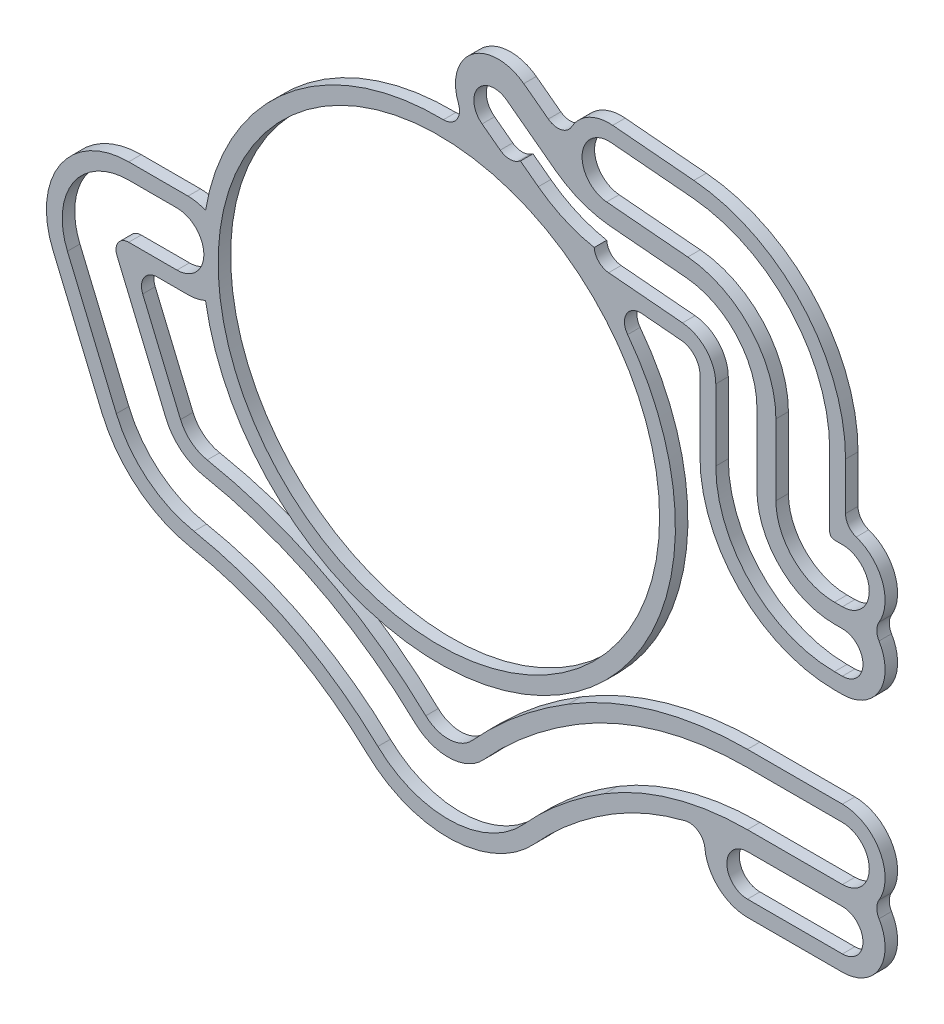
ISO-10303-21;
HEADER;
FILE_DESCRIPTION(('STEP AP214'),'2;1');
FILE_NAME('part.step','',(''),(''),'','','');
FILE_SCHEMA(('AUTOMOTIVE_DESIGN { 1 0 10303 214 1 1 1 1 }'));
ENDSEC;
DATA;
#1=APPLICATION_CONTEXT('core data for automotive mechanical design processes');
#2=APPLICATION_PROTOCOL_DEFINITION('international standard','automotive_design',2000,#1);
#3=PRODUCT_CONTEXT('',#1,'mechanical');
#4=PRODUCT('Part','Part','',(#3));
#5=PRODUCT_RELATED_PRODUCT_CATEGORY('part','',(#4));
#6=PRODUCT_DEFINITION_FORMATION('','',#4);
#7=PRODUCT_DEFINITION_CONTEXT('part definition',#1,'design');
#8=PRODUCT_DEFINITION('design','',#6,#7);
#9=PRODUCT_DEFINITION_SHAPE('','',#8);
#10=(LENGTH_UNIT() NAMED_UNIT(*) SI_UNIT(.MILLI.,.METRE.));
#11=(NAMED_UNIT(*) PLANE_ANGLE_UNIT() SI_UNIT($,.RADIAN.));
#12=(NAMED_UNIT(*) SI_UNIT($,.STERADIAN.) SOLID_ANGLE_UNIT());
#13=UNCERTAINTY_MEASURE_WITH_UNIT(LENGTH_MEASURE(1.E-05),#10,'distance_accuracy_value','');
#14=(GEOMETRIC_REPRESENTATION_CONTEXT(3) GLOBAL_UNCERTAINTY_ASSIGNED_CONTEXT((#13)) GLOBAL_UNIT_ASSIGNED_CONTEXT((#10,
#11,#12)) REPRESENTATION_CONTEXT('',''));
#15=CARTESIAN_POINT('',(0.,0.,0.));
#16=DIRECTION('',(0.,0.,1.));
#17=DIRECTION('',(1.,0.,0.));
#18=AXIS2_PLACEMENT_3D('',#15,#16,#17);
#19=CARTESIAN_POINT('',(57.2,-68.9,-1.79));
#20=DIRECTION('',(0.,0.,-1.));
#21=DIRECTION('',(-1.,0.,0.));
#22=AXIS2_PLACEMENT_3D('',#19,#20,#21);
#23=PLANE('',#22);
#24=DIRECTION('',(-1.,0.,0.));
#25=VECTOR('',#24,1.);
#26=CARTESIAN_POINT('',(13.9499999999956,-76.7,-1.79));
#27=LINE('',#26,#25);
#28=CARTESIAN_POINT('',(13.9499999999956,-76.7,-1.79));
#29=VERTEX_POINT('',#28);
#30=CARTESIAN_POINT('',(10.8999999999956,-76.7,-1.79));
#31=VERTEX_POINT('',#30);
#32=EDGE_CURVE('E931',#29,#31,#27,.T.);
#33=ORIENTED_EDGE('',*,*,#32,.F.);
#34=CARTESIAN_POINT('',(13.9499999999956,-75.,-1.79));
#35=DIRECTION('',(0.,0.,-1.));
#36=DIRECTION('',(-1.,0.,0.));
#37=AXIS2_PLACEMENT_3D('',#34,#35,#36);
#38=CIRCLE('',#37,1.69999999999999);
#39=CARTESIAN_POINT('',(13.9499999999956,-73.3,-1.79));
#40=VERTEX_POINT('',#39);
#41=EDGE_CURVE('E929',#40,#29,#38,.T.);
#42=ORIENTED_EDGE('',*,*,#41,.F.);
#43=DIRECTION('',(1.,0.,0.));
#44=VECTOR('',#43,1.);
#45=CARTESIAN_POINT('',(10.8999999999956,-73.3,-1.79));
#46=LINE('',#45,#44);
#47=CARTESIAN_POINT('',(10.8999999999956,-73.3,-1.79));
#48=VERTEX_POINT('',#47);
#49=EDGE_CURVE('E969',#48,#40,#46,.T.);
#50=ORIENTED_EDGE('',*,*,#49,.F.);
#51=CARTESIAN_POINT('',(10.8999999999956,-77.5,-1.79));
#52=DIRECTION('',(0.,0.,-1.));
#53=DIRECTION('',(-1.,0.,0.));
#54=AXIS2_PLACEMENT_3D('',#51,#52,#53);
#55=CIRCLE('',#54,4.2);
#56=CARTESIAN_POINT('',(7.028741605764,-79.1289132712,-1.79));
#57=VERTEX_POINT('',#56);
#58=EDGE_CURVE('E966',#57,#48,#55,.T.);
#59=ORIENTED_EDGE('',*,*,#58,.F.);
#60=DIRECTION('',(-0.387836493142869,0.921728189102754,0.));
#61=VECTOR('',#60,1.);
#62=CARTESIAN_POINT('',(10.1196155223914,-86.4746521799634,-1.79));
#63=LINE('',#62,#61);
#64=CARTESIAN_POINT('',(10.1196155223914,-86.4746521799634,-1.79));
#65=VERTEX_POINT('',#64);
#66=EDGE_CURVE('E964',#65,#57,#63,.T.);
#67=ORIENTED_EDGE('',*,*,#66,.F.);
#68=CARTESIAN_POINT('',(16.2951943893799,-83.8761476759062,-1.79));
#69=DIRECTION('',(0.,0.,-1.));
#70=DIRECTION('',(-1.,0.,0.));
#71=AXIS2_PLACEMENT_3D('',#68,#69,#70);
#72=CIRCLE('',#71,6.70000000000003);
#73=CARTESIAN_POINT('',(15.0281828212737,-90.4552571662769,-1.79));
#74=VERTEX_POINT('',#73);
#75=EDGE_CURVE('E962',#74,#65,#72,.T.);
#76=ORIENTED_EDGE('',*,*,#75,.F.);
#77=CARTESIAN_POINT('',(10.6220082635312,-113.334846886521,-1.79));
#78=DIRECTION('',(0.,0.,1.));
#79=DIRECTION('',(-1.,0.,0.));
#80=AXIS2_PLACEMENT_3D('',#77,#78,#79);
#81=CIRCLE('',#80,23.3);
#82=CARTESIAN_POINT('',(26.6481463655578,-96.4217484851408,-1.79));
#83=VERTEX_POINT('',#82);
#84=EDGE_CURVE('E960',#83,#74,#81,.T.);
#85=ORIENTED_EDGE('',*,*,#84,.F.);
#86=CARTESIAN_POINT('',(31.0845665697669,-91.7397963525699,-1.79));
#87=DIRECTION('',(0.,0.,-1.));
#88=DIRECTION('',(-1.,0.,0.));
#89=AXIS2_PLACEMENT_3D('',#86,#87,#88);
#90=CIRCLE('',#89,6.44999999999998);
#91=CARTESIAN_POINT('',(35.8630291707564,-96.0720931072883,-1.79));
#92=VERTEX_POINT('',#91);
#93=EDGE_CURVE('E958',#92,#83,#90,.T.);
#94=ORIENTED_EDGE('',*,*,#93,.F.);
#95=CARTESIAN_POINT('',(53.1247622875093,-111.722095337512,-1.79));
#96=DIRECTION('',(0.,0.,1.));
#97=DIRECTION('',(-1.,0.,0.));
#98=AXIS2_PLACEMENT_3D('',#95,#96,#97);
#99=CIRCLE('',#98,23.3);
#100=CARTESIAN_POINT('',(40.9902687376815,-91.8312917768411,-1.79));
#101=VERTEX_POINT('',#100);
#102=EDGE_CURVE('E956',#101,#92,#99,.T.);
#103=ORIENTED_EDGE('',*,*,#102,.F.);
#104=CARTESIAN_POINT('',(50.,-106.6,-1.79));
#105=DIRECTION('',(0.,0.,1.));
#106=DIRECTION('',(-1.,0.,0.));
#107=AXIS2_PLACEMENT_3D('',#104,#105,#106);
#108=CIRCLE('',#107,17.3);
#109=CARTESIAN_POINT('',(50.,-89.3,-1.79));
#110=VERTEX_POINT('',#109);
#111=EDGE_CURVE('E954',#110,#101,#108,.T.);
#112=ORIENTED_EDGE('',*,*,#111,.F.);
#113=DIRECTION('',(-1.,0.,0.));
#114=VECTOR('',#113,1.);
#115=CARTESIAN_POINT('',(56.,-89.3,-1.79));
#116=LINE('',#115,#114);
#117=CARTESIAN_POINT('',(56.,-89.3,-1.79));
#118=VERTEX_POINT('',#117);
#119=EDGE_CURVE('E952',#118,#110,#116,.T.);
#120=ORIENTED_EDGE('',*,*,#119,.F.);
#121=CARTESIAN_POINT('',(56.,-87.6,-1.79));
#122=DIRECTION('',(0.,0.,-1.));
#123=DIRECTION('',(-1.,0.,0.));
#124=AXIS2_PLACEMENT_3D('',#121,#122,#123);
#125=CIRCLE('',#124,1.69999999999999);
#126=CARTESIAN_POINT('',(56.,-85.9,-1.79));
#127=VERTEX_POINT('',#126);
#128=EDGE_CURVE('E950',#127,#118,#125,.T.);
#129=ORIENTED_EDGE('',*,*,#128,.F.);
#130=DIRECTION('',(1.,0.,0.));
#131=VECTOR('',#130,1.);
#132=CARTESIAN_POINT('',(50.,-85.9,-1.79));
#133=LINE('',#132,#131);
#134=CARTESIAN_POINT('',(50.,-85.9,-1.79));
#135=VERTEX_POINT('',#134);
#136=EDGE_CURVE('E948',#135,#127,#133,.T.);
#137=ORIENTED_EDGE('',*,*,#136,.F.);
#138=CARTESIAN_POINT('',(50.,-106.6,-1.79));
#139=DIRECTION('',(0.,0.,-1.));
#140=DIRECTION('',(-1.,0.,0.));
#141=AXIS2_PLACEMENT_3D('',#138,#139,#140);
#142=CIRCLE('',#141,20.7);
#143=CARTESIAN_POINT('',(39.2195701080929,-88.9287710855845,-1.79));
#144=VERTEX_POINT('',#143);
#145=EDGE_CURVE('E946',#144,#135,#142,.T.);
#146=ORIENTED_EDGE('',*,*,#145,.F.);
#147=CARTESIAN_POINT('',(53.1247622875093,-111.722095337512,-1.79));
#148=DIRECTION('',(0.,0.,-1.));
#149=DIRECTION('',(-1.,0.,0.));
#150=AXIS2_PLACEMENT_3D('',#147,#148,#149);
#151=CIRCLE('',#150,26.7);
#152=CARTESIAN_POINT('',(33.3441496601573,-93.7884017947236,-1.79));
#153=VERTEX_POINT('',#152);
#154=EDGE_CURVE('E944',#153,#144,#151,.T.);
#155=ORIENTED_EDGE('',*,*,#154,.F.);
#156=CARTESIAN_POINT('',(31.0845665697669,-91.7397963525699,-1.79));
#157=DIRECTION('',(0.,0.,1.));
#158=DIRECTION('',(-1.,0.,0.));
#159=AXIS2_PLACEMENT_3D('',#156,#157,#158);
#160=CIRCLE('',#159,3.04999999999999);
#161=CARTESIAN_POINT('',(28.986724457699,-93.9537427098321,-1.79));
#162=VERTEX_POINT('',#161);
#163=EDGE_CURVE('E942',#162,#153,#160,.T.);
#164=ORIENTED_EDGE('',*,*,#163,.F.);
#165=CARTESIAN_POINT('',(10.6220082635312,-113.334846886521,-1.79));
#166=DIRECTION('',(0.,0.,-1.));
#167=DIRECTION('',(-1.,0.,0.));
#168=AXIS2_PLACEMENT_3D('',#165,#166,#167);
#169=CIRCLE('',#168,26.7);
#170=CARTESIAN_POINT('',(15.6711439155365,-87.1166045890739,-1.79));
#171=VERTEX_POINT('',#170);
#172=EDGE_CURVE('E940',#171,#162,#169,.T.);
#173=ORIENTED_EDGE('',*,*,#172,.F.);
#174=CARTESIAN_POINT('',(16.2951943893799,-83.8761476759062,-1.79));
#175=DIRECTION('',(0.,0.,1.));
#176=DIRECTION('',(-1.,0.,0.));
#177=AXIS2_PLACEMENT_3D('',#174,#175,#176);
#178=CIRCLE('',#177,3.30000000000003);
#179=CARTESIAN_POINT('',(13.2534913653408,-85.1560081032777,-1.79));
#180=VERTEX_POINT('',#179);
#181=EDGE_CURVE('E938',#180,#171,#178,.T.);
#182=ORIENTED_EDGE('',*,*,#181,.F.);
#183=DIRECTION('',(0.387836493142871,-0.921728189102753,0.));
#184=VECTOR('',#183,1.);
#185=CARTESIAN_POINT('',(10.1626174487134,-77.8102691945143,-1.79));
#186=LINE('',#185,#184);
#187=CARTESIAN_POINT('',(10.1626174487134,-77.8102691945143,-1.79));
#188=VERTEX_POINT('',#187);
#189=EDGE_CURVE('E936',#188,#180,#186,.T.);
#190=ORIENTED_EDGE('',*,*,#189,.F.);
#191=CARTESIAN_POINT('',(10.8999999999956,-77.5,-1.79));
#192=DIRECTION('',(0.,0.,1.));
#193=DIRECTION('',(-1.,0.,0.));
#194=AXIS2_PLACEMENT_3D('',#191,#192,#193);
#195=CIRCLE('',#194,0.800000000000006);
#196=EDGE_CURVE('E934',#31,#188,#195,.T.);
#197=ORIENTED_EDGE('',*,*,#196,.F.);
#198=EDGE_LOOP('',(#33,#42,#50,#59,#67,#76,#85,#94,#103,#112,#120,#129,#137,#146,#155,#164,#173,
#182,#190,#197));
#199=FACE_BOUND('',#198,.T.);
#200=CARTESIAN_POINT('',(57.2,-68.9,-1.79));
#201=DIRECTION('',(0.,0.,1.));
#202=DIRECTION('',(-1.,0.,0.));
#203=AXIS2_PLACEMENT_3D('',#200,#201,#202);
#204=CIRCLE('',#203,1.);
#205=CARTESIAN_POINT('',(56.2,-68.9,-1.79));
#206=VERTEX_POINT('',#205);
#207=CARTESIAN_POINT('',(56.8756756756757,-69.845945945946,-1.79));
#208=VERTEX_POINT('',#207);
#209=EDGE_CURVE('E1072',#206,#208,#204,.T.);
#210=ORIENTED_EDGE('',*,*,#209,.T.);
#211=CARTESIAN_POINT('',(56.,-72.4,-1.79));
#212=DIRECTION('',(0.,0.,-1.));
#213=DIRECTION('',(-1.,0.,0.));
#214=AXIS2_PLACEMENT_3D('',#211,#212,#213);
#215=CIRCLE('',#214,2.7);
#216=CARTESIAN_POINT('',(58.3168200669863,-73.7864864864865,-1.79));
#217=VERTEX_POINT('',#216);
#218=EDGE_CURVE('E1075',#208,#217,#215,.T.);
#219=ORIENTED_EDGE('',*,*,#218,.T.);
#220=CARTESIAN_POINT('',(59.1749015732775,-74.3,-1.79));
#221=DIRECTION('',(0.,0.,1.));
#222=DIRECTION('',(-1.,0.,0.));
#223=AXIS2_PLACEMENT_3D('',#220,#221,#222);
#224=CIRCLE('',#223,1.);
#225=CARTESIAN_POINT('',(58.3168200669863,-74.8135135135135,-1.79));
#226=VERTEX_POINT('',#225);
#227=EDGE_CURVE('E1078',#217,#226,#224,.T.);
#228=ORIENTED_EDGE('',*,*,#227,.T.);
#229=CARTESIAN_POINT('',(56.,-76.2,-1.79));
#230=DIRECTION('',(0.,0.,-1.));
#231=DIRECTION('',(-1.,0.,0.));
#232=AXIS2_PLACEMENT_3D('',#229,#230,#231);
#233=CIRCLE('',#232,2.69999999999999);
#234=CARTESIAN_POINT('',(56.,-78.9,-1.79));
#235=VERTEX_POINT('',#234);
#236=EDGE_CURVE('E1080',#226,#235,#233,.T.);
#237=ORIENTED_EDGE('',*,*,#236,.T.);
#238=DIRECTION('',(-1.,0.,0.));
#239=VECTOR('',#238,1.);
#240=CARTESIAN_POINT('',(56.,-78.9,-1.79));
#241=LINE('',#240,#239);
#242=CARTESIAN_POINT('',(55.5,-78.9,-1.79));
#243=VERTEX_POINT('',#242);
#244=EDGE_CURVE('E1082',#235,#243,#241,.T.);
#245=ORIENTED_EDGE('',*,*,#244,.T.);
#246=CARTESIAN_POINT('',(55.5,-70.4,-1.79));
#247=DIRECTION('',(0.,0.,-1.));
#248=DIRECTION('',(-1.,0.,0.));
#249=AXIS2_PLACEMENT_3D('',#246,#247,#248);
#250=CIRCLE('',#249,8.5);
#251=CARTESIAN_POINT('',(47.,-70.4,-1.79));
#252=VERTEX_POINT('',#251);
#253=EDGE_CURVE('E1084',#243,#252,#250,.T.);
#254=ORIENTED_EDGE('',*,*,#253,.T.);
#255=DIRECTION('',(0.,1.,0.));
#256=VECTOR('',#255,1.);
#257=CARTESIAN_POINT('',(47.,-70.4,-1.79));
#258=LINE('',#257,#256);
#259=CARTESIAN_POINT('',(47.,-65.9046039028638,-1.79));
#260=VERTEX_POINT('',#259);
#261=EDGE_CURVE('E1086',#252,#260,#258,.T.);
#262=ORIENTED_EDGE('',*,*,#261,.T.);
#263=CARTESIAN_POINT('',(45.7,-65.9046039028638,-1.79));
#264=DIRECTION('',(0.,0.,1.));
#265=DIRECTION('',(-1.,0.,0.));
#266=AXIS2_PLACEMENT_3D('',#263,#264,#265);
#267=CIRCLE('',#266,1.29999999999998);
#268=CARTESIAN_POINT('',(45.813302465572,-64.6095507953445,-1.79));
#269=VERTEX_POINT('',#268);
#270=EDGE_CURVE('E1088',#260,#269,#267,.T.);
#271=ORIENTED_EDGE('',*,*,#270,.T.);
#272=DIRECTION('',(-0.996194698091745,0.087155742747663,0.));
#273=VECTOR('',#272,1.);
#274=CARTESIAN_POINT('',(45.813302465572,-64.6095507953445,-1.79));
#275=LINE('',#274,#273);
#276=CARTESIAN_POINT('',(43.314916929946,-64.3909703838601,-1.79));
#277=VERTEX_POINT('',#276);
#278=EDGE_CURVE('E1090',#269,#277,#275,.T.);
#279=ORIENTED_EDGE('',*,*,#278,.T.);
#280=CARTESIAN_POINT('',(43.2277611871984,-65.3871650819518,-1.79));
#281=DIRECTION('',(0.,0.,1.));
#282=DIRECTION('',(-1.,0.,0.));
#283=AXIS2_PLACEMENT_3D('',#280,#281,#282);
#284=CIRCLE('',#283,0.999999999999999);
#285=CARTESIAN_POINT('',(42.4297824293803,-65.9898506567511,-1.79));
#286=VERTEX_POINT('',#285);
#287=EDGE_CURVE('E1092',#277,#286,#284,.T.);
#288=ORIENTED_EDGE('',*,*,#287,.T.);
#289=CARTESIAN_POINT('',(30.5,-75.,-1.79));
#290=DIRECTION('',(0.,0.,-1.));
#291=DIRECTION('',(-1.,0.,0.));
#292=AXIS2_PLACEMENT_3D('',#289,#290,#291);
#293=CIRCLE('',#292,14.95);
#294=CARTESIAN_POINT('',(15.7544164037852,-77.4637906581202,-1.79));
#295=VERTEX_POINT('',#294);
#296=EDGE_CURVE('E1094',#286,#295,#293,.T.);
#297=ORIENTED_EDGE('',*,*,#296,.T.);
#298=CARTESIAN_POINT('',(14.6499999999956,-75.,-1.79));
#299=DIRECTION('',(0.,0.,-1.));
#300=DIRECTION('',(-1.,0.,0.));
#301=AXIS2_PLACEMENT_3D('',#298,#299,#300);
#302=CIRCLE('',#301,2.69999999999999);
#303=CARTESIAN_POINT('',(14.6499999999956,-77.7,-1.79));
#304=VERTEX_POINT('',#303);
#305=EDGE_CURVE('E1096',#295,#304,#302,.T.);
#306=ORIENTED_EDGE('',*,*,#305,.T.);
#307=DIRECTION('',(-1.,0.,0.));
#308=VECTOR('',#307,1.);
#309=CARTESIAN_POINT('',(14.6499999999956,-77.7,-1.79));
#310=LINE('',#309,#308);
#311=CARTESIAN_POINT('',(12.7068274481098,-77.7,-1.79));
#312=VERTEX_POINT('',#311);
#313=EDGE_CURVE('E1098',#304,#312,#310,.T.);
#314=ORIENTED_EDGE('',*,*,#313,.T.);
#315=CARTESIAN_POINT('',(12.7068274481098,-78.7,-1.79));
#316=DIRECTION('',(0.,0.,1.));
#317=DIRECTION('',(-1.,0.,0.));
#318=AXIS2_PLACEMENT_3D('',#315,#316,#317);
#319=CIRCLE('',#318,1.);
#320=CARTESIAN_POINT('',(11.785099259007,-79.0878364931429,-1.79));
#321=VERTEX_POINT('',#320);
#322=EDGE_CURVE('E1100',#312,#321,#319,.T.);
#323=ORIENTED_EDGE('',*,*,#322,.T.);
#324=DIRECTION('',(0.387836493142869,-0.921728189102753,0.));
#325=VECTOR('',#324,1.);
#326=CARTESIAN_POINT('',(11.785099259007,-79.0878364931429,-1.79));
#327=LINE('',#326,#325);
#328=CARTESIAN_POINT('',(14.1752195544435,-84.7681716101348,-1.79));
#329=VERTEX_POINT('',#328);
#330=EDGE_CURVE('E1102',#321,#329,#327,.T.);
#331=ORIENTED_EDGE('',*,*,#330,.T.);
#332=CARTESIAN_POINT('',(16.2951943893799,-83.8761476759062,-1.79));
#333=DIRECTION('',(0.,0.,1.));
#334=DIRECTION('',(-1.,0.,0.));
#335=AXIS2_PLACEMENT_3D('',#332,#333,#334);
#336=CIRCLE('',#335,2.30000000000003);
#337=CARTESIAN_POINT('',(15.8602501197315,-86.13464794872,-1.79));
#338=VERTEX_POINT('',#337);
#339=EDGE_CURVE('E1104',#329,#338,#336,.T.);
#340=ORIENTED_EDGE('',*,*,#339,.T.);
#341=CARTESIAN_POINT('',(10.6220082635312,-113.334846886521,-1.79));
#342=DIRECTION('',(0.,0.,-1.));
#343=DIRECTION('',(-1.,0.,0.));
#344=AXIS2_PLACEMENT_3D('',#341,#342,#343);
#345=CIRCLE('',#344,27.7);
#346=CARTESIAN_POINT('',(29.6745415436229,-93.2278586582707,-1.79));
#347=VERTEX_POINT('',#346);
#348=EDGE_CURVE('E1106',#338,#347,#345,.T.);
#349=ORIENTED_EDGE('',*,*,#348,.T.);
#350=CARTESIAN_POINT('',(31.0845665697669,-91.7397963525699,-1.79));
#351=DIRECTION('',(0.,0.,1.));
#352=DIRECTION('',(-1.,0.,0.));
#353=AXIS2_PLACEMENT_3D('',#350,#351,#352);
#354=CIRCLE('',#353,2.04999999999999);
#355=CARTESIAN_POINT('',(32.6033027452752,-93.1167278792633,-1.79));
#356=VERTEX_POINT('',#355);
#357=EDGE_CURVE('E1108',#347,#356,#354,.T.);
#358=ORIENTED_EDGE('',*,*,#357,.T.);
#359=CARTESIAN_POINT('',(53.1247622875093,-111.722095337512,-1.79));
#360=DIRECTION('',(0.,0.,-1.));
#361=DIRECTION('',(-1.,0.,0.));
#362=AXIS2_PLACEMENT_3D('',#359,#360,#361);
#363=CIRCLE('',#362,27.7);
#364=CARTESIAN_POINT('',(38.698776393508,-88.0750885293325,-1.79));
#365=VERTEX_POINT('',#364);
#366=EDGE_CURVE('E1110',#356,#365,#363,.T.);
#367=ORIENTED_EDGE('',*,*,#366,.T.);
#368=CARTESIAN_POINT('',(50.,-106.6,-1.79));
#369=DIRECTION('',(0.,0.,-1.));
#370=DIRECTION('',(-1.,0.,0.));
#371=AXIS2_PLACEMENT_3D('',#368,#369,#370);
#372=CIRCLE('',#371,21.7);
#373=CARTESIAN_POINT('',(50.,-84.9,-1.79));
#374=VERTEX_POINT('',#373);
#375=EDGE_CURVE('E1112',#365,#374,#372,.T.);
#376=ORIENTED_EDGE('',*,*,#375,.T.);
#377=DIRECTION('',(1.,0.,0.));
#378=VECTOR('',#377,1.);
#379=CARTESIAN_POINT('',(50.,-84.9,-1.79));
#380=LINE('',#379,#378);
#381=CARTESIAN_POINT('',(56.,-84.9,-1.79));
#382=VERTEX_POINT('',#381);
#383=EDGE_CURVE('E1114',#374,#382,#380,.T.);
#384=ORIENTED_EDGE('',*,*,#383,.T.);
#385=CARTESIAN_POINT('',(56.,-87.6,-1.79));
#386=DIRECTION('',(0.,0.,-1.));
#387=DIRECTION('',(-1.,0.,0.));
#388=AXIS2_PLACEMENT_3D('',#385,#386,#387);
#389=CIRCLE('',#388,2.7);
#390=CARTESIAN_POINT('',(58.3168200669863,-88.9864864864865,-1.79));
#391=VERTEX_POINT('',#390);
#392=EDGE_CURVE('E1116',#382,#391,#389,.T.);
#393=ORIENTED_EDGE('',*,*,#392,.T.);
#394=CARTESIAN_POINT('',(59.1749015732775,-89.5,-1.79));
#395=DIRECTION('',(0.,0.,1.));
#396=DIRECTION('',(-1.,0.,0.));
#397=AXIS2_PLACEMENT_3D('',#394,#395,#396);
#398=CIRCLE('',#397,1.);
#399=CARTESIAN_POINT('',(58.3168200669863,-90.0135135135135,-1.79));
#400=VERTEX_POINT('',#399);
#401=EDGE_CURVE('E1118',#391,#400,#398,.T.);
#402=ORIENTED_EDGE('',*,*,#401,.T.);
#403=CARTESIAN_POINT('',(56.,-91.4,-1.79));
#404=DIRECTION('',(0.,0.,-1.));
#405=DIRECTION('',(-1.,0.,0.));
#406=AXIS2_PLACEMENT_3D('',#403,#404,#405);
#407=CIRCLE('',#406,2.69999999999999);
#408=CARTESIAN_POINT('',(56.,-94.1,-1.79));
#409=VERTEX_POINT('',#408);
#410=EDGE_CURVE('E1120',#400,#409,#407,.T.);
#411=ORIENTED_EDGE('',*,*,#410,.T.);
#412=DIRECTION('',(-1.,0.,0.));
#413=VECTOR('',#412,1.);
#414=CARTESIAN_POINT('',(56.,-94.1,-1.79));
#415=LINE('',#414,#413);
#416=CARTESIAN_POINT('',(50.,-94.1,-1.79));
#417=VERTEX_POINT('',#416);
#418=EDGE_CURVE('E1122',#409,#417,#415,.T.);
#419=ORIENTED_EDGE('',*,*,#418,.T.);
#420=CARTESIAN_POINT('',(50.,-91.4,-1.79));
#421=DIRECTION('',(0.,0.,-1.));
#422=DIRECTION('',(-1.,0.,0.));
#423=AXIS2_PLACEMENT_3D('',#420,#421,#422);
#424=CIRCLE('',#423,2.69999999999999);
#425=CARTESIAN_POINT('',(47.3121071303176,-91.6554054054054,-1.79));
#426=VERTEX_POINT('',#425);
#427=EDGE_CURVE('E1124',#417,#426,#424,.T.);
#428=ORIENTED_EDGE('',*,*,#427,.T.);
#429=CARTESIAN_POINT('',(46.3165912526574,-91.75,-1.79));
#430=DIRECTION('',(0.,0.,1.));
#431=DIRECTION('',(-1.,0.,0.));
#432=AXIS2_PLACEMENT_3D('',#429,#430,#431);
#433=CIRCLE('',#432,0.999999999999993);
#434=CARTESIAN_POINT('',(46.0758455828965,-90.7794117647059,-1.79));
#435=VERTEX_POINT('',#434);
#436=EDGE_CURVE('E1126',#426,#435,#433,.T.);
#437=ORIENTED_EDGE('',*,*,#436,.T.);
#438=CARTESIAN_POINT('',(50.,-106.6,-1.79));
#439=DIRECTION('',(0.,0.,1.));
#440=DIRECTION('',(-1.,0.,0.));
#441=AXIS2_PLACEMENT_3D('',#438,#439,#440);
#442=CIRCLE('',#441,16.3);
#443=CARTESIAN_POINT('',(41.5110624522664,-92.6849743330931,-1.79));
#444=VERTEX_POINT('',#443);
#445=EDGE_CURVE('E1128',#435,#444,#442,.T.);
#446=ORIENTED_EDGE('',*,*,#445,.T.);
#447=CARTESIAN_POINT('',(53.1247622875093,-111.722095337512,-1.79));
#448=DIRECTION('',(0.,0.,1.));
#449=DIRECTION('',(-1.,0.,0.));
#450=AXIS2_PLACEMENT_3D('',#447,#448,#449);
#451=CIRCLE('',#450,22.3);
#452=CARTESIAN_POINT('',(36.6038760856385,-96.7437670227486,-1.79));
#453=VERTEX_POINT('',#452);
#454=EDGE_CURVE('E1130',#444,#453,#451,.T.);
#455=ORIENTED_EDGE('',*,*,#454,.T.);
#456=CARTESIAN_POINT('',(31.0845665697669,-91.7397963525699,-1.79));
#457=DIRECTION('',(0.,0.,-1.));
#458=DIRECTION('',(-1.,0.,0.));
#459=AXIS2_PLACEMENT_3D('',#456,#457,#458);
#460=CIRCLE('',#459,7.44999999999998);
#461=CARTESIAN_POINT('',(25.9603292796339,-97.1476325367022,-1.79));
#462=VERTEX_POINT('',#461);
#463=EDGE_CURVE('E1132',#453,#462,#460,.T.);
#464=ORIENTED_EDGE('',*,*,#463,.T.);
#465=CARTESIAN_POINT('',(10.6220082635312,-113.334846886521,-1.79));
#466=DIRECTION('',(0.,0.,1.));
#467=DIRECTION('',(-1.,0.,0.));
#468=AXIS2_PLACEMENT_3D('',#465,#466,#467);
#469=CIRCLE('',#468,22.3);
#470=CARTESIAN_POINT('',(14.8390766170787,-91.4372138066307,-1.79));
#471=VERTEX_POINT('',#470);
#472=EDGE_CURVE('E1134',#462,#471,#469,.T.);
#473=ORIENTED_EDGE('',*,*,#472,.T.);
#474=CARTESIAN_POINT('',(16.2951943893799,-83.8761476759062,-1.79));
#475=DIRECTION('',(0.,0.,-1.));
#476=DIRECTION('',(-1.,0.,0.));
#477=AXIS2_PLACEMENT_3D('',#474,#475,#476);
#478=CIRCLE('',#477,7.70000000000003);
#479=CARTESIAN_POINT('',(9.19788733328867,-86.8624886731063,-1.79));
#480=VERTEX_POINT('',#479);
#481=EDGE_CURVE('E1136',#471,#480,#478,.T.);
#482=ORIENTED_EDGE('',*,*,#481,.T.);
#483=DIRECTION('',(-0.38783649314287,0.921728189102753,0.));
#484=VECTOR('',#483,1.);
#485=CARTESIAN_POINT('',(9.19788733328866,-86.8624886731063,-1.79));
#486=LINE('',#485,#484);
#487=CARTESIAN_POINT('',(6.10701341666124,-79.5167497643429,-1.79));
#488=VERTEX_POINT('',#487);
#489=EDGE_CURVE('E1138',#480,#488,#486,.T.);
#490=ORIENTED_EDGE('',*,*,#489,.T.);
#491=CARTESIAN_POINT('',(10.8999999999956,-77.5,-1.79));
#492=DIRECTION('',(0.,0.,-1.));
#493=DIRECTION('',(-1.,0.,0.));
#494=AXIS2_PLACEMENT_3D('',#491,#492,#493);
#495=CIRCLE('',#494,5.2);
#496=CARTESIAN_POINT('',(10.8999999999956,-72.3,-1.79));
#497=VERTEX_POINT('',#496);
#498=EDGE_CURVE('E1140',#488,#497,#495,.T.);
#499=ORIENTED_EDGE('',*,*,#498,.T.);
#500=DIRECTION('',(1.,0.,0.));
#501=VECTOR('',#500,1.);
#502=CARTESIAN_POINT('',(10.8999999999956,-72.3,-1.79));
#503=LINE('',#502,#501);
#504=CARTESIAN_POINT('',(14.6499999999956,-72.3,-1.79));
#505=VERTEX_POINT('',#504);
#506=EDGE_CURVE('E1142',#497,#505,#503,.T.);
#507=ORIENTED_EDGE('',*,*,#506,.T.);
#508=CARTESIAN_POINT('',(14.6499999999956,-75.,-1.79));
#509=DIRECTION('',(0.,0.,-1.));
#510=DIRECTION('',(-1.,0.,0.));
#511=AXIS2_PLACEMENT_3D('',#508,#509,#510);
#512=CIRCLE('',#511,2.7);
#513=CARTESIAN_POINT('',(15.7544164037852,-72.5362093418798,-1.79));
#514=VERTEX_POINT('',#513);
#515=EDGE_CURVE('E1144',#505,#514,#512,.T.);
#516=ORIENTED_EDGE('',*,*,#515,.T.);
#517=CARTESIAN_POINT('',(30.5,-75.,-1.79));
#518=DIRECTION('',(0.,0.,-1.));
#519=DIRECTION('',(-1.,0.,0.));
#520=AXIS2_PLACEMENT_3D('',#517,#518,#519);
#521=CIRCLE('',#520,14.95);
#522=CARTESIAN_POINT('',(30.7870304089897,-60.0527556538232,-1.79));
#523=VERTEX_POINT('',#522);
#524=EDGE_CURVE('E1146',#514,#523,#521,.T.);
#525=ORIENTED_EDGE('',*,*,#524,.T.);
#526=CARTESIAN_POINT('',(30.8062297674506,-59.0529399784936,-1.79));
#527=DIRECTION('',(0.,0.,1.));
#528=DIRECTION('',(-1.,0.,0.));
#529=AXIS2_PLACEMENT_3D('',#526,#527,#528);
#530=CIRCLE('',#529,1.);
#531=CARTESIAN_POINT('',(31.7369784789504,-58.6872805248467,-1.79));
#532=VERTEX_POINT('',#531);
#533=EDGE_CURVE('E1148',#523,#532,#530,.T.);
#534=ORIENTED_EDGE('',*,*,#533,.T.);
#535=CARTESIAN_POINT('',(34.25,-57.7,-1.79));
#536=DIRECTION('',(0.,0.,-1.));
#537=DIRECTION('',(-1.,0.,0.));
#538=AXIS2_PLACEMENT_3D('',#535,#536,#537);
#539=CIRCLE('',#538,2.7);
#540=CARTESIAN_POINT('',(35.8677509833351,-55.5383150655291,-1.79));
#541=VERTEX_POINT('',#540);
#542=EDGE_CURVE('E1150',#532,#541,#539,.T.);
#543=ORIENTED_EDGE('',*,*,#542,.T.);
#544=DIRECTION('',(0.800624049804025,-0.599167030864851,0.));
#545=VECTOR('',#544,1.);
#546=CARTESIAN_POINT('',(35.8677509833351,-55.5383150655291,-1.79));
#547=LINE('',#546,#545);
#548=CARTESIAN_POINT('',(37.4189739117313,-56.6992115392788,-1.79));
#549=VERTEX_POINT('',#548);
#550=EDGE_CURVE('E1152',#541,#549,#547,.T.);
#551=ORIENTED_EDGE('',*,*,#550,.T.);
#552=CARTESIAN_POINT('',(38.0181409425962,-55.8985874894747,-1.79));
#553=DIRECTION('',(0.,0.,1.));
#554=DIRECTION('',(-1.,0.,0.));
#555=AXIS2_PLACEMENT_3D('',#552,#553,#554);
#556=CIRCLE('',#555,1.00000000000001);
#557=CARTESIAN_POINT('',(38.8916163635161,-56.3854557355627,-1.79));
#558=VERTEX_POINT('',#557);
#559=EDGE_CURVE('E1154',#549,#558,#556,.T.);
#560=ORIENTED_EDGE('',*,*,#559,.T.);
#561=CARTESIAN_POINT('',(41.25,-57.7,-1.79));
#562=DIRECTION('',(0.,0.,-1.));
#563=DIRECTION('',(-1.,0.,0.));
#564=AXIS2_PLACEMENT_3D('',#561,#562,#563);
#565=CIRCLE('',#564,2.7);
#566=CARTESIAN_POINT('',(41.4853205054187,-55.0102743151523,-1.79));
#567=VERTEX_POINT('',#566);
#568=EDGE_CURVE('E1156',#558,#567,#565,.T.);
#569=ORIENTED_EDGE('',*,*,#568,.T.);
#570=DIRECTION('',(0.996194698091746,-0.0871557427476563,0.));
#571=VECTOR('',#570,1.);
#572=CARTESIAN_POINT('',(41.4853205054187,-55.0102743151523,-1.79));
#573=LINE('',#572,#571);
#574=CARTESIAN_POINT('',(46.6151352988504,-55.4590749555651,-1.79));
#575=VERTEX_POINT('',#574);
#576=EDGE_CURVE('E1158',#567,#575,#573,.T.);
#577=ORIENTED_EDGE('',*,*,#576,.T.);
#578=CARTESIAN_POINT('',(45.7,-65.9191192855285,-1.79));
#579=DIRECTION('',(0.,0.,-1.));
#580=DIRECTION('',(-1.,0.,0.));
#581=AXIS2_PLACEMENT_3D('',#578,#579,#580);
#582=CIRCLE('',#581,10.5);
#583=CARTESIAN_POINT('',(56.2,-65.9191192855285,-1.79));
#584=VERTEX_POINT('',#583);
#585=EDGE_CURVE('E1160',#575,#584,#582,.T.);
#586=ORIENTED_EDGE('',*,*,#585,.T.);
#587=DIRECTION('',(0.,-1.,0.));
#588=VECTOR('',#587,1.);
#589=CARTESIAN_POINT('',(56.2,-65.9191192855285,-1.79));
#590=LINE('',#589,#588);
#591=EDGE_CURVE('E1162',#584,#206,#590,.T.);
#592=ORIENTED_EDGE('',*,*,#591,.T.);
#593=EDGE_LOOP('',(#210,#219,#228,#237,#245,#254,#262,#271,#279,#288,#297,#306,#314,#323,#331,
#340,#349,#358,#367,#376,#384,#393,#402,#411,#419,#428,#437,#446,#455,#464,#473,#482,#490,#499,
#507,#516,#525,#534,#543,#551,#560,#569,#577,#586,#592));
#594=FACE_BOUND('',#593,.T.);
#595=CARTESIAN_POINT('',(30.5,-75.,-1.79));
#596=DIRECTION('',(0.,0.,-1.));
#597=DIRECTION('',(-1.,0.,0.));
#598=AXIS2_PLACEMENT_3D('',#595,#596,#597);
#599=CIRCLE('',#598,13.95);
#600=CARTESIAN_POINT('',(44.45,-75.,-1.79));
#601=VERTEX_POINT('',#600);
#602=EDGE_CURVE('E923',#601,#601,#599,.T.);
#603=ORIENTED_EDGE('',*,*,#602,.F.);
#604=EDGE_LOOP('',(#603));
#605=FACE_BOUND('',#604,.T.);
#606=DIRECTION('',(-1.,0.,0.));
#607=VECTOR('',#606,1.);
#608=CARTESIAN_POINT('',(56.,-93.1,-1.79));
#609=LINE('',#608,#607);
#610=CARTESIAN_POINT('',(56.,-93.1,-1.79));
#611=VERTEX_POINT('',#610);
#612=CARTESIAN_POINT('',(50.,-93.1,-1.79));
#613=VERTEX_POINT('',#612);
#614=EDGE_CURVE('E894',#611,#613,#609,.T.);
#615=ORIENTED_EDGE('',*,*,#614,.F.);
#616=CARTESIAN_POINT('',(56.,-91.8,-1.79));
#617=DIRECTION('',(0.,0.,-1.));
#618=DIRECTION('',(-1.,0.,0.));
#619=AXIS2_PLACEMENT_3D('',#616,#617,#618);
#620=CIRCLE('',#619,1.3);
#621=CARTESIAN_POINT('',(56.,-90.5,-1.79));
#622=VERTEX_POINT('',#621);
#623=EDGE_CURVE('E892',#622,#611,#620,.T.);
#624=ORIENTED_EDGE('',*,*,#623,.F.);
#625=DIRECTION('',(1.,0.,0.));
#626=VECTOR('',#625,1.);
#627=CARTESIAN_POINT('',(56.,-90.5,-1.79));
#628=LINE('',#627,#626);
#629=CARTESIAN_POINT('',(50.,-90.5,-1.79));
#630=VERTEX_POINT('',#629);
#631=EDGE_CURVE('E900',#630,#622,#628,.T.);
#632=ORIENTED_EDGE('',*,*,#631,.F.);
#633=CARTESIAN_POINT('',(50.,-91.8,-1.79));
#634=DIRECTION('',(0.,0.,-1.));
#635=DIRECTION('',(1.,0.,0.));
#636=AXIS2_PLACEMENT_3D('',#633,#634,#635);
#637=CIRCLE('',#636,1.29999999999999);
#638=EDGE_CURVE('E897',#613,#630,#637,.T.);
#639=ORIENTED_EDGE('',*,*,#638,.F.);
#640=EDGE_LOOP('',(#615,#624,#632,#639));
#641=FACE_BOUND('',#640,.T.);
#642=DIRECTION('',(-0.996194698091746,0.0871557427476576,0.));
#643=VECTOR('',#642,1.);
#644=CARTESIAN_POINT('',(46.2316500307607,-59.8423316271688,-1.79));
#645=LINE('',#644,#643);
#646=CARTESIAN_POINT('',(46.2316500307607,-59.8423316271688,-1.79));
#647=VERTEX_POINT('',#646);
#648=CARTESIAN_POINT('',(41.101835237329,-59.393530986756,-1.79));
#649=VERTEX_POINT('',#648);
#650=EDGE_CURVE('E807',#647,#649,#645,.T.);
#651=ORIENTED_EDGE('',*,*,#650,.F.);
#652=CARTESIAN_POINT('',(45.7,-65.9191192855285,-1.79));
#653=DIRECTION('',(0.,0.,1.));
#654=DIRECTION('',(-1.,0.,0.));
#655=AXIS2_PLACEMENT_3D('',#652,#653,#654);
#656=CIRCLE('',#655,6.10000000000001);
#657=CARTESIAN_POINT('',(51.8,-65.9191192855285,-1.79));
#658=VERTEX_POINT('',#657);
#659=EDGE_CURVE('E805',#658,#647,#656,.T.);
#660=ORIENTED_EDGE('',*,*,#659,.F.);
#661=DIRECTION('',(0.,1.,0.));
#662=VECTOR('',#661,1.);
#663=CARTESIAN_POINT('',(51.8,-70.4,-1.79));
#664=LINE('',#663,#662);
#665=CARTESIAN_POINT('',(51.8,-70.4,-1.79));
#666=VERTEX_POINT('',#665);
#667=EDGE_CURVE('E829',#666,#658,#664,.T.);
#668=ORIENTED_EDGE('',*,*,#667,.F.);
#669=CARTESIAN_POINT('',(55.5,-70.4,-1.79));
#670=DIRECTION('',(0.,0.,-1.));
#671=DIRECTION('',(-1.,0.,0.));
#672=AXIS2_PLACEMENT_3D('',#669,#670,#671);
#673=CIRCLE('',#672,3.7);
#674=CARTESIAN_POINT('',(55.5,-74.1,-1.79));
#675=VERTEX_POINT('',#674);
#676=EDGE_CURVE('E826',#675,#666,#673,.T.);
#677=ORIENTED_EDGE('',*,*,#676,.F.);
#678=DIRECTION('',(-1.,0.,0.));
#679=VECTOR('',#678,1.);
#680=CARTESIAN_POINT('',(56.,-74.1,-1.79));
#681=LINE('',#680,#679);
#682=CARTESIAN_POINT('',(56.,-74.1,-1.79));
#683=VERTEX_POINT('',#682);
#684=EDGE_CURVE('E824',#683,#675,#681,.T.);
#685=ORIENTED_EDGE('',*,*,#684,.F.);
#686=CARTESIAN_POINT('',(56.,-72.4,-1.79));
#687=DIRECTION('',(0.,0.,-1.));
#688=DIRECTION('',(-1.,0.,0.));
#689=AXIS2_PLACEMENT_3D('',#686,#687,#688);
#690=CIRCLE('',#689,1.69999999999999);
#691=CARTESIAN_POINT('',(56.,-70.7,-1.79));
#692=VERTEX_POINT('',#691);
#693=EDGE_CURVE('E822',#692,#683,#690,.T.);
#694=ORIENTED_EDGE('',*,*,#693,.F.);
#695=DIRECTION('',(1.,0.,0.));
#696=VECTOR('',#695,1.);
#697=CARTESIAN_POINT('',(55.5,-70.7,-1.79));
#698=LINE('',#697,#696);
#699=CARTESIAN_POINT('',(55.5,-70.7,-1.79));
#700=VERTEX_POINT('',#699);
#701=EDGE_CURVE('E820',#700,#692,#698,.T.);
#702=ORIENTED_EDGE('',*,*,#701,.F.);
#703=CARTESIAN_POINT('',(55.5,-70.4,-1.79));
#704=DIRECTION('',(0.,0.,1.));
#705=DIRECTION('',(-1.,0.,0.));
#706=AXIS2_PLACEMENT_3D('',#703,#704,#705);
#707=CIRCLE('',#706,0.300000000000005);
#708=CARTESIAN_POINT('',(55.2,-70.4,-1.79));
#709=VERTEX_POINT('',#708);
#710=EDGE_CURVE('E818',#709,#700,#707,.T.);
#711=ORIENTED_EDGE('',*,*,#710,.F.);
#712=DIRECTION('',(0.,-1.,0.));
#713=VECTOR('',#712,1.);
#714=CARTESIAN_POINT('',(55.2,-65.9191192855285,-1.79));
#715=LINE('',#714,#713);
#716=CARTESIAN_POINT('',(55.2,-65.9191192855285,-1.79));
#717=VERTEX_POINT('',#716);
#718=EDGE_CURVE('E816',#717,#709,#715,.T.);
#719=ORIENTED_EDGE('',*,*,#718,.F.);
#720=CARTESIAN_POINT('',(45.7,-65.9191192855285,-1.79));
#721=DIRECTION('',(0.,0.,-1.));
#722=DIRECTION('',(-1.,0.,0.));
#723=AXIS2_PLACEMENT_3D('',#720,#721,#722);
#724=CIRCLE('',#723,9.5);
#725=CARTESIAN_POINT('',(46.5279795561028,-56.4552696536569,-1.79));
#726=VERTEX_POINT('',#725);
#727=EDGE_CURVE('E814',#726,#717,#724,.T.);
#728=ORIENTED_EDGE('',*,*,#727,.F.);
#729=DIRECTION('',(0.996194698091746,-0.0871557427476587,0.));
#730=VECTOR('',#729,1.);
#731=CARTESIAN_POINT('',(41.398164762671,-56.006469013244,-1.79));
#732=LINE('',#731,#730);
#733=CARTESIAN_POINT('',(41.398164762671,-56.006469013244,-1.79));
#734=VERTEX_POINT('',#733);
#735=EDGE_CURVE('E812',#734,#726,#732,.T.);
#736=ORIENTED_EDGE('',*,*,#735,.F.);
#737=CARTESIAN_POINT('',(41.25,-57.7,-1.79));
#738=DIRECTION('',(0.,0.,-1.));
#739=DIRECTION('',(-1.,0.,0.));
#740=AXIS2_PLACEMENT_3D('',#737,#738,#739);
#741=CIRCLE('',#740,1.7);
#742=EDGE_CURVE('E810',#649,#734,#741,.T.);
#743=ORIENTED_EDGE('',*,*,#742,.F.);
#744=EDGE_LOOP('',(#651,#660,#668,#677,#685,#694,#702,#711,#719,#728,#736,#743));
#745=FACE_BOUND('',#744,.T.);
#746=DIRECTION('',(1.,0.,0.));
#747=VECTOR('',#746,1.);
#748=CARTESIAN_POINT('',(56.,-75.3,-1.79));
#749=LINE('',#748,#747);
#750=CARTESIAN_POINT('',(55.5,-75.3,-1.79));
#751=VERTEX_POINT('',#750);
#752=CARTESIAN_POINT('',(56.,-75.3,-1.79));
#753=VERTEX_POINT('',#752);
#754=EDGE_CURVE('E676',#751,#753,#749,.T.);
#755=ORIENTED_EDGE('',*,*,#754,.F.);
#756=CARTESIAN_POINT('',(55.5,-70.4,-1.79));
#757=DIRECTION('',(0.,0.,1.));
#758=DIRECTION('',(-1.,0.,0.));
#759=AXIS2_PLACEMENT_3D('',#756,#757,#758);
#760=CIRCLE('',#759,4.9);
#761=CARTESIAN_POINT('',(50.6,-70.4,-1.79));
#762=VERTEX_POINT('',#761);
#763=EDGE_CURVE('E667',#762,#751,#760,.T.);
#764=ORIENTED_EDGE('',*,*,#763,.F.);
#765=DIRECTION('',(0.,-1.,0.));
#766=VECTOR('',#765,1.);
#767=CARTESIAN_POINT('',(50.6,-70.4,-1.79));
#768=LINE('',#767,#766);
#769=CARTESIAN_POINT('',(50.6,-65.9046039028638,-1.79));
#770=VERTEX_POINT('',#769);
#771=EDGE_CURVE('E723',#770,#762,#768,.T.);
#772=ORIENTED_EDGE('',*,*,#771,.F.);
#773=CARTESIAN_POINT('',(45.7,-65.9046039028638,-1.79));
#774=DIRECTION('',(0.,0.,-1.));
#775=DIRECTION('',(-1.,0.,0.));
#776=AXIS2_PLACEMENT_3D('',#773,#774,#775);
#777=CIRCLE('',#776,4.9);
#778=CARTESIAN_POINT('',(46.1270631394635,-61.0232498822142,-1.79));
#779=VERTEX_POINT('',#778);
#780=EDGE_CURVE('E720',#779,#770,#777,.T.);
#781=ORIENTED_EDGE('',*,*,#780,.F.);
#782=DIRECTION('',(0.996194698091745,-0.0871557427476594,0.));
#783=VECTOR('',#782,1.);
#784=CARTESIAN_POINT('',(46.1270631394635,-61.0232498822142,-1.79));
#785=LINE('',#784,#783);
#786=CARTESIAN_POINT('',(41.3284401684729,-60.6034247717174,-1.79));
#787=VERTEX_POINT('',#786);
#788=EDGE_CURVE('E718',#787,#779,#785,.T.);
#789=ORIENTED_EDGE('',*,*,#788,.F.);
#790=CARTESIAN_POINT('',(41.9183398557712,-53.8608404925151,-1.79));
#791=DIRECTION('',(0.,0.,1.));
#792=DIRECTION('',(-1.,0.,0.));
#793=AXIS2_PLACEMENT_3D('',#790,#791,#792);
#794=CIRCLE('',#793,6.76833985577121);
#795=CARTESIAN_POINT('',(37.8629737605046,-59.2797361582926,-1.79));
#796=VERTEX_POINT('',#795);
#797=EDGE_CURVE('E716',#796,#787,#794,.T.);
#798=ORIENTED_EDGE('',*,*,#797,.F.);
#799=DIRECTION('',(0.800624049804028,-0.599167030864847,0.));
#800=VECTOR('',#799,1.);
#801=CARTESIAN_POINT('',(37.8629737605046,-59.2797361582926,-1.79));
#802=LINE('',#801,#800);
#803=CARTESIAN_POINT('',(34.7892503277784,-56.9794383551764,-1.79));
#804=VERTEX_POINT('',#803);
#805=EDGE_CURVE('E714',#804,#796,#802,.T.);
#806=ORIENTED_EDGE('',*,*,#805,.F.);
#807=CARTESIAN_POINT('',(34.010333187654,-58.0202496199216,-1.79));
#808=DIRECTION('',(0.,0.,-1.));
#809=DIRECTION('',(1.,0.,0.));
#810=AXIS2_PLACEMENT_3D('',#807,#808,#809);
#811=CIRCLE('',#810,1.3);
#812=CARTESIAN_POINT('',(33.2314160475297,-59.0610608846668,-1.79));
#813=VERTEX_POINT('',#812);
#814=EDGE_CURVE('E712',#813,#804,#811,.T.);
#815=ORIENTED_EDGE('',*,*,#814,.F.);
#816=DIRECTION('',(-0.800624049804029,0.599167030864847,0.));
#817=VECTOR('',#816,1.);
#818=CARTESIAN_POINT('',(34.9242413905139,-60.3279290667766,-1.79));
#819=LINE('',#818,#817);
#820=CARTESIAN_POINT('',(34.3797852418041,-59.9204716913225,-1.79));
#821=VERTEX_POINT('',#820);
#822=EDGE_CURVE('E710',#821,#813,#819,.T.);
#823=ORIENTED_EDGE('',*,*,#822,.F.);
#824=CARTESIAN_POINT('',(34.978952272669,-59.1198476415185,-1.79));
#825=DIRECTION('',(0.,0.,-1.));
#826=DIRECTION('',(-1.,0.,0.));
#827=AXIS2_PLACEMENT_3D('',#824,#825,#826);
#828=CIRCLE('',#827,1.);
#829=CARTESIAN_POINT('',(35.5032986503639,-59.9713527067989,-1.79));
#830=VERTEX_POINT('',#829);
#831=EDGE_CURVE('E1397',#821,#830,#828,.F.);
#832=ORIENTED_EDGE('',*,*,#831,.T.);
#833=DIRECTION('',(-0.851505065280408,-0.524346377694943,0.));
#834=VECTOR('',#833,1.);
#835=CARTESIAN_POINT('',(35.6567203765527,-59.8768774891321,-1.79));
#836=LINE('',#835,#834);
#837=CARTESIAN_POINT('',(35.6567203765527,-59.8768774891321,-1.79));
#838=VERTEX_POINT('',#837);
#839=EDGE_CURVE('E707',#838,#830,#836,.T.);
#840=ORIENTED_EDGE('',*,*,#839,.F.);
#841=DIRECTION('',(-0.80062404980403,0.599167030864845,0.));
#842=VECTOR('',#841,1.);
#843=CARTESIAN_POINT('',(35.6567203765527,-59.8768774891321,-1.79));
#844=LINE('',#843,#842);
#845=CARTESIAN_POINT('',(36.7844731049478,-60.7208594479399,-1.79));
#846=VERTEX_POINT('',#845);
#847=EDGE_CURVE('E705',#846,#838,#844,.T.);
#848=ORIENTED_EDGE('',*,*,#847,.F.);
#849=CARTESIAN_POINT('',(41.9183398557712,-53.8608404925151,-1.79));
#850=DIRECTION('',(0.,0.,-1.));
#851=DIRECTION('',(-1.,0.,0.));
#852=AXIS2_PLACEMENT_3D('',#849,#850,#851);
#853=CIRCLE('',#852,8.5683398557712);
#854=CARTESIAN_POINT('',(40.3168554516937,-62.2781854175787,-1.79));
#855=VERTEX_POINT('',#854);
#856=EDGE_CURVE('E703',#855,#846,#853,.T.);
#857=ORIENTED_EDGE('',*,*,#856,.F.);
#858=CARTESIAN_POINT('',(41.3144111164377,-62.2083091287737,-1.79));
#859=DIRECTION('',(0.,0.,-1.));
#860=DIRECTION('',(-1.,0.,0.));
#861=AXIS2_PLACEMENT_3D('',#858,#859,#860);
#862=CIRCLE('',#861,1.);
#863=CARTESIAN_POINT('',(41.2272553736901,-63.2045038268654,-1.79));
#864=VERTEX_POINT('',#863);
#865=EDGE_CURVE('E11',#855,#864,#862,.F.);
#866=ORIENTED_EDGE('',*,*,#865,.T.);
#867=DIRECTION('',(-0.996194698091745,0.0871557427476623,0.));
#868=VECTOR('',#867,1.);
#869=CARTESIAN_POINT('',(45.9004582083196,-63.6133560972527,-1.79));
#870=LINE('',#869,#868);
#871=CARTESIAN_POINT('',(45.9004582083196,-63.6133560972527,-1.79));
#872=VERTEX_POINT('',#871);
#873=EDGE_CURVE('E701',#872,#864,#870,.T.);
#874=ORIENTED_EDGE('',*,*,#873,.F.);
#875=CARTESIAN_POINT('',(45.7,-65.9046039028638,-1.79));
#876=DIRECTION('',(0.,0.,1.));
#877=DIRECTION('',(-1.,0.,0.));
#878=AXIS2_PLACEMENT_3D('',#875,#876,#877);
#879=CIRCLE('',#878,2.29999999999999);
#880=CARTESIAN_POINT('',(48.,-65.9046039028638,-1.79));
#881=VERTEX_POINT('',#880);
#882=EDGE_CURVE('E699',#881,#872,#879,.T.);
#883=ORIENTED_EDGE('',*,*,#882,.F.);
#884=DIRECTION('',(0.,1.,0.));
#885=VECTOR('',#884,1.);
#886=CARTESIAN_POINT('',(48.,-70.4,-1.79));
#887=LINE('',#886,#885);
#888=CARTESIAN_POINT('',(48.,-70.4,-1.79));
#889=VERTEX_POINT('',#888);
#890=EDGE_CURVE('E697',#889,#881,#887,.T.);
#891=ORIENTED_EDGE('',*,*,#890,.F.);
#892=CARTESIAN_POINT('',(55.5,-70.4,-1.79));
#893=DIRECTION('',(0.,0.,-1.));
#894=DIRECTION('',(-1.,0.,0.));
#895=AXIS2_PLACEMENT_3D('',#892,#893,#894);
#896=CIRCLE('',#895,7.5);
#897=CARTESIAN_POINT('',(55.5,-77.9,-1.79));
#898=VERTEX_POINT('',#897);
#899=EDGE_CURVE('E695',#898,#889,#896,.T.);
#900=ORIENTED_EDGE('',*,*,#899,.F.);
#901=DIRECTION('',(-1.,0.,0.));
#902=VECTOR('',#901,1.);
#903=CARTESIAN_POINT('',(56.,-77.9,-1.79));
#904=LINE('',#903,#902);
#905=CARTESIAN_POINT('',(56.,-77.9,-1.79));
#906=VERTEX_POINT('',#905);
#907=EDGE_CURVE('E691',#906,#898,#904,.T.);
#908=ORIENTED_EDGE('',*,*,#907,.F.);
#909=CARTESIAN_POINT('',(56.,-76.6,-1.79));
#910=DIRECTION('',(0.,0.,-1.));
#911=DIRECTION('',(-1.,0.,0.));
#912=AXIS2_PLACEMENT_3D('',#909,#910,#911);
#913=CIRCLE('',#912,1.3);
#914=EDGE_CURVE('E689',#753,#906,#913,.T.);
#915=ORIENTED_EDGE('',*,*,#914,.F.);
#916=EDGE_LOOP('',(#755,#764,#772,#781,#789,#798,#806,#815,#823,#832,#840,#848,#857,#866,#874,
#883,#891,#900,#908,#915));
#917=FACE_BOUND('',#916,.T.);
#918=ADVANCED_FACE('F43',(#199,#594,#605,#641,#745,#917),#23,.T.);
#919=CARTESIAN_POINT('',(57.2,-68.9,-1.));
#920=DIRECTION('',(0.,0.,-1.));
#921=DIRECTION('',(-1.,0.,0.));
#922=AXIS2_PLACEMENT_3D('',#919,#920,#921);
#923=PLANE('',#922);
#924=CARTESIAN_POINT('',(45.7,-65.9191192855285,-1.));
#925=DIRECTION('',(0.,0.,1.));
#926=DIRECTION('',(-1.,0.,0.));
#927=AXIS2_PLACEMENT_3D('',#924,#925,#926);
#928=CIRCLE('',#927,6.10000000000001);
#929=CARTESIAN_POINT('',(51.8,-65.9191192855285,-1.));
#930=VERTEX_POINT('',#929);
#931=CARTESIAN_POINT('',(46.2316500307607,-59.8423316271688,-1.));
#932=VERTEX_POINT('',#931);
#933=EDGE_CURVE('E684',#930,#932,#928,.T.);
#934=ORIENTED_EDGE('',*,*,#933,.T.);
#935=DIRECTION('',(-0.996194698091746,0.0871557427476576,0.));
#936=VECTOR('',#935,1.);
#937=CARTESIAN_POINT('',(46.2316500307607,-59.8423316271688,-1.));
#938=LINE('',#937,#936);
#939=CARTESIAN_POINT('',(41.101835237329,-59.393530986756,-1.));
#940=VERTEX_POINT('',#939);
#941=EDGE_CURVE('E834',#932,#940,#938,.T.);
#942=ORIENTED_EDGE('',*,*,#941,.T.);
#943=CARTESIAN_POINT('',(41.25,-57.7,-1.));
#944=DIRECTION('',(0.,0.,-1.));
#945=DIRECTION('',(-1.,0.,0.));
#946=AXIS2_PLACEMENT_3D('',#943,#944,#945);
#947=CIRCLE('',#946,1.7);
#948=CARTESIAN_POINT('',(41.398164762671,-56.006469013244,-1.));
#949=VERTEX_POINT('',#948);
#950=EDGE_CURVE('E837',#940,#949,#947,.T.);
#951=ORIENTED_EDGE('',*,*,#950,.T.);
#952=DIRECTION('',(0.996194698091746,-0.0871557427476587,0.));
#953=VECTOR('',#952,1.);
#954=CARTESIAN_POINT('',(41.398164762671,-56.006469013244,-1.));
#955=LINE('',#954,#953);
#956=CARTESIAN_POINT('',(46.5279795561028,-56.4552696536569,-1.));
#957=VERTEX_POINT('',#956);
#958=EDGE_CURVE('E840',#949,#957,#955,.T.);
#959=ORIENTED_EDGE('',*,*,#958,.T.);
#960=CARTESIAN_POINT('',(45.7,-65.9191192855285,-1.));
#961=DIRECTION('',(0.,0.,-1.));
#962=DIRECTION('',(-1.,0.,0.));
#963=AXIS2_PLACEMENT_3D('',#960,#961,#962);
#964=CIRCLE('',#963,9.5);
#965=CARTESIAN_POINT('',(55.2,-65.9191192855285,-1.));
#966=VERTEX_POINT('',#965);
#967=EDGE_CURVE('E843',#957,#966,#964,.T.);
#968=ORIENTED_EDGE('',*,*,#967,.T.);
#969=DIRECTION('',(0.,-1.,0.));
#970=VECTOR('',#969,1.);
#971=CARTESIAN_POINT('',(55.2,-65.9191192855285,-1.));
#972=LINE('',#971,#970);
#973=CARTESIAN_POINT('',(55.2,-70.4,-1.));
#974=VERTEX_POINT('',#973);
#975=EDGE_CURVE('E846',#966,#974,#972,.T.);
#976=ORIENTED_EDGE('',*,*,#975,.T.);
#977=CARTESIAN_POINT('',(55.5,-70.4,-1.));
#978=DIRECTION('',(0.,0.,1.));
#979=DIRECTION('',(-1.,0.,0.));
#980=AXIS2_PLACEMENT_3D('',#977,#978,#979);
#981=CIRCLE('',#980,0.300000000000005);
#982=CARTESIAN_POINT('',(55.5,-70.7,-1.));
#983=VERTEX_POINT('',#982);
#984=EDGE_CURVE('E849',#974,#983,#981,.T.);
#985=ORIENTED_EDGE('',*,*,#984,.T.);
#986=DIRECTION('',(1.,0.,0.));
#987=VECTOR('',#986,1.);
#988=CARTESIAN_POINT('',(55.5,-70.7,-1.));
#989=LINE('',#988,#987);
#990=CARTESIAN_POINT('',(56.,-70.7,-1.));
#991=VERTEX_POINT('',#990);
#992=EDGE_CURVE('E852',#983,#991,#989,.T.);
#993=ORIENTED_EDGE('',*,*,#992,.T.);
#994=CARTESIAN_POINT('',(56.,-72.4,-1.));
#995=DIRECTION('',(0.,0.,-1.));
#996=DIRECTION('',(-1.,0.,0.));
#997=AXIS2_PLACEMENT_3D('',#994,#995,#996);
#998=CIRCLE('',#997,1.69999999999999);
#999=CARTESIAN_POINT('',(56.,-74.1,-1.));
#1000=VERTEX_POINT('',#999);
#1001=EDGE_CURVE('E855',#991,#1000,#998,.T.);
#1002=ORIENTED_EDGE('',*,*,#1001,.T.);
#1003=DIRECTION('',(-1.,0.,0.));
#1004=VECTOR('',#1003,1.);
#1005=CARTESIAN_POINT('',(56.,-74.1,-1.));
#1006=LINE('',#1005,#1004);
#1007=CARTESIAN_POINT('',(55.5,-74.1,-1.));
#1008=VERTEX_POINT('',#1007);
#1009=EDGE_CURVE('E858',#1000,#1008,#1006,.T.);
#1010=ORIENTED_EDGE('',*,*,#1009,.T.);
#1011=CARTESIAN_POINT('',(55.5,-70.4,-1.));
#1012=DIRECTION('',(0.,0.,-1.));
#1013=DIRECTION('',(-1.,0.,0.));
#1014=AXIS2_PLACEMENT_3D('',#1011,#1012,#1013);
#1015=CIRCLE('',#1014,3.7);
#1016=CARTESIAN_POINT('',(51.8,-70.4,-1.));
#1017=VERTEX_POINT('',#1016);
#1018=EDGE_CURVE('E861',#1008,#1017,#1015,.T.);
#1019=ORIENTED_EDGE('',*,*,#1018,.T.);
#1020=DIRECTION('',(0.,1.,0.));
#1021=VECTOR('',#1020,1.);
#1022=CARTESIAN_POINT('',(51.8,-70.4,-1.));
#1023=LINE('',#1022,#1021);
#1024=EDGE_CURVE('E808',#1017,#930,#1023,.T.);
#1025=ORIENTED_EDGE('',*,*,#1024,.T.);
#1026=EDGE_LOOP('',(#934,#942,#951,#959,#968,#976,#985,#993,#1002,#1010,#1019,#1025));
#1027=FACE_BOUND('',#1026,.T.);
#1028=CARTESIAN_POINT('',(30.5,-75.,-1.));
#1029=DIRECTION('',(0.,0.,-1.));
#1030=DIRECTION('',(-1.,0.,0.));
#1031=AXIS2_PLACEMENT_3D('',#1028,#1029,#1030);
#1032=CIRCLE('',#1031,13.95);
#1033=CARTESIAN_POINT('',(44.45,-75.,-1.));
#1034=VERTEX_POINT('',#1033);
#1035=EDGE_CURVE('E922',#1034,#1034,#1032,.T.);
#1036=ORIENTED_EDGE('',*,*,#1035,.T.);
#1037=EDGE_LOOP('',(#1036));
#1038=FACE_BOUND('',#1037,.T.);
#1039=CARTESIAN_POINT('',(13.9499999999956,-75.,-1.));
#1040=DIRECTION('',(0.,0.,-1.));
#1041=DIRECTION('',(-1.,0.,0.));
#1042=AXIS2_PLACEMENT_3D('',#1039,#1040,#1041);
#1043=CIRCLE('',#1042,1.69999999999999);
#1044=CARTESIAN_POINT('',(13.9499999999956,-73.3,-1.));
#1045=VERTEX_POINT('',#1044);
#1046=CARTESIAN_POINT('',(13.9499999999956,-76.7,-1.));
#1047=VERTEX_POINT('',#1046);
#1048=EDGE_CURVE('E926',#1045,#1047,#1043,.T.);
#1049=ORIENTED_EDGE('',*,*,#1048,.T.);
#1050=DIRECTION('',(-1.,0.,0.));
#1051=VECTOR('',#1050,1.);
#1052=CARTESIAN_POINT('',(13.9499999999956,-76.7,-1.));
#1053=LINE('',#1052,#1051);
#1054=CARTESIAN_POINT('',(10.8999999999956,-76.7,-1.));
#1055=VERTEX_POINT('',#1054);
#1056=EDGE_CURVE('E974',#1047,#1055,#1053,.T.);
#1057=ORIENTED_EDGE('',*,*,#1056,.T.);
#1058=CARTESIAN_POINT('',(10.8999999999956,-77.5,-1.));
#1059=DIRECTION('',(0.,0.,1.));
#1060=DIRECTION('',(-1.,0.,0.));
#1061=AXIS2_PLACEMENT_3D('',#1058,#1059,#1060);
#1062=CIRCLE('',#1061,0.800000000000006);
#1063=CARTESIAN_POINT('',(10.1626174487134,-77.8102691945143,-1.));
#1064=VERTEX_POINT('',#1063);
#1065=EDGE_CURVE('E977',#1055,#1064,#1062,.T.);
#1066=ORIENTED_EDGE('',*,*,#1065,.T.);
#1067=DIRECTION('',(0.387836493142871,-0.921728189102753,0.));
#1068=VECTOR('',#1067,1.);
#1069=CARTESIAN_POINT('',(10.1626174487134,-77.8102691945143,-1.));
#1070=LINE('',#1069,#1068);
#1071=CARTESIAN_POINT('',(13.2534913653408,-85.1560081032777,-1.));
#1072=VERTEX_POINT('',#1071);
#1073=EDGE_CURVE('E980',#1064,#1072,#1070,.T.);
#1074=ORIENTED_EDGE('',*,*,#1073,.T.);
#1075=CARTESIAN_POINT('',(16.2951943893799,-83.8761476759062,-1.));
#1076=DIRECTION('',(0.,0.,1.));
#1077=DIRECTION('',(-1.,0.,0.));
#1078=AXIS2_PLACEMENT_3D('',#1075,#1076,#1077);
#1079=CIRCLE('',#1078,3.30000000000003);
#1080=CARTESIAN_POINT('',(15.6711439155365,-87.1166045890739,-1.));
#1081=VERTEX_POINT('',#1080);
#1082=EDGE_CURVE('E983',#1072,#1081,#1079,.T.);
#1083=ORIENTED_EDGE('',*,*,#1082,.T.);
#1084=CARTESIAN_POINT('',(10.6220082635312,-113.334846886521,-1.));
#1085=DIRECTION('',(0.,0.,-1.));
#1086=DIRECTION('',(-1.,0.,0.));
#1087=AXIS2_PLACEMENT_3D('',#1084,#1085,#1086);
#1088=CIRCLE('',#1087,26.7);
#1089=CARTESIAN_POINT('',(28.986724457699,-93.9537427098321,-1.));
#1090=VERTEX_POINT('',#1089);
#1091=EDGE_CURVE('E986',#1081,#1090,#1088,.T.);
#1092=ORIENTED_EDGE('',*,*,#1091,.T.);
#1093=CARTESIAN_POINT('',(31.0845665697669,-91.7397963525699,-1.));
#1094=DIRECTION('',(0.,0.,1.));
#1095=DIRECTION('',(-1.,0.,0.));
#1096=AXIS2_PLACEMENT_3D('',#1093,#1094,#1095);
#1097=CIRCLE('',#1096,3.04999999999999);
#1098=CARTESIAN_POINT('',(33.3441496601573,-93.7884017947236,-1.));
#1099=VERTEX_POINT('',#1098);
#1100=EDGE_CURVE('E989',#1090,#1099,#1097,.T.);
#1101=ORIENTED_EDGE('',*,*,#1100,.T.);
#1102=CARTESIAN_POINT('',(53.1247622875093,-111.722095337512,-1.));
#1103=DIRECTION('',(0.,0.,-1.));
#1104=DIRECTION('',(-1.,0.,0.));
#1105=AXIS2_PLACEMENT_3D('',#1102,#1103,#1104);
#1106=CIRCLE('',#1105,26.7);
#1107=CARTESIAN_POINT('',(39.2195701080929,-88.9287710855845,-1.));
#1108=VERTEX_POINT('',#1107);
#1109=EDGE_CURVE('E992',#1099,#1108,#1106,.T.);
#1110=ORIENTED_EDGE('',*,*,#1109,.T.);
#1111=CARTESIAN_POINT('',(50.,-106.6,-1.));
#1112=DIRECTION('',(0.,0.,-1.));
#1113=DIRECTION('',(-1.,0.,0.));
#1114=AXIS2_PLACEMENT_3D('',#1111,#1112,#1113);
#1115=CIRCLE('',#1114,20.7);
#1116=CARTESIAN_POINT('',(50.,-85.9,-1.));
#1117=VERTEX_POINT('',#1116);
#1118=EDGE_CURVE('E995',#1108,#1117,#1115,.T.);
#1119=ORIENTED_EDGE('',*,*,#1118,.T.);
#1120=DIRECTION('',(1.,0.,0.));
#1121=VECTOR('',#1120,1.);
#1122=CARTESIAN_POINT('',(50.,-85.9,-1.));
#1123=LINE('',#1122,#1121);
#1124=CARTESIAN_POINT('',(56.,-85.9,-1.));
#1125=VERTEX_POINT('',#1124);
#1126=EDGE_CURVE('E998',#1117,#1125,#1123,.T.);
#1127=ORIENTED_EDGE('',*,*,#1126,.T.);
#1128=CARTESIAN_POINT('',(56.,-87.6,-1.));
#1129=DIRECTION('',(0.,0.,-1.));
#1130=DIRECTION('',(-1.,0.,0.));
#1131=AXIS2_PLACEMENT_3D('',#1128,#1129,#1130);
#1132=CIRCLE('',#1131,1.69999999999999);
#1133=CARTESIAN_POINT('',(56.,-89.3,-1.));
#1134=VERTEX_POINT('',#1133);
#1135=EDGE_CURVE('E1001',#1125,#1134,#1132,.T.);
#1136=ORIENTED_EDGE('',*,*,#1135,.T.);
#1137=DIRECTION('',(-1.,0.,0.));
#1138=VECTOR('',#1137,1.);
#1139=CARTESIAN_POINT('',(56.,-89.3,-1.));
#1140=LINE('',#1139,#1138);
#1141=CARTESIAN_POINT('',(50.,-89.3,-1.));
#1142=VERTEX_POINT('',#1141);
#1143=EDGE_CURVE('E1004',#1134,#1142,#1140,.T.);
#1144=ORIENTED_EDGE('',*,*,#1143,.T.);
#1145=CARTESIAN_POINT('',(50.,-106.6,-1.));
#1146=DIRECTION('',(0.,0.,1.));
#1147=DIRECTION('',(-1.,0.,0.));
#1148=AXIS2_PLACEMENT_3D('',#1145,#1146,#1147);
#1149=CIRCLE('',#1148,17.3);
#1150=CARTESIAN_POINT('',(40.9902687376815,-91.8312917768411,-1.));
#1151=VERTEX_POINT('',#1150);
#1152=EDGE_CURVE('E1007',#1142,#1151,#1149,.T.);
#1153=ORIENTED_EDGE('',*,*,#1152,.T.);
#1154=CARTESIAN_POINT('',(53.1247622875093,-111.722095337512,-1.));
#1155=DIRECTION('',(0.,0.,1.));
#1156=DIRECTION('',(-1.,0.,0.));
#1157=AXIS2_PLACEMENT_3D('',#1154,#1155,#1156);
#1158=CIRCLE('',#1157,23.3);
#1159=CARTESIAN_POINT('',(35.8630291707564,-96.0720931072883,-1.));
#1160=VERTEX_POINT('',#1159);
#1161=EDGE_CURVE('E1010',#1151,#1160,#1158,.T.);
#1162=ORIENTED_EDGE('',*,*,#1161,.T.);
#1163=CARTESIAN_POINT('',(31.0845665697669,-91.7397963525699,-1.));
#1164=DIRECTION('',(0.,0.,-1.));
#1165=DIRECTION('',(-1.,0.,0.));
#1166=AXIS2_PLACEMENT_3D('',#1163,#1164,#1165);
#1167=CIRCLE('',#1166,6.44999999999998);
#1168=CARTESIAN_POINT('',(26.6481463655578,-96.4217484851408,-1.));
#1169=VERTEX_POINT('',#1168);
#1170=EDGE_CURVE('E1013',#1160,#1169,#1167,.T.);
#1171=ORIENTED_EDGE('',*,*,#1170,.T.);
#1172=CARTESIAN_POINT('',(10.6220082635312,-113.334846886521,-1.));
#1173=DIRECTION('',(0.,0.,1.));
#1174=DIRECTION('',(-1.,0.,0.));
#1175=AXIS2_PLACEMENT_3D('',#1172,#1173,#1174);
#1176=CIRCLE('',#1175,23.3);
#1177=CARTESIAN_POINT('',(15.0281828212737,-90.4552571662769,-1.));
#1178=VERTEX_POINT('',#1177);
#1179=EDGE_CURVE('E1016',#1169,#1178,#1176,.T.);
#1180=ORIENTED_EDGE('',*,*,#1179,.T.);
#1181=CARTESIAN_POINT('',(16.2951943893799,-83.8761476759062,-1.));
#1182=DIRECTION('',(0.,0.,-1.));
#1183=DIRECTION('',(-1.,0.,0.));
#1184=AXIS2_PLACEMENT_3D('',#1181,#1182,#1183);
#1185=CIRCLE('',#1184,6.70000000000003);
#1186=CARTESIAN_POINT('',(10.1196155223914,-86.4746521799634,-1.));
#1187=VERTEX_POINT('',#1186);
#1188=EDGE_CURVE('E1019',#1178,#1187,#1185,.T.);
#1189=ORIENTED_EDGE('',*,*,#1188,.T.);
#1190=DIRECTION('',(-0.387836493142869,0.921728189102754,0.));
#1191=VECTOR('',#1190,1.);
#1192=CARTESIAN_POINT('',(10.1196155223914,-86.4746521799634,-1.));
#1193=LINE('',#1192,#1191);
#1194=CARTESIAN_POINT('',(7.028741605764,-79.1289132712,-1.));
#1195=VERTEX_POINT('',#1194);
#1196=EDGE_CURVE('E1022',#1187,#1195,#1193,.T.);
#1197=ORIENTED_EDGE('',*,*,#1196,.T.);
#1198=CARTESIAN_POINT('',(10.8999999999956,-77.5,-1.));
#1199=DIRECTION('',(0.,0.,-1.));
#1200=DIRECTION('',(-1.,0.,0.));
#1201=AXIS2_PLACEMENT_3D('',#1198,#1199,#1200);
#1202=CIRCLE('',#1201,4.2);
#1203=CARTESIAN_POINT('',(10.8999999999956,-73.3,-1.));
#1204=VERTEX_POINT('',#1203);
#1205=EDGE_CURVE('E1025',#1195,#1204,#1202,.T.);
#1206=ORIENTED_EDGE('',*,*,#1205,.T.);
#1207=DIRECTION('',(1.,0.,0.));
#1208=VECTOR('',#1207,1.);
#1209=CARTESIAN_POINT('',(10.8999999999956,-73.3,-1.));
#1210=LINE('',#1209,#1208);
#1211=EDGE_CURVE('E932',#1204,#1045,#1210,.T.);
#1212=ORIENTED_EDGE('',*,*,#1211,.T.);
#1213=EDGE_LOOP('',(#1049,#1057,#1066,#1074,#1083,#1092,#1101,#1110,#1119,#1127,#1136,#1144,
#1153,#1162,#1171,#1180,#1189,#1197,#1206,#1212));
#1214=FACE_BOUND('',#1213,.T.);
#1215=CARTESIAN_POINT('',(57.2,-68.9,-1.));
#1216=DIRECTION('',(0.,0.,1.));
#1217=DIRECTION('',(-1.,0.,0.));
#1218=AXIS2_PLACEMENT_3D('',#1215,#1216,#1217);
#1219=CIRCLE('',#1218,1.);
#1220=CARTESIAN_POINT('',(56.2,-68.9,-1.));
#1221=VERTEX_POINT('',#1220);
#1222=CARTESIAN_POINT('',(56.8756756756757,-69.845945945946,-1.));
#1223=VERTEX_POINT('',#1222);
#1224=EDGE_CURVE('E1071',#1221,#1223,#1219,.T.);
#1225=ORIENTED_EDGE('',*,*,#1224,.F.);
#1226=DIRECTION('',(0.,-1.,0.));
#1227=VECTOR('',#1226,1.);
#1228=CARTESIAN_POINT('',(56.2,-65.9191192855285,-1.));
#1229=LINE('',#1228,#1227);
#1230=CARTESIAN_POINT('',(56.2,-65.9191192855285,-1.));
#1231=VERTEX_POINT('',#1230);
#1232=EDGE_CURVE('E1076',#1231,#1221,#1229,.T.);
#1233=ORIENTED_EDGE('',*,*,#1232,.F.);
#1234=CARTESIAN_POINT('',(45.7,-65.9191192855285,-1.));
#1235=DIRECTION('',(0.,0.,-1.));
#1236=DIRECTION('',(-1.,0.,0.));
#1237=AXIS2_PLACEMENT_3D('',#1234,#1235,#1236);
#1238=CIRCLE('',#1237,10.5);
#1239=CARTESIAN_POINT('',(46.6151352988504,-55.4590749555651,-1.));
#1240=VERTEX_POINT('',#1239);
#1241=EDGE_CURVE('E1251',#1240,#1231,#1238,.T.);
#1242=ORIENTED_EDGE('',*,*,#1241,.F.);
#1243=DIRECTION('',(0.996194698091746,-0.0871557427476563,0.));
#1244=VECTOR('',#1243,1.);
#1245=CARTESIAN_POINT('',(41.4853205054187,-55.0102743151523,-1.));
#1246=LINE('',#1245,#1244);
#1247=CARTESIAN_POINT('',(41.4853205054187,-55.0102743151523,-1.));
#1248=VERTEX_POINT('',#1247);
#1249=EDGE_CURVE('E1249',#1248,#1240,#1246,.T.);
#1250=ORIENTED_EDGE('',*,*,#1249,.F.);
#1251=CARTESIAN_POINT('',(41.25,-57.7,-1.));
#1252=DIRECTION('',(0.,0.,-1.));
#1253=DIRECTION('',(-1.,0.,0.));
#1254=AXIS2_PLACEMENT_3D('',#1251,#1252,#1253);
#1255=CIRCLE('',#1254,2.7);
#1256=CARTESIAN_POINT('',(38.8916163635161,-56.3854557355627,-1.));
#1257=VERTEX_POINT('',#1256);
#1258=EDGE_CURVE('E1247',#1257,#1248,#1255,.T.);
#1259=ORIENTED_EDGE('',*,*,#1258,.F.);
#1260=CARTESIAN_POINT('',(38.0181409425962,-55.8985874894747,-1.));
#1261=DIRECTION('',(0.,0.,1.));
#1262=DIRECTION('',(-1.,0.,0.));
#1263=AXIS2_PLACEMENT_3D('',#1260,#1261,#1262);
#1264=CIRCLE('',#1263,1.00000000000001);
#1265=CARTESIAN_POINT('',(37.4189739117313,-56.6992115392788,-1.));
#1266=VERTEX_POINT('',#1265);
#1267=EDGE_CURVE('E1245',#1266,#1257,#1264,.T.);
#1268=ORIENTED_EDGE('',*,*,#1267,.F.);
#1269=DIRECTION('',(0.800624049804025,-0.599167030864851,0.));
#1270=VECTOR('',#1269,1.);
#1271=CARTESIAN_POINT('',(35.8677509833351,-55.5383150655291,-1.));
#1272=LINE('',#1271,#1270);
#1273=CARTESIAN_POINT('',(35.8677509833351,-55.5383150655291,-1.));
#1274=VERTEX_POINT('',#1273);
#1275=EDGE_CURVE('E1243',#1274,#1266,#1272,.T.);
#1276=ORIENTED_EDGE('',*,*,#1275,.F.);
#1277=CARTESIAN_POINT('',(34.25,-57.7,-1.));
#1278=DIRECTION('',(0.,0.,-1.));
#1279=DIRECTION('',(-1.,0.,0.));
#1280=AXIS2_PLACEMENT_3D('',#1277,#1278,#1279);
#1281=CIRCLE('',#1280,2.7);
#1282=CARTESIAN_POINT('',(31.7369784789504,-58.6872805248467,-1.));
#1283=VERTEX_POINT('',#1282);
#1284=EDGE_CURVE('E1241',#1283,#1274,#1281,.T.);
#1285=ORIENTED_EDGE('',*,*,#1284,.F.);
#1286=CARTESIAN_POINT('',(30.8062297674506,-59.0529399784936,-1.));
#1287=DIRECTION('',(0.,0.,1.));
#1288=DIRECTION('',(-1.,0.,0.));
#1289=AXIS2_PLACEMENT_3D('',#1286,#1287,#1288);
#1290=CIRCLE('',#1289,1.);
#1291=CARTESIAN_POINT('',(30.7870304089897,-60.0527556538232,-1.));
#1292=VERTEX_POINT('',#1291);
#1293=EDGE_CURVE('E1239',#1292,#1283,#1290,.T.);
#1294=ORIENTED_EDGE('',*,*,#1293,.F.);
#1295=CARTESIAN_POINT('',(30.5,-75.,-1.));
#1296=DIRECTION('',(0.,0.,-1.));
#1297=DIRECTION('',(-1.,0.,0.));
#1298=AXIS2_PLACEMENT_3D('',#1295,#1296,#1297);
#1299=CIRCLE('',#1298,14.95);
#1300=CARTESIAN_POINT('',(15.7544164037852,-72.5362093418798,-1.));
#1301=VERTEX_POINT('',#1300);
#1302=EDGE_CURVE('E1237',#1301,#1292,#1299,.T.);
#1303=ORIENTED_EDGE('',*,*,#1302,.F.);
#1304=CARTESIAN_POINT('',(14.6499999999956,-75.,-1.));
#1305=DIRECTION('',(0.,0.,-1.));
#1306=DIRECTION('',(-1.,0.,0.));
#1307=AXIS2_PLACEMENT_3D('',#1304,#1305,#1306);
#1308=CIRCLE('',#1307,2.7);
#1309=CARTESIAN_POINT('',(14.6499999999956,-72.3,-1.));
#1310=VERTEX_POINT('',#1309);
#1311=EDGE_CURVE('E1235',#1310,#1301,#1308,.T.);
#1312=ORIENTED_EDGE('',*,*,#1311,.F.);
#1313=DIRECTION('',(1.,0.,0.));
#1314=VECTOR('',#1313,1.);
#1315=CARTESIAN_POINT('',(10.8999999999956,-72.3,-1.));
#1316=LINE('',#1315,#1314);
#1317=CARTESIAN_POINT('',(10.8999999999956,-72.3,-1.));
#1318=VERTEX_POINT('',#1317);
#1319=EDGE_CURVE('E1233',#1318,#1310,#1316,.T.);
#1320=ORIENTED_EDGE('',*,*,#1319,.F.);
#1321=CARTESIAN_POINT('',(10.8999999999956,-77.5,-1.));
#1322=DIRECTION('',(0.,0.,-1.));
#1323=DIRECTION('',(-1.,0.,0.));
#1324=AXIS2_PLACEMENT_3D('',#1321,#1322,#1323);
#1325=CIRCLE('',#1324,5.2);
#1326=CARTESIAN_POINT('',(6.10701341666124,-79.5167497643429,-1.));
#1327=VERTEX_POINT('',#1326);
#1328=EDGE_CURVE('E1231',#1327,#1318,#1325,.T.);
#1329=ORIENTED_EDGE('',*,*,#1328,.F.);
#1330=DIRECTION('',(-0.38783649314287,0.921728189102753,0.));
#1331=VECTOR('',#1330,1.);
#1332=CARTESIAN_POINT('',(9.19788733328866,-86.8624886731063,-1.));
#1333=LINE('',#1332,#1331);
#1334=CARTESIAN_POINT('',(9.19788733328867,-86.8624886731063,-1.));
#1335=VERTEX_POINT('',#1334);
#1336=EDGE_CURVE('E1229',#1335,#1327,#1333,.T.);
#1337=ORIENTED_EDGE('',*,*,#1336,.F.);
#1338=CARTESIAN_POINT('',(16.2951943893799,-83.8761476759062,-1.));
#1339=DIRECTION('',(0.,0.,-1.));
#1340=DIRECTION('',(-1.,0.,0.));
#1341=AXIS2_PLACEMENT_3D('',#1338,#1339,#1340);
#1342=CIRCLE('',#1341,7.70000000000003);
#1343=CARTESIAN_POINT('',(14.8390766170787,-91.4372138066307,-1.));
#1344=VERTEX_POINT('',#1343);
#1345=EDGE_CURVE('E1227',#1344,#1335,#1342,.T.);
#1346=ORIENTED_EDGE('',*,*,#1345,.F.);
#1347=CARTESIAN_POINT('',(10.6220082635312,-113.334846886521,-1.));
#1348=DIRECTION('',(0.,0.,1.));
#1349=DIRECTION('',(-1.,0.,0.));
#1350=AXIS2_PLACEMENT_3D('',#1347,#1348,#1349);
#1351=CIRCLE('',#1350,22.3);
#1352=CARTESIAN_POINT('',(25.9603292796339,-97.1476325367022,-1.));
#1353=VERTEX_POINT('',#1352);
#1354=EDGE_CURVE('E1225',#1353,#1344,#1351,.T.);
#1355=ORIENTED_EDGE('',*,*,#1354,.F.);
#1356=CARTESIAN_POINT('',(31.0845665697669,-91.7397963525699,-1.));
#1357=DIRECTION('',(0.,0.,-1.));
#1358=DIRECTION('',(-1.,0.,0.));
#1359=AXIS2_PLACEMENT_3D('',#1356,#1357,#1358);
#1360=CIRCLE('',#1359,7.44999999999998);
#1361=CARTESIAN_POINT('',(36.6038760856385,-96.7437670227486,-1.));
#1362=VERTEX_POINT('',#1361);
#1363=EDGE_CURVE('E1223',#1362,#1353,#1360,.T.);
#1364=ORIENTED_EDGE('',*,*,#1363,.F.);
#1365=CARTESIAN_POINT('',(53.1247622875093,-111.722095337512,-1.));
#1366=DIRECTION('',(0.,0.,1.));
#1367=DIRECTION('',(-1.,0.,0.));
#1368=AXIS2_PLACEMENT_3D('',#1365,#1366,#1367);
#1369=CIRCLE('',#1368,22.3);
#1370=CARTESIAN_POINT('',(41.5110624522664,-92.6849743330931,-1.));
#1371=VERTEX_POINT('',#1370);
#1372=EDGE_CURVE('E1221',#1371,#1362,#1369,.T.);
#1373=ORIENTED_EDGE('',*,*,#1372,.F.);
#1374=CARTESIAN_POINT('',(50.,-106.6,-1.));
#1375=DIRECTION('',(0.,0.,1.));
#1376=DIRECTION('',(-1.,0.,0.));
#1377=AXIS2_PLACEMENT_3D('',#1374,#1375,#1376);
#1378=CIRCLE('',#1377,16.3);
#1379=CARTESIAN_POINT('',(46.0758455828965,-90.7794117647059,-1.));
#1380=VERTEX_POINT('',#1379);
#1381=EDGE_CURVE('E1219',#1380,#1371,#1378,.T.);
#1382=ORIENTED_EDGE('',*,*,#1381,.F.);
#1383=CARTESIAN_POINT('',(46.3165912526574,-91.75,-1.));
#1384=DIRECTION('',(0.,0.,1.));
#1385=DIRECTION('',(-1.,0.,0.));
#1386=AXIS2_PLACEMENT_3D('',#1383,#1384,#1385);
#1387=CIRCLE('',#1386,0.999999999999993);
#1388=CARTESIAN_POINT('',(47.3121071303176,-91.6554054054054,-1.));
#1389=VERTEX_POINT('',#1388);
#1390=EDGE_CURVE('E1217',#1389,#1380,#1387,.T.);
#1391=ORIENTED_EDGE('',*,*,#1390,.F.);
#1392=CARTESIAN_POINT('',(50.,-91.4,-1.));
#1393=DIRECTION('',(0.,0.,-1.));
#1394=DIRECTION('',(-1.,0.,0.));
#1395=AXIS2_PLACEMENT_3D('',#1392,#1393,#1394);
#1396=CIRCLE('',#1395,2.69999999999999);
#1397=CARTESIAN_POINT('',(50.,-94.1,-1.));
#1398=VERTEX_POINT('',#1397);
#1399=EDGE_CURVE('E1215',#1398,#1389,#1396,.T.);
#1400=ORIENTED_EDGE('',*,*,#1399,.F.);
#1401=DIRECTION('',(-1.,0.,0.));
#1402=VECTOR('',#1401,1.);
#1403=CARTESIAN_POINT('',(56.,-94.1,-1.));
#1404=LINE('',#1403,#1402);
#1405=CARTESIAN_POINT('',(56.,-94.1,-1.));
#1406=VERTEX_POINT('',#1405);
#1407=EDGE_CURVE('E1213',#1406,#1398,#1404,.T.);
#1408=ORIENTED_EDGE('',*,*,#1407,.F.);
#1409=CARTESIAN_POINT('',(56.,-91.4,-1.));
#1410=DIRECTION('',(0.,0.,-1.));
#1411=DIRECTION('',(-1.,0.,0.));
#1412=AXIS2_PLACEMENT_3D('',#1409,#1410,#1411);
#1413=CIRCLE('',#1412,2.69999999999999);
#1414=CARTESIAN_POINT('',(58.3168200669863,-90.0135135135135,-1.));
#1415=VERTEX_POINT('',#1414);
#1416=EDGE_CURVE('E1211',#1415,#1406,#1413,.T.);
#1417=ORIENTED_EDGE('',*,*,#1416,.F.);
#1418=CARTESIAN_POINT('',(59.1749015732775,-89.5,-1.));
#1419=DIRECTION('',(0.,0.,1.));
#1420=DIRECTION('',(-1.,0.,0.));
#1421=AXIS2_PLACEMENT_3D('',#1418,#1419,#1420);
#1422=CIRCLE('',#1421,1.);
#1423=CARTESIAN_POINT('',(58.3168200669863,-88.9864864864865,-1.));
#1424=VERTEX_POINT('',#1423);
#1425=EDGE_CURVE('E1209',#1424,#1415,#1422,.T.);
#1426=ORIENTED_EDGE('',*,*,#1425,.F.);
#1427=CARTESIAN_POINT('',(56.,-87.6,-1.));
#1428=DIRECTION('',(0.,0.,-1.));
#1429=DIRECTION('',(-1.,0.,0.));
#1430=AXIS2_PLACEMENT_3D('',#1427,#1428,#1429);
#1431=CIRCLE('',#1430,2.7);
#1432=CARTESIAN_POINT('',(56.,-84.9,-1.));
#1433=VERTEX_POINT('',#1432);
#1434=EDGE_CURVE('E1207',#1433,#1424,#1431,.T.);
#1435=ORIENTED_EDGE('',*,*,#1434,.F.);
#1436=DIRECTION('',(1.,0.,0.));
#1437=VECTOR('',#1436,1.);
#1438=CARTESIAN_POINT('',(50.,-84.9,-1.));
#1439=LINE('',#1438,#1437);
#1440=CARTESIAN_POINT('',(50.,-84.9,-1.));
#1441=VERTEX_POINT('',#1440);
#1442=EDGE_CURVE('E1205',#1441,#1433,#1439,.T.);
#1443=ORIENTED_EDGE('',*,*,#1442,.F.);
#1444=CARTESIAN_POINT('',(50.,-106.6,-1.));
#1445=DIRECTION('',(0.,0.,-1.));
#1446=DIRECTION('',(-1.,0.,0.));
#1447=AXIS2_PLACEMENT_3D('',#1444,#1445,#1446);
#1448=CIRCLE('',#1447,21.7);
#1449=CARTESIAN_POINT('',(38.698776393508,-88.0750885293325,-1.));
#1450=VERTEX_POINT('',#1449);
#1451=EDGE_CURVE('E1203',#1450,#1441,#1448,.T.);
#1452=ORIENTED_EDGE('',*,*,#1451,.F.);
#1453=CARTESIAN_POINT('',(53.1247622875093,-111.722095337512,-1.));
#1454=DIRECTION('',(0.,0.,-1.));
#1455=DIRECTION('',(-1.,0.,0.));
#1456=AXIS2_PLACEMENT_3D('',#1453,#1454,#1455);
#1457=CIRCLE('',#1456,27.7);
#1458=CARTESIAN_POINT('',(32.6033027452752,-93.1167278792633,-1.));
#1459=VERTEX_POINT('',#1458);
#1460=EDGE_CURVE('E1201',#1459,#1450,#1457,.T.);
#1461=ORIENTED_EDGE('',*,*,#1460,.F.);
#1462=CARTESIAN_POINT('',(31.0845665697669,-91.7397963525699,-1.));
#1463=DIRECTION('',(0.,0.,1.));
#1464=DIRECTION('',(-1.,0.,0.));
#1465=AXIS2_PLACEMENT_3D('',#1462,#1463,#1464);
#1466=CIRCLE('',#1465,2.04999999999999);
#1467=CARTESIAN_POINT('',(29.6745415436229,-93.2278586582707,-1.));
#1468=VERTEX_POINT('',#1467);
#1469=EDGE_CURVE('E1199',#1468,#1459,#1466,.T.);
#1470=ORIENTED_EDGE('',*,*,#1469,.F.);
#1471=CARTESIAN_POINT('',(10.6220082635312,-113.334846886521,-1.));
#1472=DIRECTION('',(0.,0.,-1.));
#1473=DIRECTION('',(-1.,0.,0.));
#1474=AXIS2_PLACEMENT_3D('',#1471,#1472,#1473);
#1475=CIRCLE('',#1474,27.7);
#1476=CARTESIAN_POINT('',(15.8602501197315,-86.13464794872,-1.));
#1477=VERTEX_POINT('',#1476);
#1478=EDGE_CURVE('E1197',#1477,#1468,#1475,.T.);
#1479=ORIENTED_EDGE('',*,*,#1478,.F.);
#1480=CARTESIAN_POINT('',(16.2951943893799,-83.8761476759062,-1.));
#1481=DIRECTION('',(0.,0.,1.));
#1482=DIRECTION('',(-1.,0.,0.));
#1483=AXIS2_PLACEMENT_3D('',#1480,#1481,#1482);
#1484=CIRCLE('',#1483,2.30000000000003);
#1485=CARTESIAN_POINT('',(14.1752195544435,-84.7681716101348,-1.));
#1486=VERTEX_POINT('',#1485);
#1487=EDGE_CURVE('E1195',#1486,#1477,#1484,.T.);
#1488=ORIENTED_EDGE('',*,*,#1487,.F.);
#1489=DIRECTION('',(0.387836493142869,-0.921728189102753,0.));
#1490=VECTOR('',#1489,1.);
#1491=CARTESIAN_POINT('',(11.785099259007,-79.0878364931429,-1.));
#1492=LINE('',#1491,#1490);
#1493=CARTESIAN_POINT('',(11.785099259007,-79.0878364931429,-1.));
#1494=VERTEX_POINT('',#1493);
#1495=EDGE_CURVE('E1193',#1494,#1486,#1492,.T.);
#1496=ORIENTED_EDGE('',*,*,#1495,.F.);
#1497=CARTESIAN_POINT('',(12.7068274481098,-78.7,-1.));
#1498=DIRECTION('',(0.,0.,1.));
#1499=DIRECTION('',(-1.,0.,0.));
#1500=AXIS2_PLACEMENT_3D('',#1497,#1498,#1499);
#1501=CIRCLE('',#1500,1.);
#1502=CARTESIAN_POINT('',(12.7068274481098,-77.7,-1.));
#1503=VERTEX_POINT('',#1502);
#1504=EDGE_CURVE('E1191',#1503,#1494,#1501,.T.);
#1505=ORIENTED_EDGE('',*,*,#1504,.F.);
#1506=DIRECTION('',(-1.,0.,0.));
#1507=VECTOR('',#1506,1.);
#1508=CARTESIAN_POINT('',(14.6499999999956,-77.7,-1.));
#1509=LINE('',#1508,#1507);
#1510=CARTESIAN_POINT('',(14.6499999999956,-77.7,-1.));
#1511=VERTEX_POINT('',#1510);
#1512=EDGE_CURVE('E1189',#1511,#1503,#1509,.T.);
#1513=ORIENTED_EDGE('',*,*,#1512,.F.);
#1514=CARTESIAN_POINT('',(14.6499999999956,-75.,-1.));
#1515=DIRECTION('',(0.,0.,-1.));
#1516=DIRECTION('',(-1.,0.,0.));
#1517=AXIS2_PLACEMENT_3D('',#1514,#1515,#1516);
#1518=CIRCLE('',#1517,2.69999999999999);
#1519=CARTESIAN_POINT('',(15.7544164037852,-77.4637906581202,-1.));
#1520=VERTEX_POINT('',#1519);
#1521=EDGE_CURVE('E1187',#1520,#1511,#1518,.T.);
#1522=ORIENTED_EDGE('',*,*,#1521,.F.);
#1523=CARTESIAN_POINT('',(30.5,-75.,-1.));
#1524=DIRECTION('',(0.,0.,-1.));
#1525=DIRECTION('',(-1.,0.,0.));
#1526=AXIS2_PLACEMENT_3D('',#1523,#1524,#1525);
#1527=CIRCLE('',#1526,14.95);
#1528=CARTESIAN_POINT('',(42.4297824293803,-65.9898506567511,-1.));
#1529=VERTEX_POINT('',#1528);
#1530=EDGE_CURVE('E1185',#1529,#1520,#1527,.T.);
#1531=ORIENTED_EDGE('',*,*,#1530,.F.);
#1532=CARTESIAN_POINT('',(43.2277611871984,-65.3871650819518,-1.));
#1533=DIRECTION('',(0.,0.,1.));
#1534=DIRECTION('',(-1.,0.,0.));
#1535=AXIS2_PLACEMENT_3D('',#1532,#1533,#1534);
#1536=CIRCLE('',#1535,0.999999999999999);
#1537=CARTESIAN_POINT('',(43.314916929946,-64.3909703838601,-1.));
#1538=VERTEX_POINT('',#1537);
#1539=EDGE_CURVE('E1183',#1538,#1529,#1536,.T.);
#1540=ORIENTED_EDGE('',*,*,#1539,.F.);
#1541=DIRECTION('',(-0.996194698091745,0.087155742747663,0.));
#1542=VECTOR('',#1541,1.);
#1543=CARTESIAN_POINT('',(45.813302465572,-64.6095507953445,-1.));
#1544=LINE('',#1543,#1542);
#1545=CARTESIAN_POINT('',(45.813302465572,-64.6095507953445,-1.));
#1546=VERTEX_POINT('',#1545);
#1547=EDGE_CURVE('E1181',#1546,#1538,#1544,.T.);
#1548=ORIENTED_EDGE('',*,*,#1547,.F.);
#1549=CARTESIAN_POINT('',(45.7,-65.9046039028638,-1.));
#1550=DIRECTION('',(0.,0.,1.));
#1551=DIRECTION('',(-1.,0.,0.));
#1552=AXIS2_PLACEMENT_3D('',#1549,#1550,#1551);
#1553=CIRCLE('',#1552,1.29999999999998);
#1554=CARTESIAN_POINT('',(47.,-65.9046039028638,-1.));
#1555=VERTEX_POINT('',#1554);
#1556=EDGE_CURVE('E1179',#1555,#1546,#1553,.T.);
#1557=ORIENTED_EDGE('',*,*,#1556,.F.);
#1558=DIRECTION('',(0.,1.,0.));
#1559=VECTOR('',#1558,1.);
#1560=CARTESIAN_POINT('',(47.,-70.4,-1.));
#1561=LINE('',#1560,#1559);
#1562=CARTESIAN_POINT('',(47.,-70.4,-1.));
#1563=VERTEX_POINT('',#1562);
#1564=EDGE_CURVE('E1177',#1563,#1555,#1561,.T.);
#1565=ORIENTED_EDGE('',*,*,#1564,.F.);
#1566=CARTESIAN_POINT('',(55.5,-70.4,-1.));
#1567=DIRECTION('',(0.,0.,-1.));
#1568=DIRECTION('',(-1.,0.,0.));
#1569=AXIS2_PLACEMENT_3D('',#1566,#1567,#1568);
#1570=CIRCLE('',#1569,8.5);
#1571=CARTESIAN_POINT('',(55.5,-78.9,-1.));
#1572=VERTEX_POINT('',#1571);
#1573=EDGE_CURVE('E1175',#1572,#1563,#1570,.T.);
#1574=ORIENTED_EDGE('',*,*,#1573,.F.);
#1575=DIRECTION('',(-1.,0.,0.));
#1576=VECTOR('',#1575,1.);
#1577=CARTESIAN_POINT('',(56.,-78.9,-1.));
#1578=LINE('',#1577,#1576);
#1579=CARTESIAN_POINT('',(56.,-78.9,-1.));
#1580=VERTEX_POINT('',#1579);
#1581=EDGE_CURVE('E1173',#1580,#1572,#1578,.T.);
#1582=ORIENTED_EDGE('',*,*,#1581,.F.);
#1583=CARTESIAN_POINT('',(56.,-76.2,-1.));
#1584=DIRECTION('',(0.,0.,-1.));
#1585=DIRECTION('',(-1.,0.,0.));
#1586=AXIS2_PLACEMENT_3D('',#1583,#1584,#1585);
#1587=CIRCLE('',#1586,2.69999999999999);
#1588=CARTESIAN_POINT('',(58.3168200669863,-74.8135135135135,-1.));
#1589=VERTEX_POINT('',#1588);
#1590=EDGE_CURVE('E1171',#1589,#1580,#1587,.T.);
#1591=ORIENTED_EDGE('',*,*,#1590,.F.);
#1592=CARTESIAN_POINT('',(59.1749015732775,-74.3,-1.));
#1593=DIRECTION('',(0.,0.,1.));
#1594=DIRECTION('',(-1.,0.,0.));
#1595=AXIS2_PLACEMENT_3D('',#1592,#1593,#1594);
#1596=CIRCLE('',#1595,1.);
#1597=CARTESIAN_POINT('',(58.3168200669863,-73.7864864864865,-1.));
#1598=VERTEX_POINT('',#1597);
#1599=EDGE_CURVE('E1169',#1598,#1589,#1596,.T.);
#1600=ORIENTED_EDGE('',*,*,#1599,.F.);
#1601=CARTESIAN_POINT('',(56.,-72.4,-1.));
#1602=DIRECTION('',(0.,0.,-1.));
#1603=DIRECTION('',(-1.,0.,0.));
#1604=AXIS2_PLACEMENT_3D('',#1601,#1602,#1603);
#1605=CIRCLE('',#1604,2.7);
#1606=EDGE_CURVE('E1167',#1223,#1598,#1605,.T.);
#1607=ORIENTED_EDGE('',*,*,#1606,.F.);
#1608=EDGE_LOOP('',(#1225,#1233,#1242,#1250,#1259,#1268,#1276,#1285,#1294,#1303,#1312,#1320,
#1329,#1337,#1346,#1355,#1364,#1373,#1382,#1391,#1400,#1408,#1417,#1426,#1435,#1443,#1452,#1461,
#1470,#1479,#1488,#1496,#1505,#1513,#1522,#1531,#1540,#1548,#1557,#1565,#1574,#1582,#1591,#1600,#1607));
#1609=FACE_BOUND('',#1608,.T.);
#1610=CARTESIAN_POINT('',(56.,-91.8,-1.));
#1611=DIRECTION('',(0.,0.,-1.));
#1612=DIRECTION('',(-1.,0.,0.));
#1613=AXIS2_PLACEMENT_3D('',#1610,#1611,#1612);
#1614=CIRCLE('',#1613,1.3);
#1615=CARTESIAN_POINT('',(56.,-90.5,-1.));
#1616=VERTEX_POINT('',#1615);
#1617=CARTESIAN_POINT('',(56.,-93.1,-1.));
#1618=VERTEX_POINT('',#1617);
#1619=EDGE_CURVE('E891',#1616,#1618,#1614,.T.);
#1620=ORIENTED_EDGE('',*,*,#1619,.T.);
#1621=DIRECTION('',(-1.,0.,0.));
#1622=VECTOR('',#1621,1.);
#1623=CARTESIAN_POINT('',(56.,-93.1,-1.));
#1624=LINE('',#1623,#1622);
#1625=CARTESIAN_POINT('',(50.,-93.1,-1.));
#1626=VERTEX_POINT('',#1625);
#1627=EDGE_CURVE('E905',#1618,#1626,#1624,.T.);
#1628=ORIENTED_EDGE('',*,*,#1627,.T.);
#1629=CARTESIAN_POINT('',(50.,-91.8,-1.));
#1630=DIRECTION('',(0.,0.,-1.));
#1631=DIRECTION('',(1.,0.,0.));
#1632=AXIS2_PLACEMENT_3D('',#1629,#1630,#1631);
#1633=CIRCLE('',#1632,1.29999999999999);
#1634=CARTESIAN_POINT('',(50.,-90.5,-1.));
#1635=VERTEX_POINT('',#1634);
#1636=EDGE_CURVE('E908',#1626,#1635,#1633,.T.);
#1637=ORIENTED_EDGE('',*,*,#1636,.T.);
#1638=DIRECTION('',(1.,0.,0.));
#1639=VECTOR('',#1638,1.);
#1640=CARTESIAN_POINT('',(56.,-90.5,-1.));
#1641=LINE('',#1640,#1639);
#1642=EDGE_CURVE('E895',#1635,#1616,#1641,.T.);
#1643=ORIENTED_EDGE('',*,*,#1642,.T.);
#1644=EDGE_LOOP('',(#1620,#1628,#1637,#1643));
#1645=FACE_BOUND('',#1644,.T.);
#1646=CARTESIAN_POINT('',(55.5,-70.4,-1.));
#1647=DIRECTION('',(0.,0.,1.));
#1648=DIRECTION('',(-1.,0.,0.));
#1649=AXIS2_PLACEMENT_3D('',#1646,#1647,#1648);
#1650=CIRCLE('',#1649,4.9);
#1651=CARTESIAN_POINT('',(50.6,-70.4,-1.));
#1652=VERTEX_POINT('',#1651);
#1653=CARTESIAN_POINT('',(55.5,-75.3,-1.));
#1654=VERTEX_POINT('',#1653);
#1655=EDGE_CURVE('E725',#1652,#1654,#1650,.T.);
#1656=ORIENTED_EDGE('',*,*,#1655,.T.);
#1657=DIRECTION('',(1.,0.,0.));
#1658=VECTOR('',#1657,1.);
#1659=CARTESIAN_POINT('',(56.,-75.3,-1.));
#1660=LINE('',#1659,#1658);
#1661=CARTESIAN_POINT('',(56.,-75.3,-1.));
#1662=VERTEX_POINT('',#1661);
#1663=EDGE_CURVE('E683',#1654,#1662,#1660,.T.);
#1664=ORIENTED_EDGE('',*,*,#1663,.T.);
#1665=CARTESIAN_POINT('',(56.,-76.6,-1.));
#1666=DIRECTION('',(0.,0.,-1.));
#1667=DIRECTION('',(-1.,0.,0.));
#1668=AXIS2_PLACEMENT_3D('',#1665,#1666,#1667);
#1669=CIRCLE('',#1668,1.3);
#1670=CARTESIAN_POINT('',(56.,-77.9,-1.));
#1671=VERTEX_POINT('',#1670);
#1672=EDGE_CURVE('E728',#1662,#1671,#1669,.T.);
#1673=ORIENTED_EDGE('',*,*,#1672,.T.);
#1674=DIRECTION('',(-1.,0.,0.));
#1675=VECTOR('',#1674,1.);
#1676=CARTESIAN_POINT('',(56.,-77.9,-1.));
#1677=LINE('',#1676,#1675);
#1678=CARTESIAN_POINT('',(55.5,-77.9,-1.));
#1679=VERTEX_POINT('',#1678);
#1680=EDGE_CURVE('E731',#1671,#1679,#1677,.T.);
#1681=ORIENTED_EDGE('',*,*,#1680,.T.);
#1682=CARTESIAN_POINT('',(55.5,-70.4,-1.));
#1683=DIRECTION('',(0.,0.,-1.));
#1684=DIRECTION('',(-1.,0.,0.));
#1685=AXIS2_PLACEMENT_3D('',#1682,#1683,#1684);
#1686=CIRCLE('',#1685,7.5);
#1687=CARTESIAN_POINT('',(48.,-70.4,-1.));
#1688=VERTEX_POINT('',#1687);
#1689=EDGE_CURVE('E734',#1679,#1688,#1686,.T.);
#1690=ORIENTED_EDGE('',*,*,#1689,.T.);
#1691=DIRECTION('',(0.,1.,0.));
#1692=VECTOR('',#1691,1.);
#1693=CARTESIAN_POINT('',(48.,-70.4,-1.));
#1694=LINE('',#1693,#1692);
#1695=CARTESIAN_POINT('',(48.,-65.9046039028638,-1.));
#1696=VERTEX_POINT('',#1695);
#1697=EDGE_CURVE('E737',#1688,#1696,#1694,.T.);
#1698=ORIENTED_EDGE('',*,*,#1697,.T.);
#1699=CARTESIAN_POINT('',(45.7,-65.9046039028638,-1.));
#1700=DIRECTION('',(0.,0.,1.));
#1701=DIRECTION('',(-1.,0.,0.));
#1702=AXIS2_PLACEMENT_3D('',#1699,#1700,#1701);
#1703=CIRCLE('',#1702,2.29999999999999);
#1704=CARTESIAN_POINT('',(45.9004582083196,-63.6133560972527,-1.));
#1705=VERTEX_POINT('',#1704);
#1706=EDGE_CURVE('E740',#1696,#1705,#1703,.T.);
#1707=ORIENTED_EDGE('',*,*,#1706,.T.);
#1708=DIRECTION('',(-0.996194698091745,0.0871557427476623,0.));
#1709=VECTOR('',#1708,1.);
#1710=CARTESIAN_POINT('',(45.9004582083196,-63.6133560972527,-1.));
#1711=LINE('',#1710,#1709);
#1712=CARTESIAN_POINT('',(41.2272553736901,-63.2045038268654,-1.));
#1713=VERTEX_POINT('',#1712);
#1714=EDGE_CURVE('E743',#1705,#1713,#1711,.T.);
#1715=ORIENTED_EDGE('',*,*,#1714,.T.);
#1716=CARTESIAN_POINT('',(41.3144111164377,-62.2083091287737,-1.));
#1717=DIRECTION('',(0.,0.,-1.));
#1718=DIRECTION('',(-1.,0.,0.));
#1719=AXIS2_PLACEMENT_3D('',#1716,#1717,#1718);
#1720=CIRCLE('',#1719,1.);
#1721=CARTESIAN_POINT('',(40.3168554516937,-62.2781854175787,-1.));
#1722=VERTEX_POINT('',#1721);
#1723=EDGE_CURVE('E51',#1713,#1722,#1720,.T.);
#1724=ORIENTED_EDGE('',*,*,#1723,.T.);
#1725=CARTESIAN_POINT('',(41.9183398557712,-53.8608404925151,-1.));
#1726=DIRECTION('',(0.,0.,-1.));
#1727=DIRECTION('',(-1.,0.,0.));
#1728=AXIS2_PLACEMENT_3D('',#1725,#1726,#1727);
#1729=CIRCLE('',#1728,8.5683398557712);
#1730=CARTESIAN_POINT('',(36.7844731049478,-60.7208594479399,-1.));
#1731=VERTEX_POINT('',#1730);
#1732=EDGE_CURVE('E746',#1722,#1731,#1729,.T.);
#1733=ORIENTED_EDGE('',*,*,#1732,.T.);
#1734=DIRECTION('',(-0.80062404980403,0.599167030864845,0.));
#1735=VECTOR('',#1734,1.);
#1736=CARTESIAN_POINT('',(35.6567203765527,-59.8768774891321,-1.));
#1737=LINE('',#1736,#1735);
#1738=CARTESIAN_POINT('',(35.6567203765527,-59.8768774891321,-1.));
#1739=VERTEX_POINT('',#1738);
#1740=EDGE_CURVE('E749',#1731,#1739,#1737,.T.);
#1741=ORIENTED_EDGE('',*,*,#1740,.T.);
#1742=DIRECTION('',(-0.851505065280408,-0.524346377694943,0.));
#1743=VECTOR('',#1742,1.);
#1744=CARTESIAN_POINT('',(35.6567203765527,-59.8768774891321,-1.));
#1745=LINE('',#1744,#1743);
#1746=CARTESIAN_POINT('',(35.5032986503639,-59.9713527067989,-1.));
#1747=VERTEX_POINT('',#1746);
#1748=EDGE_CURVE('E752',#1739,#1747,#1745,.T.);
#1749=ORIENTED_EDGE('',*,*,#1748,.T.);
#1750=CARTESIAN_POINT('',(34.978952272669,-59.1198476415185,-1.));
#1751=DIRECTION('',(0.,0.,-1.));
#1752=DIRECTION('',(-1.,0.,0.));
#1753=AXIS2_PLACEMENT_3D('',#1750,#1751,#1752);
#1754=CIRCLE('',#1753,1.);
#1755=CARTESIAN_POINT('',(34.3797852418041,-59.9204716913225,-1.));
#1756=VERTEX_POINT('',#1755);
#1757=EDGE_CURVE('E1395',#1747,#1756,#1754,.T.);
#1758=ORIENTED_EDGE('',*,*,#1757,.T.);
#1759=DIRECTION('',(-0.800624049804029,0.599167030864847,0.));
#1760=VECTOR('',#1759,1.);
#1761=CARTESIAN_POINT('',(34.9242413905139,-60.3279290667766,-1.));
#1762=LINE('',#1761,#1760);
#1763=CARTESIAN_POINT('',(33.2314160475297,-59.0610608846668,-1.));
#1764=VERTEX_POINT('',#1763);
#1765=EDGE_CURVE('E755',#1756,#1764,#1762,.T.);
#1766=ORIENTED_EDGE('',*,*,#1765,.T.);
#1767=CARTESIAN_POINT('',(34.010333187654,-58.0202496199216,-1.));
#1768=DIRECTION('',(0.,0.,-1.));
#1769=DIRECTION('',(1.,0.,0.));
#1770=AXIS2_PLACEMENT_3D('',#1767,#1768,#1769);
#1771=CIRCLE('',#1770,1.3);
#1772=CARTESIAN_POINT('',(34.7892503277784,-56.9794383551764,-1.));
#1773=VERTEX_POINT('',#1772);
#1774=EDGE_CURVE('E757',#1764,#1773,#1771,.T.);
#1775=ORIENTED_EDGE('',*,*,#1774,.T.);
#1776=DIRECTION('',(0.800624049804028,-0.599167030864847,0.));
#1777=VECTOR('',#1776,1.);
#1778=CARTESIAN_POINT('',(37.8629737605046,-59.2797361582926,-1.));
#1779=LINE('',#1778,#1777);
#1780=CARTESIAN_POINT('',(37.8629737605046,-59.2797361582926,-1.));
#1781=VERTEX_POINT('',#1780);
#1782=EDGE_CURVE('E760',#1773,#1781,#1779,.T.);
#1783=ORIENTED_EDGE('',*,*,#1782,.T.);
#1784=CARTESIAN_POINT('',(41.9183398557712,-53.8608404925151,-1.));
#1785=DIRECTION('',(0.,0.,1.));
#1786=DIRECTION('',(-1.,0.,0.));
#1787=AXIS2_PLACEMENT_3D('',#1784,#1785,#1786);
#1788=CIRCLE('',#1787,6.76833985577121);
#1789=CARTESIAN_POINT('',(41.3284401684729,-60.6034247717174,-1.));
#1790=VERTEX_POINT('',#1789);
#1791=EDGE_CURVE('E763',#1781,#1790,#1788,.T.);
#1792=ORIENTED_EDGE('',*,*,#1791,.T.);
#1793=DIRECTION('',(0.996194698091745,-0.0871557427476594,0.));
#1794=VECTOR('',#1793,1.);
#1795=CARTESIAN_POINT('',(46.1270631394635,-61.0232498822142,-1.));
#1796=LINE('',#1795,#1794);
#1797=CARTESIAN_POINT('',(46.1270631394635,-61.0232498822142,-1.));
#1798=VERTEX_POINT('',#1797);
#1799=EDGE_CURVE('E766',#1790,#1798,#1796,.T.);
#1800=ORIENTED_EDGE('',*,*,#1799,.T.);
#1801=CARTESIAN_POINT('',(45.7,-65.9046039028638,-1.));
#1802=DIRECTION('',(0.,0.,-1.));
#1803=DIRECTION('',(-1.,0.,0.));
#1804=AXIS2_PLACEMENT_3D('',#1801,#1802,#1803);
#1805=CIRCLE('',#1804,4.9);
#1806=CARTESIAN_POINT('',(50.6,-65.9046039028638,-1.));
#1807=VERTEX_POINT('',#1806);
#1808=EDGE_CURVE('E769',#1798,#1807,#1805,.T.);
#1809=ORIENTED_EDGE('',*,*,#1808,.T.);
#1810=DIRECTION('',(0.,-1.,0.));
#1811=VECTOR('',#1810,1.);
#1812=CARTESIAN_POINT('',(50.6,-70.4,-1.));
#1813=LINE('',#1812,#1811);
#1814=EDGE_CURVE('E677',#1807,#1652,#1813,.T.);
#1815=ORIENTED_EDGE('',*,*,#1814,.T.);
#1816=EDGE_LOOP('',(#1656,#1664,#1673,#1681,#1690,#1698,#1707,#1715,#1724,#1733,#1741,#1749,
#1758,#1766,#1775,#1783,#1792,#1800,#1809,#1815));
#1817=FACE_BOUND('',#1816,.T.);
#1818=ADVANCED_FACE('F1400',(#1027,#1038,#1214,#1609,#1645,#1817),#923,.F.);
#1819=CARTESIAN_POINT('',(57.2,-68.9,-1.79));
#1820=DIRECTION('',(0.,0.,1.));
#1821=DIRECTION('',(1.,0.,0.));
#1822=AXIS2_PLACEMENT_3D('',#1819,#1820,#1821);
#1823=CYLINDRICAL_SURFACE('',#1822,1.);
#1824=ORIENTED_EDGE('',*,*,#1224,.T.);
#1825=DIRECTION('',(0.,0.,1.));
#1826=VECTOR('',#1825,1.);
#1827=CARTESIAN_POINT('',(56.8756756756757,-69.845945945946,-1.79));
#1828=LINE('',#1827,#1826);
#1829=EDGE_CURVE('E1385',#208,#1223,#1828,.T.);
#1830=ORIENTED_EDGE('',*,*,#1829,.F.);
#1831=ORIENTED_EDGE('',*,*,#209,.F.);
#1832=DIRECTION('',(0.,0.,1.));
#1833=VECTOR('',#1832,1.);
#1834=CARTESIAN_POINT('',(56.2,-68.9,-1.79));
#1835=LINE('',#1834,#1833);
#1836=EDGE_CURVE('E1164',#206,#1221,#1835,.T.);
#1837=ORIENTED_EDGE('',*,*,#1836,.T.);
#1838=EDGE_LOOP('',(#1824,#1830,#1831,#1837));
#1839=FACE_BOUND('',#1838,.T.);
#1840=ADVANCED_FACE('F1490',(#1839),#1823,.F.);
#1841=CARTESIAN_POINT('',(56.,-72.4,-1.79));
#1842=DIRECTION('',(0.,0.,1.));
#1843=DIRECTION('',(1.,0.,0.));
#1844=AXIS2_PLACEMENT_3D('',#1841,#1842,#1843);
#1845=CYLINDRICAL_SURFACE('',#1844,2.7);
#1846=ORIENTED_EDGE('',*,*,#1606,.T.);
#1847=DIRECTION('',(0.,0.,1.));
#1848=VECTOR('',#1847,1.);
#1849=CARTESIAN_POINT('',(58.3168200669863,-73.7864864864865,-1.79));
#1850=LINE('',#1849,#1848);
#1851=EDGE_CURVE('E1382',#217,#1598,#1850,.T.);
#1852=ORIENTED_EDGE('',*,*,#1851,.F.);
#1853=ORIENTED_EDGE('',*,*,#218,.F.);
#1854=ORIENTED_EDGE('',*,*,#1829,.T.);
#1855=EDGE_LOOP('',(#1846,#1852,#1853,#1854));
#1856=FACE_BOUND('',#1855,.T.);
#1857=ADVANCED_FACE('F1670',(#1856),#1845,.T.);
#1858=CARTESIAN_POINT('',(59.1749015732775,-74.3,-1.79));
#1859=DIRECTION('',(0.,0.,1.));
#1860=DIRECTION('',(1.,0.,0.));
#1861=AXIS2_PLACEMENT_3D('',#1858,#1859,#1860);
#1862=CYLINDRICAL_SURFACE('',#1861,1.);
#1863=ORIENTED_EDGE('',*,*,#1599,.T.);
#1864=DIRECTION('',(0.,0.,1.));
#1865=VECTOR('',#1864,1.);
#1866=CARTESIAN_POINT('',(58.3168200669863,-74.8135135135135,-1.79));
#1867=LINE('',#1866,#1865);
#1868=EDGE_CURVE('E1379',#226,#1589,#1867,.T.);
#1869=ORIENTED_EDGE('',*,*,#1868,.F.);
#1870=ORIENTED_EDGE('',*,*,#227,.F.);
#1871=ORIENTED_EDGE('',*,*,#1851,.T.);
#1872=EDGE_LOOP('',(#1863,#1869,#1870,#1871));
#1873=FACE_BOUND('',#1872,.T.);
#1874=ADVANCED_FACE('F1666',(#1873),#1862,.F.);
#1875=CARTESIAN_POINT('',(56.,-76.2,-1.79));
#1876=DIRECTION('',(0.,0.,1.));
#1877=DIRECTION('',(1.,0.,0.));
#1878=AXIS2_PLACEMENT_3D('',#1875,#1876,#1877);
#1879=CYLINDRICAL_SURFACE('',#1878,2.69999999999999);
#1880=ORIENTED_EDGE('',*,*,#1590,.T.);
#1881=DIRECTION('',(0.,0.,1.));
#1882=VECTOR('',#1881,1.);
#1883=CARTESIAN_POINT('',(56.,-78.9,-1.79));
#1884=LINE('',#1883,#1882);
#1885=EDGE_CURVE('E1376',#235,#1580,#1884,.T.);
#1886=ORIENTED_EDGE('',*,*,#1885,.F.);
#1887=ORIENTED_EDGE('',*,*,#236,.F.);
#1888=ORIENTED_EDGE('',*,*,#1868,.T.);
#1889=EDGE_LOOP('',(#1880,#1886,#1887,#1888));
#1890=FACE_BOUND('',#1889,.T.);
#1891=ADVANCED_FACE('F1662',(#1890),#1879,.T.);
#1892=CARTESIAN_POINT('',(56.,-78.9,-1.79));
#1893=DIRECTION('',(0.,1.,0.));
#1894=DIRECTION('',(-1.,0.,0.));
#1895=AXIS2_PLACEMENT_3D('',#1892,#1893,#1894);
#1896=PLANE('',#1895);
#1897=ORIENTED_EDGE('',*,*,#1581,.T.);
#1898=DIRECTION('',(0.,0.,1.));
#1899=VECTOR('',#1898,1.);
#1900=CARTESIAN_POINT('',(55.5,-78.9,-1.79));
#1901=LINE('',#1900,#1899);
#1902=EDGE_CURVE('E1373',#243,#1572,#1901,.T.);
#1903=ORIENTED_EDGE('',*,*,#1902,.F.);
#1904=ORIENTED_EDGE('',*,*,#244,.F.);
#1905=ORIENTED_EDGE('',*,*,#1885,.T.);
#1906=EDGE_LOOP('',(#1897,#1903,#1904,#1905));
#1907=FACE_BOUND('',#1906,.T.);
#1908=ADVANCED_FACE('F1658',(#1907),#1896,.F.);
#1909=CARTESIAN_POINT('',(55.5,-70.4,-1.79));
#1910=DIRECTION('',(0.,0.,1.));
#1911=DIRECTION('',(1.,0.,0.));
#1912=AXIS2_PLACEMENT_3D('',#1909,#1910,#1911);
#1913=CYLINDRICAL_SURFACE('',#1912,8.5);
#1914=ORIENTED_EDGE('',*,*,#1573,.T.);
#1915=DIRECTION('',(0.,0.,1.));
#1916=VECTOR('',#1915,1.);
#1917=CARTESIAN_POINT('',(47.,-70.4,-1.79));
#1918=LINE('',#1917,#1916);
#1919=EDGE_CURVE('E1370',#252,#1563,#1918,.T.);
#1920=ORIENTED_EDGE('',*,*,#1919,.F.);
#1921=ORIENTED_EDGE('',*,*,#253,.F.);
#1922=ORIENTED_EDGE('',*,*,#1902,.T.);
#1923=EDGE_LOOP('',(#1914,#1920,#1921,#1922));
#1924=FACE_BOUND('',#1923,.T.);
#1925=ADVANCED_FACE('F1654',(#1924),#1913,.T.);
#1926=CARTESIAN_POINT('',(47.,-70.4,-1.79));
#1927=DIRECTION('',(1.,0.,0.));
#1928=DIRECTION('',(0.,0.,-1.));
#1929=AXIS2_PLACEMENT_3D('',#1926,#1927,#1928);
#1930=PLANE('',#1929);
#1931=ORIENTED_EDGE('',*,*,#1564,.T.);
#1932=DIRECTION('',(0.,0.,1.));
#1933=VECTOR('',#1932,1.);
#1934=CARTESIAN_POINT('',(47.,-65.9046039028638,-1.79));
#1935=LINE('',#1934,#1933);
#1936=EDGE_CURVE('E1367',#260,#1555,#1935,.T.);
#1937=ORIENTED_EDGE('',*,*,#1936,.F.);
#1938=ORIENTED_EDGE('',*,*,#261,.F.);
#1939=ORIENTED_EDGE('',*,*,#1919,.T.);
#1940=EDGE_LOOP('',(#1931,#1937,#1938,#1939));
#1941=FACE_BOUND('',#1940,.T.);
#1942=ADVANCED_FACE('F1650',(#1941),#1930,.F.);
#1943=CARTESIAN_POINT('',(45.7,-65.9046039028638,-1.79));
#1944=DIRECTION('',(0.,0.,1.));
#1945=DIRECTION('',(1.,0.,0.));
#1946=AXIS2_PLACEMENT_3D('',#1943,#1944,#1945);
#1947=CYLINDRICAL_SURFACE('',#1946,1.29999999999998);
#1948=ORIENTED_EDGE('',*,*,#1556,.T.);
#1949=DIRECTION('',(0.,0.,1.));
#1950=VECTOR('',#1949,1.);
#1951=CARTESIAN_POINT('',(45.813302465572,-64.6095507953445,-1.79));
#1952=LINE('',#1951,#1950);
#1953=EDGE_CURVE('E1364',#269,#1546,#1952,.T.);
#1954=ORIENTED_EDGE('',*,*,#1953,.F.);
#1955=ORIENTED_EDGE('',*,*,#270,.F.);
#1956=ORIENTED_EDGE('',*,*,#1936,.T.);
#1957=EDGE_LOOP('',(#1948,#1954,#1955,#1956));
#1958=FACE_BOUND('',#1957,.T.);
#1959=ADVANCED_FACE('F1646',(#1958),#1947,.F.);
#1960=CARTESIAN_POINT('',(45.813302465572,-64.6095507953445,-1.79));
#1961=DIRECTION('',(0.087155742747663,0.996194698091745,0.));
#1962=DIRECTION('',(-0.996194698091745,0.087155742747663,0.));
#1963=AXIS2_PLACEMENT_3D('',#1960,#1961,#1962);
#1964=PLANE('',#1963);
#1965=ORIENTED_EDGE('',*,*,#1547,.T.);
#1966=DIRECTION('',(0.,0.,1.));
#1967=VECTOR('',#1966,1.);
#1968=CARTESIAN_POINT('',(43.314916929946,-64.3909703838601,-1.79));
#1969=LINE('',#1968,#1967);
#1970=EDGE_CURVE('E1361',#277,#1538,#1969,.T.);
#1971=ORIENTED_EDGE('',*,*,#1970,.F.);
#1972=ORIENTED_EDGE('',*,*,#278,.F.);
#1973=ORIENTED_EDGE('',*,*,#1953,.T.);
#1974=EDGE_LOOP('',(#1965,#1971,#1972,#1973));
#1975=FACE_BOUND('',#1974,.T.);
#1976=ADVANCED_FACE('F1642',(#1975),#1964,.F.);
#1977=CARTESIAN_POINT('',(43.2277611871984,-65.3871650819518,-1.79));
#1978=DIRECTION('',(0.,0.,1.));
#1979=DIRECTION('',(1.,0.,0.));
#1980=AXIS2_PLACEMENT_3D('',#1977,#1978,#1979);
#1981=CYLINDRICAL_SURFACE('',#1980,0.999999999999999);
#1982=ORIENTED_EDGE('',*,*,#1539,.T.);
#1983=DIRECTION('',(0.,0.,1.));
#1984=VECTOR('',#1983,1.);
#1985=CARTESIAN_POINT('',(42.4297824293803,-65.9898506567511,-1.79));
#1986=LINE('',#1985,#1984);
#1987=EDGE_CURVE('E1358',#286,#1529,#1986,.T.);
#1988=ORIENTED_EDGE('',*,*,#1987,.F.);
#1989=ORIENTED_EDGE('',*,*,#287,.F.);
#1990=ORIENTED_EDGE('',*,*,#1970,.T.);
#1991=EDGE_LOOP('',(#1982,#1988,#1989,#1990));
#1992=FACE_BOUND('',#1991,.T.);
#1993=ADVANCED_FACE('F1638',(#1992),#1981,.F.);
#1994=CARTESIAN_POINT('',(30.5,-75.,-1.79));
#1995=DIRECTION('',(0.,0.,1.));
#1996=DIRECTION('',(1.,0.,0.));
#1997=AXIS2_PLACEMENT_3D('',#1994,#1995,#1996);
#1998=CYLINDRICAL_SURFACE('',#1997,14.95);
#1999=ORIENTED_EDGE('',*,*,#1530,.T.);
#2000=DIRECTION('',(0.,0.,1.));
#2001=VECTOR('',#2000,1.);
#2002=CARTESIAN_POINT('',(15.7544164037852,-77.4637906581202,-1.79));
#2003=LINE('',#2002,#2001);
#2004=EDGE_CURVE('E1355',#295,#1520,#2003,.T.);
#2005=ORIENTED_EDGE('',*,*,#2004,.F.);
#2006=ORIENTED_EDGE('',*,*,#296,.F.);
#2007=ORIENTED_EDGE('',*,*,#1987,.T.);
#2008=EDGE_LOOP('',(#1999,#2005,#2006,#2007));
#2009=FACE_BOUND('',#2008,.T.);
#2010=ADVANCED_FACE('F1634',(#2009),#1998,.T.);
#2011=CARTESIAN_POINT('',(14.6499999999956,-75.,-1.79));
#2012=DIRECTION('',(0.,0.,1.));
#2013=DIRECTION('',(1.,0.,0.));
#2014=AXIS2_PLACEMENT_3D('',#2011,#2012,#2013);
#2015=CYLINDRICAL_SURFACE('',#2014,2.69999999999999);
#2016=ORIENTED_EDGE('',*,*,#1521,.T.);
#2017=DIRECTION('',(0.,0.,1.));
#2018=VECTOR('',#2017,1.);
#2019=CARTESIAN_POINT('',(14.6499999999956,-77.7,-1.79));
#2020=LINE('',#2019,#2018);
#2021=EDGE_CURVE('E1352',#304,#1511,#2020,.T.);
#2022=ORIENTED_EDGE('',*,*,#2021,.F.);
#2023=ORIENTED_EDGE('',*,*,#305,.F.);
#2024=ORIENTED_EDGE('',*,*,#2004,.T.);
#2025=EDGE_LOOP('',(#2016,#2022,#2023,#2024));
#2026=FACE_BOUND('',#2025,.T.);
#2027=ADVANCED_FACE('F1630',(#2026),#2015,.T.);
#2028=CARTESIAN_POINT('',(14.6499999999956,-77.7,-1.79));
#2029=DIRECTION('',(0.,1.,0.));
#2030=DIRECTION('',(0.,0.,1.));
#2031=AXIS2_PLACEMENT_3D('',#2028,#2029,#2030);
#2032=PLANE('',#2031);
#2033=ORIENTED_EDGE('',*,*,#1512,.T.);
#2034=DIRECTION('',(0.,0.,1.));
#2035=VECTOR('',#2034,1.);
#2036=CARTESIAN_POINT('',(12.7068274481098,-77.7,-1.79));
#2037=LINE('',#2036,#2035);
#2038=EDGE_CURVE('E1349',#312,#1503,#2037,.T.);
#2039=ORIENTED_EDGE('',*,*,#2038,.F.);
#2040=ORIENTED_EDGE('',*,*,#313,.F.);
#2041=ORIENTED_EDGE('',*,*,#2021,.T.);
#2042=EDGE_LOOP('',(#2033,#2039,#2040,#2041));
#2043=FACE_BOUND('',#2042,.T.);
#2044=ADVANCED_FACE('F1626',(#2043),#2032,.F.);
#2045=CARTESIAN_POINT('',(12.7068274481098,-78.7,-1.79));
#2046=DIRECTION('',(0.,0.,1.));
#2047=DIRECTION('',(1.,0.,0.));
#2048=AXIS2_PLACEMENT_3D('',#2045,#2046,#2047);
#2049=CYLINDRICAL_SURFACE('',#2048,1.);
#2050=ORIENTED_EDGE('',*,*,#1504,.T.);
#2051=DIRECTION('',(0.,0.,1.));
#2052=VECTOR('',#2051,1.);
#2053=CARTESIAN_POINT('',(11.785099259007,-79.0878364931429,-1.79));
#2054=LINE('',#2053,#2052);
#2055=EDGE_CURVE('E1346',#321,#1494,#2054,.T.);
#2056=ORIENTED_EDGE('',*,*,#2055,.F.);
#2057=ORIENTED_EDGE('',*,*,#322,.F.);
#2058=ORIENTED_EDGE('',*,*,#2038,.T.);
#2059=EDGE_LOOP('',(#2050,#2056,#2057,#2058));
#2060=FACE_BOUND('',#2059,.T.);
#2061=ADVANCED_FACE('F1622',(#2060),#2049,.F.);
#2062=CARTESIAN_POINT('',(11.785099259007,-79.0878364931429,-1.79));
#2063=DIRECTION('',(-0.921728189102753,-0.387836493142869,0.));
#2064=DIRECTION('',(0.387836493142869,-0.921728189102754,0.));
#2065=AXIS2_PLACEMENT_3D('',#2062,#2063,#2064);
#2066=PLANE('',#2065);
#2067=ORIENTED_EDGE('',*,*,#1495,.T.);
#2068=DIRECTION('',(0.,0.,1.));
#2069=VECTOR('',#2068,1.);
#2070=CARTESIAN_POINT('',(14.1752195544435,-84.7681716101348,-1.79));
#2071=LINE('',#2070,#2069);
#2072=EDGE_CURVE('E1343',#329,#1486,#2071,.T.);
#2073=ORIENTED_EDGE('',*,*,#2072,.F.);
#2074=ORIENTED_EDGE('',*,*,#330,.F.);
#2075=ORIENTED_EDGE('',*,*,#2055,.T.);
#2076=EDGE_LOOP('',(#2067,#2073,#2074,#2075));
#2077=FACE_BOUND('',#2076,.T.);
#2078=ADVANCED_FACE('F1618',(#2077),#2066,.F.);
#2079=CARTESIAN_POINT('',(16.2951943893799,-83.8761476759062,-1.79));
#2080=DIRECTION('',(0.,0.,1.));
#2081=DIRECTION('',(1.,0.,0.));
#2082=AXIS2_PLACEMENT_3D('',#2079,#2080,#2081);
#2083=CYLINDRICAL_SURFACE('',#2082,2.30000000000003);
#2084=ORIENTED_EDGE('',*,*,#1487,.T.);
#2085=DIRECTION('',(0.,0.,1.));
#2086=VECTOR('',#2085,1.);
#2087=CARTESIAN_POINT('',(15.8602501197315,-86.13464794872,-1.79));
#2088=LINE('',#2087,#2086);
#2089=EDGE_CURVE('E1340',#338,#1477,#2088,.T.);
#2090=ORIENTED_EDGE('',*,*,#2089,.F.);
#2091=ORIENTED_EDGE('',*,*,#339,.F.);
#2092=ORIENTED_EDGE('',*,*,#2072,.T.);
#2093=EDGE_LOOP('',(#2084,#2090,#2091,#2092));
#2094=FACE_BOUND('',#2093,.T.);
#2095=ADVANCED_FACE('F1614',(#2094),#2083,.F.);
#2096=CARTESIAN_POINT('',(10.6220082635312,-113.334846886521,-1.79));
#2097=DIRECTION('',(0.,0.,1.));
#2098=DIRECTION('',(1.,0.,0.));
#2099=AXIS2_PLACEMENT_3D('',#2096,#2097,#2098);
#2100=CYLINDRICAL_SURFACE('',#2099,27.7);
#2101=ORIENTED_EDGE('',*,*,#1478,.T.);
#2102=DIRECTION('',(0.,0.,1.));
#2103=VECTOR('',#2102,1.);
#2104=CARTESIAN_POINT('',(29.6745415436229,-93.2278586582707,-1.79));
#2105=LINE('',#2104,#2103);
#2106=EDGE_CURVE('E1337',#347,#1468,#2105,.T.);
#2107=ORIENTED_EDGE('',*,*,#2106,.F.);
#2108=ORIENTED_EDGE('',*,*,#348,.F.);
#2109=ORIENTED_EDGE('',*,*,#2089,.T.);
#2110=EDGE_LOOP('',(#2101,#2107,#2108,#2109));
#2111=FACE_BOUND('',#2110,.T.);
#2112=ADVANCED_FACE('F1610',(#2111),#2100,.T.);
#2113=CARTESIAN_POINT('',(31.0845665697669,-91.7397963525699,-1.79));
#2114=DIRECTION('',(0.,0.,1.));
#2115=DIRECTION('',(1.,0.,0.));
#2116=AXIS2_PLACEMENT_3D('',#2113,#2114,#2115);
#2117=CYLINDRICAL_SURFACE('',#2116,2.04999999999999);
#2118=ORIENTED_EDGE('',*,*,#1469,.T.);
#2119=DIRECTION('',(0.,0.,1.));
#2120=VECTOR('',#2119,1.);
#2121=CARTESIAN_POINT('',(32.6033027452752,-93.1167278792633,-1.79));
#2122=LINE('',#2121,#2120);
#2123=EDGE_CURVE('E1334',#356,#1459,#2122,.T.);
#2124=ORIENTED_EDGE('',*,*,#2123,.F.);
#2125=ORIENTED_EDGE('',*,*,#357,.F.);
#2126=ORIENTED_EDGE('',*,*,#2106,.T.);
#2127=EDGE_LOOP('',(#2118,#2124,#2125,#2126));
#2128=FACE_BOUND('',#2127,.T.);
#2129=ADVANCED_FACE('F1606',(#2128),#2117,.F.);
#2130=CARTESIAN_POINT('',(53.1247622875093,-111.722095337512,-1.79));
#2131=DIRECTION('',(0.,0.,1.));
#2132=DIRECTION('',(1.,0.,0.));
#2133=AXIS2_PLACEMENT_3D('',#2130,#2131,#2132);
#2134=CYLINDRICAL_SURFACE('',#2133,27.7);
#2135=ORIENTED_EDGE('',*,*,#1460,.T.);
#2136=DIRECTION('',(0.,0.,1.));
#2137=VECTOR('',#2136,1.);
#2138=CARTESIAN_POINT('',(38.698776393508,-88.0750885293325,-1.79));
#2139=LINE('',#2138,#2137);
#2140=EDGE_CURVE('E1331',#365,#1450,#2139,.T.);
#2141=ORIENTED_EDGE('',*,*,#2140,.F.);
#2142=ORIENTED_EDGE('',*,*,#366,.F.);
#2143=ORIENTED_EDGE('',*,*,#2123,.T.);
#2144=EDGE_LOOP('',(#2135,#2141,#2142,#2143));
#2145=FACE_BOUND('',#2144,.T.);
#2146=ADVANCED_FACE('F1602',(#2145),#2134,.T.);
#2147=CARTESIAN_POINT('',(50.,-106.6,-1.79));
#2148=DIRECTION('',(0.,0.,1.));
#2149=DIRECTION('',(1.,0.,0.));
#2150=AXIS2_PLACEMENT_3D('',#2147,#2148,#2149);
#2151=CYLINDRICAL_SURFACE('',#2150,21.7);
#2152=ORIENTED_EDGE('',*,*,#1451,.T.);
#2153=DIRECTION('',(0.,0.,1.));
#2154=VECTOR('',#2153,1.);
#2155=CARTESIAN_POINT('',(50.,-84.9,-1.79));
#2156=LINE('',#2155,#2154);
#2157=EDGE_CURVE('E1328',#374,#1441,#2156,.T.);
#2158=ORIENTED_EDGE('',*,*,#2157,.F.);
#2159=ORIENTED_EDGE('',*,*,#375,.F.);
#2160=ORIENTED_EDGE('',*,*,#2140,.T.);
#2161=EDGE_LOOP('',(#2152,#2158,#2159,#2160));
#2162=FACE_BOUND('',#2161,.T.);
#2163=ADVANCED_FACE('F1598',(#2162),#2151,.T.);
#2164=CARTESIAN_POINT('',(50.,-84.9,-1.79));
#2165=DIRECTION('',(0.,-1.,0.));
#2166=DIRECTION('',(1.,0.,0.));
#2167=AXIS2_PLACEMENT_3D('',#2164,#2165,#2166);
#2168=PLANE('',#2167);
#2169=ORIENTED_EDGE('',*,*,#1442,.T.);
#2170=DIRECTION('',(0.,0.,1.));
#2171=VECTOR('',#2170,1.);
#2172=CARTESIAN_POINT('',(56.,-84.9,-1.79));
#2173=LINE('',#2172,#2171);
#2174=EDGE_CURVE('E1325',#382,#1433,#2173,.T.);
#2175=ORIENTED_EDGE('',*,*,#2174,.F.);
#2176=ORIENTED_EDGE('',*,*,#383,.F.);
#2177=ORIENTED_EDGE('',*,*,#2157,.T.);
#2178=EDGE_LOOP('',(#2169,#2175,#2176,#2177));
#2179=FACE_BOUND('',#2178,.T.);
#2180=ADVANCED_FACE('F1594',(#2179),#2168,.F.);
#2181=CARTESIAN_POINT('',(56.,-87.6,-1.79));
#2182=DIRECTION('',(0.,0.,1.));
#2183=DIRECTION('',(1.,0.,0.));
#2184=AXIS2_PLACEMENT_3D('',#2181,#2182,#2183);
#2185=CYLINDRICAL_SURFACE('',#2184,2.7);
#2186=ORIENTED_EDGE('',*,*,#1434,.T.);
#2187=DIRECTION('',(0.,0.,1.));
#2188=VECTOR('',#2187,1.);
#2189=CARTESIAN_POINT('',(58.3168200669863,-88.9864864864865,-1.79));
#2190=LINE('',#2189,#2188);
#2191=EDGE_CURVE('E1322',#391,#1424,#2190,.T.);
#2192=ORIENTED_EDGE('',*,*,#2191,.F.);
#2193=ORIENTED_EDGE('',*,*,#392,.F.);
#2194=ORIENTED_EDGE('',*,*,#2174,.T.);
#2195=EDGE_LOOP('',(#2186,#2192,#2193,#2194));
#2196=FACE_BOUND('',#2195,.T.);
#2197=ADVANCED_FACE('F1590',(#2196),#2185,.T.);
#2198=CARTESIAN_POINT('',(59.1749015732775,-89.5,-1.79));
#2199=DIRECTION('',(0.,0.,1.));
#2200=DIRECTION('',(1.,0.,0.));
#2201=AXIS2_PLACEMENT_3D('',#2198,#2199,#2200);
#2202=CYLINDRICAL_SURFACE('',#2201,1.);
#2203=ORIENTED_EDGE('',*,*,#1425,.T.);
#2204=DIRECTION('',(0.,0.,1.));
#2205=VECTOR('',#2204,1.);
#2206=CARTESIAN_POINT('',(58.3168200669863,-90.0135135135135,-1.79));
#2207=LINE('',#2206,#2205);
#2208=EDGE_CURVE('E1319',#400,#1415,#2207,.T.);
#2209=ORIENTED_EDGE('',*,*,#2208,.F.);
#2210=ORIENTED_EDGE('',*,*,#401,.F.);
#2211=ORIENTED_EDGE('',*,*,#2191,.T.);
#2212=EDGE_LOOP('',(#2203,#2209,#2210,#2211));
#2213=FACE_BOUND('',#2212,.T.);
#2214=ADVANCED_FACE('F1586',(#2213),#2202,.F.);
#2215=CARTESIAN_POINT('',(56.,-91.4,-1.79));
#2216=DIRECTION('',(0.,0.,1.));
#2217=DIRECTION('',(1.,0.,0.));
#2218=AXIS2_PLACEMENT_3D('',#2215,#2216,#2217);
#2219=CYLINDRICAL_SURFACE('',#2218,2.69999999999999);
#2220=ORIENTED_EDGE('',*,*,#1416,.T.);
#2221=DIRECTION('',(0.,0.,1.));
#2222=VECTOR('',#2221,1.);
#2223=CARTESIAN_POINT('',(56.,-94.1,-1.79));
#2224=LINE('',#2223,#2222);
#2225=EDGE_CURVE('E1316',#409,#1406,#2224,.T.);
#2226=ORIENTED_EDGE('',*,*,#2225,.F.);
#2227=ORIENTED_EDGE('',*,*,#410,.F.);
#2228=ORIENTED_EDGE('',*,*,#2208,.T.);
#2229=EDGE_LOOP('',(#2220,#2226,#2227,#2228));
#2230=FACE_BOUND('',#2229,.T.);
#2231=ADVANCED_FACE('F1582',(#2230),#2219,.T.);
#2232=CARTESIAN_POINT('',(56.,-94.1,-1.79));
#2233=DIRECTION('',(0.,1.,0.));
#2234=DIRECTION('',(0.,0.,1.));
#2235=AXIS2_PLACEMENT_3D('',#2232,#2233,#2234);
#2236=PLANE('',#2235);
#2237=ORIENTED_EDGE('',*,*,#1407,.T.);
#2238=DIRECTION('',(0.,0.,1.));
#2239=VECTOR('',#2238,1.);
#2240=CARTESIAN_POINT('',(50.,-94.1,-1.79));
#2241=LINE('',#2240,#2239);
#2242=EDGE_CURVE('E1313',#417,#1398,#2241,.T.);
#2243=ORIENTED_EDGE('',*,*,#2242,.F.);
#2244=ORIENTED_EDGE('',*,*,#418,.F.);
#2245=ORIENTED_EDGE('',*,*,#2225,.T.);
#2246=EDGE_LOOP('',(#2237,#2243,#2244,#2245));
#2247=FACE_BOUND('',#2246,.T.);
#2248=ADVANCED_FACE('F1578',(#2247),#2236,.F.);
#2249=CARTESIAN_POINT('',(50.,-91.4,-1.79));
#2250=DIRECTION('',(0.,0.,1.));
#2251=DIRECTION('',(1.,0.,0.));
#2252=AXIS2_PLACEMENT_3D('',#2249,#2250,#2251);
#2253=CYLINDRICAL_SURFACE('',#2252,2.69999999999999);
#2254=ORIENTED_EDGE('',*,*,#1399,.T.);
#2255=DIRECTION('',(0.,0.,1.));
#2256=VECTOR('',#2255,1.);
#2257=CARTESIAN_POINT('',(47.3121071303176,-91.6554054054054,-1.79));
#2258=LINE('',#2257,#2256);
#2259=EDGE_CURVE('E1310',#426,#1389,#2258,.T.);
#2260=ORIENTED_EDGE('',*,*,#2259,.F.);
#2261=ORIENTED_EDGE('',*,*,#427,.F.);
#2262=ORIENTED_EDGE('',*,*,#2242,.T.);
#2263=EDGE_LOOP('',(#2254,#2260,#2261,#2262));
#2264=FACE_BOUND('',#2263,.T.);
#2265=ADVANCED_FACE('F1574',(#2264),#2253,.T.);
#2266=CARTESIAN_POINT('',(46.3165912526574,-91.75,-1.79));
#2267=DIRECTION('',(0.,0.,1.));
#2268=DIRECTION('',(1.,0.,0.));
#2269=AXIS2_PLACEMENT_3D('',#2266,#2267,#2268);
#2270=CYLINDRICAL_SURFACE('',#2269,0.999999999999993);
#2271=ORIENTED_EDGE('',*,*,#1390,.T.);
#2272=DIRECTION('',(0.,0.,1.));
#2273=VECTOR('',#2272,1.);
#2274=CARTESIAN_POINT('',(46.0758455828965,-90.7794117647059,-1.79));
#2275=LINE('',#2274,#2273);
#2276=EDGE_CURVE('E1307',#435,#1380,#2275,.T.);
#2277=ORIENTED_EDGE('',*,*,#2276,.F.);
#2278=ORIENTED_EDGE('',*,*,#436,.F.);
#2279=ORIENTED_EDGE('',*,*,#2259,.T.);
#2280=EDGE_LOOP('',(#2271,#2277,#2278,#2279));
#2281=FACE_BOUND('',#2280,.T.);
#2282=ADVANCED_FACE('F1570',(#2281),#2270,.F.);
#2283=CARTESIAN_POINT('',(50.,-106.6,-1.79));
#2284=DIRECTION('',(0.,0.,1.));
#2285=DIRECTION('',(1.,0.,0.));
#2286=AXIS2_PLACEMENT_3D('',#2283,#2284,#2285);
#2287=CYLINDRICAL_SURFACE('',#2286,16.3);
#2288=ORIENTED_EDGE('',*,*,#1381,.T.);
#2289=DIRECTION('',(0.,0.,1.));
#2290=VECTOR('',#2289,1.);
#2291=CARTESIAN_POINT('',(41.5110624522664,-92.6849743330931,-1.79));
#2292=LINE('',#2291,#2290);
#2293=EDGE_CURVE('E1304',#444,#1371,#2292,.T.);
#2294=ORIENTED_EDGE('',*,*,#2293,.F.);
#2295=ORIENTED_EDGE('',*,*,#445,.F.);
#2296=ORIENTED_EDGE('',*,*,#2276,.T.);
#2297=EDGE_LOOP('',(#2288,#2294,#2295,#2296));
#2298=FACE_BOUND('',#2297,.T.);
#2299=ADVANCED_FACE('F1566',(#2298),#2287,.F.);
#2300=CARTESIAN_POINT('',(53.1247622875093,-111.722095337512,-1.79));
#2301=DIRECTION('',(0.,0.,1.));
#2302=DIRECTION('',(1.,0.,0.));
#2303=AXIS2_PLACEMENT_3D('',#2300,#2301,#2302);
#2304=CYLINDRICAL_SURFACE('',#2303,22.3);
#2305=ORIENTED_EDGE('',*,*,#1372,.T.);
#2306=DIRECTION('',(0.,0.,1.));
#2307=VECTOR('',#2306,1.);
#2308=CARTESIAN_POINT('',(36.6038760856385,-96.7437670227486,-1.79));
#2309=LINE('',#2308,#2307);
#2310=EDGE_CURVE('E1301',#453,#1362,#2309,.T.);
#2311=ORIENTED_EDGE('',*,*,#2310,.F.);
#2312=ORIENTED_EDGE('',*,*,#454,.F.);
#2313=ORIENTED_EDGE('',*,*,#2293,.T.);
#2314=EDGE_LOOP('',(#2305,#2311,#2312,#2313));
#2315=FACE_BOUND('',#2314,.T.);
#2316=ADVANCED_FACE('F1562',(#2315),#2304,.F.);
#2317=CARTESIAN_POINT('',(31.0845665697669,-91.7397963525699,-1.79));
#2318=DIRECTION('',(0.,0.,1.));
#2319=DIRECTION('',(1.,0.,0.));
#2320=AXIS2_PLACEMENT_3D('',#2317,#2318,#2319);
#2321=CYLINDRICAL_SURFACE('',#2320,7.44999999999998);
#2322=ORIENTED_EDGE('',*,*,#1363,.T.);
#2323=DIRECTION('',(0.,0.,1.));
#2324=VECTOR('',#2323,1.);
#2325=CARTESIAN_POINT('',(25.9603292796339,-97.1476325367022,-1.79));
#2326=LINE('',#2325,#2324);
#2327=EDGE_CURVE('E1298',#462,#1353,#2326,.T.);
#2328=ORIENTED_EDGE('',*,*,#2327,.F.);
#2329=ORIENTED_EDGE('',*,*,#463,.F.);
#2330=ORIENTED_EDGE('',*,*,#2310,.T.);
#2331=EDGE_LOOP('',(#2322,#2328,#2329,#2330));
#2332=FACE_BOUND('',#2331,.T.);
#2333=ADVANCED_FACE('F1558',(#2332),#2321,.T.);
#2334=CARTESIAN_POINT('',(10.6220082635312,-113.334846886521,-1.79));
#2335=DIRECTION('',(0.,0.,1.));
#2336=DIRECTION('',(1.,0.,0.));
#2337=AXIS2_PLACEMENT_3D('',#2334,#2335,#2336);
#2338=CYLINDRICAL_SURFACE('',#2337,22.3);
#2339=ORIENTED_EDGE('',*,*,#1354,.T.);
#2340=DIRECTION('',(0.,0.,1.));
#2341=VECTOR('',#2340,1.);
#2342=CARTESIAN_POINT('',(14.8390766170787,-91.4372138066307,-1.79));
#2343=LINE('',#2342,#2341);
#2344=EDGE_CURVE('E1295',#471,#1344,#2343,.T.);
#2345=ORIENTED_EDGE('',*,*,#2344,.F.);
#2346=ORIENTED_EDGE('',*,*,#472,.F.);
#2347=ORIENTED_EDGE('',*,*,#2327,.T.);
#2348=EDGE_LOOP('',(#2339,#2345,#2346,#2347));
#2349=FACE_BOUND('',#2348,.T.);
#2350=ADVANCED_FACE('F1554',(#2349),#2338,.F.);
#2351=CARTESIAN_POINT('',(16.2951943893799,-83.8761476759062,-1.79));
#2352=DIRECTION('',(0.,0.,1.));
#2353=DIRECTION('',(1.,0.,0.));
#2354=AXIS2_PLACEMENT_3D('',#2351,#2352,#2353);
#2355=CYLINDRICAL_SURFACE('',#2354,7.70000000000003);
#2356=ORIENTED_EDGE('',*,*,#1345,.T.);
#2357=DIRECTION('',(0.,0.,1.));
#2358=VECTOR('',#2357,1.);
#2359=CARTESIAN_POINT('',(9.19788733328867,-86.8624886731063,-1.79));
#2360=LINE('',#2359,#2358);
#2361=EDGE_CURVE('E1292',#480,#1335,#2360,.T.);
#2362=ORIENTED_EDGE('',*,*,#2361,.F.);
#2363=ORIENTED_EDGE('',*,*,#481,.F.);
#2364=ORIENTED_EDGE('',*,*,#2344,.T.);
#2365=EDGE_LOOP('',(#2356,#2362,#2363,#2364));
#2366=FACE_BOUND('',#2365,.T.);
#2367=ADVANCED_FACE('F1550',(#2366),#2355,.T.);
#2368=CARTESIAN_POINT('',(9.19788733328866,-86.8624886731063,-1.79));
#2369=DIRECTION('',(0.921728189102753,0.38783649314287,0.));
#2370=DIRECTION('',(-0.38783649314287,0.921728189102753,0.));
#2371=AXIS2_PLACEMENT_3D('',#2368,#2369,#2370);
#2372=PLANE('',#2371);
#2373=ORIENTED_EDGE('',*,*,#1336,.T.);
#2374=DIRECTION('',(0.,0.,1.));
#2375=VECTOR('',#2374,1.);
#2376=CARTESIAN_POINT('',(6.10701341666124,-79.5167497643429,-1.79));
#2377=LINE('',#2376,#2375);
#2378=EDGE_CURVE('E1289',#488,#1327,#2377,.T.);
#2379=ORIENTED_EDGE('',*,*,#2378,.F.);
#2380=ORIENTED_EDGE('',*,*,#489,.F.);
#2381=ORIENTED_EDGE('',*,*,#2361,.T.);
#2382=EDGE_LOOP('',(#2373,#2379,#2380,#2381));
#2383=FACE_BOUND('',#2382,.T.);
#2384=ADVANCED_FACE('F1546',(#2383),#2372,.F.);
#2385=CARTESIAN_POINT('',(10.8999999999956,-77.5,-1.79));
#2386=DIRECTION('',(0.,0.,1.));
#2387=DIRECTION('',(1.,0.,0.));
#2388=AXIS2_PLACEMENT_3D('',#2385,#2386,#2387);
#2389=CYLINDRICAL_SURFACE('',#2388,5.2);
#2390=ORIENTED_EDGE('',*,*,#1328,.T.);
#2391=DIRECTION('',(0.,0.,1.));
#2392=VECTOR('',#2391,1.);
#2393=CARTESIAN_POINT('',(10.8999999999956,-72.3,-1.79));
#2394=LINE('',#2393,#2392);
#2395=EDGE_CURVE('E1286',#497,#1318,#2394,.T.);
#2396=ORIENTED_EDGE('',*,*,#2395,.F.);
#2397=ORIENTED_EDGE('',*,*,#498,.F.);
#2398=ORIENTED_EDGE('',*,*,#2378,.T.);
#2399=EDGE_LOOP('',(#2390,#2396,#2397,#2398));
#2400=FACE_BOUND('',#2399,.T.);
#2401=ADVANCED_FACE('F1542',(#2400),#2389,.T.);
#2402=CARTESIAN_POINT('',(10.8999999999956,-72.3,-1.79));
#2403=DIRECTION('',(0.,-1.,0.));
#2404=DIRECTION('',(0.,0.,-1.));
#2405=AXIS2_PLACEMENT_3D('',#2402,#2403,#2404);
#2406=PLANE('',#2405);
#2407=ORIENTED_EDGE('',*,*,#1319,.T.);
#2408=DIRECTION('',(0.,0.,1.));
#2409=VECTOR('',#2408,1.);
#2410=CARTESIAN_POINT('',(14.6499999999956,-72.3,-1.79));
#2411=LINE('',#2410,#2409);
#2412=EDGE_CURVE('E1283',#505,#1310,#2411,.T.);
#2413=ORIENTED_EDGE('',*,*,#2412,.F.);
#2414=ORIENTED_EDGE('',*,*,#506,.F.);
#2415=ORIENTED_EDGE('',*,*,#2395,.T.);
#2416=EDGE_LOOP('',(#2407,#2413,#2414,#2415));
#2417=FACE_BOUND('',#2416,.T.);
#2418=ADVANCED_FACE('F1538',(#2417),#2406,.F.);
#2419=CARTESIAN_POINT('',(14.6499999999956,-75.,-1.79));
#2420=DIRECTION('',(0.,0.,1.));
#2421=DIRECTION('',(1.,0.,0.));
#2422=AXIS2_PLACEMENT_3D('',#2419,#2420,#2421);
#2423=CYLINDRICAL_SURFACE('',#2422,2.7);
#2424=ORIENTED_EDGE('',*,*,#1311,.T.);
#2425=DIRECTION('',(0.,0.,1.));
#2426=VECTOR('',#2425,1.);
#2427=CARTESIAN_POINT('',(15.7544164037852,-72.5362093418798,-1.79));
#2428=LINE('',#2427,#2426);
#2429=EDGE_CURVE('E1280',#514,#1301,#2428,.T.);
#2430=ORIENTED_EDGE('',*,*,#2429,.F.);
#2431=ORIENTED_EDGE('',*,*,#515,.F.);
#2432=ORIENTED_EDGE('',*,*,#2412,.T.);
#2433=EDGE_LOOP('',(#2424,#2430,#2431,#2432));
#2434=FACE_BOUND('',#2433,.T.);
#2435=ADVANCED_FACE('F1534',(#2434),#2423,.T.);
#2436=CARTESIAN_POINT('',(30.5,-75.,-1.79));
#2437=DIRECTION('',(0.,0.,1.));
#2438=DIRECTION('',(1.,0.,0.));
#2439=AXIS2_PLACEMENT_3D('',#2436,#2437,#2438);
#2440=CYLINDRICAL_SURFACE('',#2439,14.95);
#2441=ORIENTED_EDGE('',*,*,#1302,.T.);
#2442=DIRECTION('',(0.,0.,1.));
#2443=VECTOR('',#2442,1.);
#2444=CARTESIAN_POINT('',(30.7870304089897,-60.0527556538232,-1.79));
#2445=LINE('',#2444,#2443);
#2446=EDGE_CURVE('E1277',#523,#1292,#2445,.T.);
#2447=ORIENTED_EDGE('',*,*,#2446,.F.);
#2448=ORIENTED_EDGE('',*,*,#524,.F.);
#2449=ORIENTED_EDGE('',*,*,#2429,.T.);
#2450=EDGE_LOOP('',(#2441,#2447,#2448,#2449));
#2451=FACE_BOUND('',#2450,.T.);
#2452=ADVANCED_FACE('F1530',(#2451),#2440,.T.);
#2453=CARTESIAN_POINT('',(30.8062297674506,-59.0529399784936,-1.79));
#2454=DIRECTION('',(0.,0.,1.));
#2455=DIRECTION('',(1.,0.,0.));
#2456=AXIS2_PLACEMENT_3D('',#2453,#2454,#2455);
#2457=CYLINDRICAL_SURFACE('',#2456,1.);
#2458=ORIENTED_EDGE('',*,*,#1293,.T.);
#2459=DIRECTION('',(0.,0.,1.));
#2460=VECTOR('',#2459,1.);
#2461=CARTESIAN_POINT('',(31.7369784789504,-58.6872805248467,-1.79));
#2462=LINE('',#2461,#2460);
#2463=EDGE_CURVE('E1274',#532,#1283,#2462,.T.);
#2464=ORIENTED_EDGE('',*,*,#2463,.F.);
#2465=ORIENTED_EDGE('',*,*,#533,.F.);
#2466=ORIENTED_EDGE('',*,*,#2446,.T.);
#2467=EDGE_LOOP('',(#2458,#2464,#2465,#2466));
#2468=FACE_BOUND('',#2467,.T.);
#2469=ADVANCED_FACE('F1526',(#2468),#2457,.F.);
#2470=CARTESIAN_POINT('',(34.25,-57.7,-1.79));
#2471=DIRECTION('',(0.,0.,1.));
#2472=DIRECTION('',(1.,0.,0.));
#2473=AXIS2_PLACEMENT_3D('',#2470,#2471,#2472);
#2474=CYLINDRICAL_SURFACE('',#2473,2.7);
#2475=ORIENTED_EDGE('',*,*,#1284,.T.);
#2476=DIRECTION('',(0.,0.,1.));
#2477=VECTOR('',#2476,1.);
#2478=CARTESIAN_POINT('',(35.8677509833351,-55.5383150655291,-1.79));
#2479=LINE('',#2478,#2477);
#2480=EDGE_CURVE('E1271',#541,#1274,#2479,.T.);
#2481=ORIENTED_EDGE('',*,*,#2480,.F.);
#2482=ORIENTED_EDGE('',*,*,#542,.F.);
#2483=ORIENTED_EDGE('',*,*,#2463,.T.);
#2484=EDGE_LOOP('',(#2475,#2481,#2482,#2483));
#2485=FACE_BOUND('',#2484,.T.);
#2486=ADVANCED_FACE('F1522',(#2485),#2474,.T.);
#2487=CARTESIAN_POINT('',(35.8677509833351,-55.5383150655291,-1.79));
#2488=DIRECTION('',(-0.599167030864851,-0.800624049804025,0.));
#2489=DIRECTION('',(0.800624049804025,-0.599167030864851,0.));
#2490=AXIS2_PLACEMENT_3D('',#2487,#2488,#2489);
#2491=PLANE('',#2490);
#2492=ORIENTED_EDGE('',*,*,#1275,.T.);
#2493=DIRECTION('',(0.,0.,1.));
#2494=VECTOR('',#2493,1.);
#2495=CARTESIAN_POINT('',(37.4189739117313,-56.6992115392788,-1.79));
#2496=LINE('',#2495,#2494);
#2497=EDGE_CURVE('E1268',#549,#1266,#2496,.T.);
#2498=ORIENTED_EDGE('',*,*,#2497,.F.);
#2499=ORIENTED_EDGE('',*,*,#550,.F.);
#2500=ORIENTED_EDGE('',*,*,#2480,.T.);
#2501=EDGE_LOOP('',(#2492,#2498,#2499,#2500));
#2502=FACE_BOUND('',#2501,.T.);
#2503=ADVANCED_FACE('F1518',(#2502),#2491,.F.);
#2504=CARTESIAN_POINT('',(38.0181409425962,-55.8985874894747,-1.79));
#2505=DIRECTION('',(0.,0.,1.));
#2506=DIRECTION('',(1.,0.,0.));
#2507=AXIS2_PLACEMENT_3D('',#2504,#2505,#2506);
#2508=CYLINDRICAL_SURFACE('',#2507,1.00000000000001);
#2509=ORIENTED_EDGE('',*,*,#1267,.T.);
#2510=DIRECTION('',(0.,0.,1.));
#2511=VECTOR('',#2510,1.);
#2512=CARTESIAN_POINT('',(38.8916163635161,-56.3854557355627,-1.79));
#2513=LINE('',#2512,#2511);
#2514=EDGE_CURVE('E1265',#558,#1257,#2513,.T.);
#2515=ORIENTED_EDGE('',*,*,#2514,.F.);
#2516=ORIENTED_EDGE('',*,*,#559,.F.);
#2517=ORIENTED_EDGE('',*,*,#2497,.T.);
#2518=EDGE_LOOP('',(#2509,#2515,#2516,#2517));
#2519=FACE_BOUND('',#2518,.T.);
#2520=ADVANCED_FACE('F1514',(#2519),#2508,.F.);
#2521=CARTESIAN_POINT('',(41.25,-57.7,-1.79));
#2522=DIRECTION('',(0.,0.,1.));
#2523=DIRECTION('',(1.,0.,0.));
#2524=AXIS2_PLACEMENT_3D('',#2521,#2522,#2523);
#2525=CYLINDRICAL_SURFACE('',#2524,2.7);
#2526=ORIENTED_EDGE('',*,*,#1258,.T.);
#2527=DIRECTION('',(0.,0.,1.));
#2528=VECTOR('',#2527,1.);
#2529=CARTESIAN_POINT('',(41.4853205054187,-55.0102743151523,-1.79));
#2530=LINE('',#2529,#2528);
#2531=EDGE_CURVE('E1262',#567,#1248,#2530,.T.);
#2532=ORIENTED_EDGE('',*,*,#2531,.F.);
#2533=ORIENTED_EDGE('',*,*,#568,.F.);
#2534=ORIENTED_EDGE('',*,*,#2514,.T.);
#2535=EDGE_LOOP('',(#2526,#2532,#2533,#2534));
#2536=FACE_BOUND('',#2535,.T.);
#2537=ADVANCED_FACE('F1510',(#2536),#2525,.T.);
#2538=CARTESIAN_POINT('',(41.4853205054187,-55.0102743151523,-1.79));
#2539=DIRECTION('',(-0.0871557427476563,-0.996194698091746,0.));
#2540=DIRECTION('',(0.996194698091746,-0.0871557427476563,0.));
#2541=AXIS2_PLACEMENT_3D('',#2538,#2539,#2540);
#2542=PLANE('',#2541);
#2543=ORIENTED_EDGE('',*,*,#1249,.T.);
#2544=DIRECTION('',(0.,0.,1.));
#2545=VECTOR('',#2544,1.);
#2546=CARTESIAN_POINT('',(46.6151352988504,-55.4590749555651,-1.79));
#2547=LINE('',#2546,#2545);
#2548=EDGE_CURVE('E1259',#575,#1240,#2547,.T.);
#2549=ORIENTED_EDGE('',*,*,#2548,.F.);
#2550=ORIENTED_EDGE('',*,*,#576,.F.);
#2551=ORIENTED_EDGE('',*,*,#2531,.T.);
#2552=EDGE_LOOP('',(#2543,#2549,#2550,#2551));
#2553=FACE_BOUND('',#2552,.T.);
#2554=ADVANCED_FACE('F1506',(#2553),#2542,.F.);
#2555=CARTESIAN_POINT('',(45.7,-65.9191192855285,-1.79));
#2556=DIRECTION('',(0.,0.,1.));
#2557=DIRECTION('',(1.,0.,0.));
#2558=AXIS2_PLACEMENT_3D('',#2555,#2556,#2557);
#2559=CYLINDRICAL_SURFACE('',#2558,10.5);
#2560=ORIENTED_EDGE('',*,*,#1241,.T.);
#2561=DIRECTION('',(0.,0.,1.));
#2562=VECTOR('',#2561,1.);
#2563=CARTESIAN_POINT('',(56.2,-65.9191192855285,-1.79));
#2564=LINE('',#2563,#2562);
#2565=EDGE_CURVE('E1256',#584,#1231,#2564,.T.);
#2566=ORIENTED_EDGE('',*,*,#2565,.F.);
#2567=ORIENTED_EDGE('',*,*,#585,.F.);
#2568=ORIENTED_EDGE('',*,*,#2548,.T.);
#2569=EDGE_LOOP('',(#2560,#2566,#2567,#2568));
#2570=FACE_BOUND('',#2569,.T.);
#2571=ADVANCED_FACE('F1502',(#2570),#2559,.T.);
#2572=CARTESIAN_POINT('',(56.2,-65.9191192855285,-1.79));
#2573=DIRECTION('',(-1.,0.,0.));
#2574=DIRECTION('',(0.,0.,1.));
#2575=AXIS2_PLACEMENT_3D('',#2572,#2573,#2574);
#2576=PLANE('',#2575);
#2577=ORIENTED_EDGE('',*,*,#1232,.T.);
#2578=ORIENTED_EDGE('',*,*,#1836,.F.);
#2579=ORIENTED_EDGE('',*,*,#591,.F.);
#2580=ORIENTED_EDGE('',*,*,#2565,.T.);
#2581=EDGE_LOOP('',(#2577,#2578,#2579,#2580));
#2582=FACE_BOUND('',#2581,.T.);
#2583=ADVANCED_FACE('F1499',(#2582),#2576,.F.);
#2584=CARTESIAN_POINT('',(13.9499999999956,-75.,-1.79));
#2585=DIRECTION('',(0.,0.,1.));
#2586=DIRECTION('',(1.,0.,0.));
#2587=AXIS2_PLACEMENT_3D('',#2584,#2585,#2586);
#2588=CYLINDRICAL_SURFACE('',#2587,1.69999999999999);
#2589=ORIENTED_EDGE('',*,*,#1048,.F.);
#2590=DIRECTION('',(0.,0.,1.));
#2591=VECTOR('',#2590,1.);
#2592=CARTESIAN_POINT('',(13.9499999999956,-73.3,-1.79));
#2593=LINE('',#2592,#2591);
#2594=EDGE_CURVE('E971',#40,#1045,#2593,.T.);
#2595=ORIENTED_EDGE('',*,*,#2594,.F.);
#2596=ORIENTED_EDGE('',*,*,#41,.T.);
#2597=DIRECTION('',(0.,0.,1.));
#2598=VECTOR('',#2597,1.);
#2599=CARTESIAN_POINT('',(13.9499999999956,-76.7,-1.79));
#2600=LINE('',#2599,#2598);
#2601=EDGE_CURVE('E1068',#29,#1047,#2600,.T.);
#2602=ORIENTED_EDGE('',*,*,#2601,.T.);
#2603=EDGE_LOOP('',(#2589,#2595,#2596,#2602));
#2604=FACE_BOUND('',#2603,.T.);
#2605=ADVANCED_FACE('F1496',(#2604),#2588,.F.);
#2606=CARTESIAN_POINT('',(13.9499999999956,-76.7,-1.79));
#2607=DIRECTION('',(0.,1.,0.));
#2608=DIRECTION('',(0.,0.,1.));
#2609=AXIS2_PLACEMENT_3D('',#2606,#2607,#2608);
#2610=PLANE('',#2609);
#2611=ORIENTED_EDGE('',*,*,#1056,.F.);
#2612=ORIENTED_EDGE('',*,*,#2601,.F.);
#2613=ORIENTED_EDGE('',*,*,#32,.T.);
#2614=DIRECTION('',(0.,0.,1.));
#2615=VECTOR('',#2614,1.);
#2616=CARTESIAN_POINT('',(10.8999999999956,-76.7,-1.79));
#2617=LINE('',#2616,#2615);
#2618=EDGE_CURVE('E1066',#31,#1055,#2617,.T.);
#2619=ORIENTED_EDGE('',*,*,#2618,.T.);
#2620=EDGE_LOOP('',(#2611,#2612,#2613,#2619));
#2621=FACE_BOUND('',#2620,.T.);
#2622=ADVANCED_FACE('F2175',(#2621),#2610,.T.);
#2623=CARTESIAN_POINT('',(10.8999999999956,-77.5,-1.79));
#2624=DIRECTION('',(0.,0.,1.));
#2625=DIRECTION('',(1.,0.,0.));
#2626=AXIS2_PLACEMENT_3D('',#2623,#2624,#2625);
#2627=CYLINDRICAL_SURFACE('',#2626,0.800000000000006);
#2628=ORIENTED_EDGE('',*,*,#1065,.F.);
#2629=ORIENTED_EDGE('',*,*,#2618,.F.);
#2630=ORIENTED_EDGE('',*,*,#196,.T.);
#2631=DIRECTION('',(0.,0.,1.));
#2632=VECTOR('',#2631,1.);
#2633=CARTESIAN_POINT('',(10.1626174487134,-77.8102691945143,-1.79));
#2634=LINE('',#2633,#2632);
#2635=EDGE_CURVE('E1064',#188,#1064,#2634,.T.);
#2636=ORIENTED_EDGE('',*,*,#2635,.T.);
#2637=EDGE_LOOP('',(#2628,#2629,#2630,#2636));
#2638=FACE_BOUND('',#2637,.T.);
#2639=ADVANCED_FACE('F2165',(#2638),#2627,.T.);
#2640=CARTESIAN_POINT('',(10.1626174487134,-77.8102691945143,-1.79));
#2641=DIRECTION('',(-0.921728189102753,-0.387836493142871,0.));
#2642=DIRECTION('',(0.387836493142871,-0.921728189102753,0.));
#2643=AXIS2_PLACEMENT_3D('',#2640,#2641,#2642);
#2644=PLANE('',#2643);
#2645=ORIENTED_EDGE('',*,*,#1073,.F.);
#2646=ORIENTED_EDGE('',*,*,#2635,.F.);
#2647=ORIENTED_EDGE('',*,*,#189,.T.);
#2648=DIRECTION('',(0.,0.,1.));
#2649=VECTOR('',#2648,1.);
#2650=CARTESIAN_POINT('',(13.2534913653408,-85.1560081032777,-1.79));
#2651=LINE('',#2650,#2649);
#2652=EDGE_CURVE('E1062',#180,#1072,#2651,.T.);
#2653=ORIENTED_EDGE('',*,*,#2652,.T.);
#2654=EDGE_LOOP('',(#2645,#2646,#2647,#2653));
#2655=FACE_BOUND('',#2654,.T.);
#2656=ADVANCED_FACE('F2155',(#2655),#2644,.T.);
#2657=CARTESIAN_POINT('',(16.2951943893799,-83.8761476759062,-1.79));
#2658=DIRECTION('',(0.,0.,1.));
#2659=DIRECTION('',(1.,0.,0.));
#2660=AXIS2_PLACEMENT_3D('',#2657,#2658,#2659);
#2661=CYLINDRICAL_SURFACE('',#2660,3.30000000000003);
#2662=ORIENTED_EDGE('',*,*,#1082,.F.);
#2663=ORIENTED_EDGE('',*,*,#2652,.F.);
#2664=ORIENTED_EDGE('',*,*,#181,.T.);
#2665=DIRECTION('',(0.,0.,1.));
#2666=VECTOR('',#2665,1.);
#2667=CARTESIAN_POINT('',(15.6711439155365,-87.1166045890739,-1.79));
#2668=LINE('',#2667,#2666);
#2669=EDGE_CURVE('E1060',#171,#1081,#2668,.T.);
#2670=ORIENTED_EDGE('',*,*,#2669,.T.);
#2671=EDGE_LOOP('',(#2662,#2663,#2664,#2670));
#2672=FACE_BOUND('',#2671,.T.);
#2673=ADVANCED_FACE('F2145',(#2672),#2661,.T.);
#2674=CARTESIAN_POINT('',(10.6220082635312,-113.334846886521,-1.79));
#2675=DIRECTION('',(0.,0.,1.));
#2676=DIRECTION('',(1.,0.,0.));
#2677=AXIS2_PLACEMENT_3D('',#2674,#2675,#2676);
#2678=CYLINDRICAL_SURFACE('',#2677,26.7);
#2679=ORIENTED_EDGE('',*,*,#1091,.F.);
#2680=ORIENTED_EDGE('',*,*,#2669,.F.);
#2681=ORIENTED_EDGE('',*,*,#172,.T.);
#2682=DIRECTION('',(0.,0.,1.));
#2683=VECTOR('',#2682,1.);
#2684=CARTESIAN_POINT('',(28.986724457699,-93.9537427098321,-1.79));
#2685=LINE('',#2684,#2683);
#2686=EDGE_CURVE('E1058',#162,#1090,#2685,.T.);
#2687=ORIENTED_EDGE('',*,*,#2686,.T.);
#2688=EDGE_LOOP('',(#2679,#2680,#2681,#2687));
#2689=FACE_BOUND('',#2688,.T.);
#2690=ADVANCED_FACE('F2135',(#2689),#2678,.F.);
#2691=CARTESIAN_POINT('',(31.0845665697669,-91.7397963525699,-1.79));
#2692=DIRECTION('',(0.,0.,1.));
#2693=DIRECTION('',(1.,0.,0.));
#2694=AXIS2_PLACEMENT_3D('',#2691,#2692,#2693);
#2695=CYLINDRICAL_SURFACE('',#2694,3.04999999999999);
#2696=ORIENTED_EDGE('',*,*,#1100,.F.);
#2697=ORIENTED_EDGE('',*,*,#2686,.F.);
#2698=ORIENTED_EDGE('',*,*,#163,.T.);
#2699=DIRECTION('',(0.,0.,1.));
#2700=VECTOR('',#2699,1.);
#2701=CARTESIAN_POINT('',(33.3441496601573,-93.7884017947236,-1.79));
#2702=LINE('',#2701,#2700);
#2703=EDGE_CURVE('E1056',#153,#1099,#2702,.T.);
#2704=ORIENTED_EDGE('',*,*,#2703,.T.);
#2705=EDGE_LOOP('',(#2696,#2697,#2698,#2704));
#2706=FACE_BOUND('',#2705,.T.);
#2707=ADVANCED_FACE('F2125',(#2706),#2695,.T.);
#2708=CARTESIAN_POINT('',(53.1247622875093,-111.722095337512,-1.79));
#2709=DIRECTION('',(0.,0.,1.));
#2710=DIRECTION('',(1.,0.,0.));
#2711=AXIS2_PLACEMENT_3D('',#2708,#2709,#2710);
#2712=CYLINDRICAL_SURFACE('',#2711,26.7);
#2713=ORIENTED_EDGE('',*,*,#1109,.F.);
#2714=ORIENTED_EDGE('',*,*,#2703,.F.);
#2715=ORIENTED_EDGE('',*,*,#154,.T.);
#2716=DIRECTION('',(0.,0.,1.));
#2717=VECTOR('',#2716,1.);
#2718=CARTESIAN_POINT('',(39.2195701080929,-88.9287710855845,-1.79));
#2719=LINE('',#2718,#2717);
#2720=EDGE_CURVE('E1054',#144,#1108,#2719,.T.);
#2721=ORIENTED_EDGE('',*,*,#2720,.T.);
#2722=EDGE_LOOP('',(#2713,#2714,#2715,#2721));
#2723=FACE_BOUND('',#2722,.T.);
#2724=ADVANCED_FACE('F2115',(#2723),#2712,.F.);
#2725=CARTESIAN_POINT('',(50.,-106.6,-1.79));
#2726=DIRECTION('',(0.,0.,1.));
#2727=DIRECTION('',(1.,0.,0.));
#2728=AXIS2_PLACEMENT_3D('',#2725,#2726,#2727);
#2729=CYLINDRICAL_SURFACE('',#2728,20.7);
#2730=ORIENTED_EDGE('',*,*,#1118,.F.);
#2731=ORIENTED_EDGE('',*,*,#2720,.F.);
#2732=ORIENTED_EDGE('',*,*,#145,.T.);
#2733=DIRECTION('',(0.,0.,1.));
#2734=VECTOR('',#2733,1.);
#2735=CARTESIAN_POINT('',(50.,-85.9,-1.79));
#2736=LINE('',#2735,#2734);
#2737=EDGE_CURVE('E1052',#135,#1117,#2736,.T.);
#2738=ORIENTED_EDGE('',*,*,#2737,.T.);
#2739=EDGE_LOOP('',(#2730,#2731,#2732,#2738));
#2740=FACE_BOUND('',#2739,.T.);
#2741=ADVANCED_FACE('F2105',(#2740),#2729,.F.);
#2742=CARTESIAN_POINT('',(50.,-85.9,-1.79));
#2743=DIRECTION('',(0.,-1.,0.));
#2744=DIRECTION('',(1.,0.,0.));
#2745=AXIS2_PLACEMENT_3D('',#2742,#2743,#2744);
#2746=PLANE('',#2745);
#2747=ORIENTED_EDGE('',*,*,#1126,.F.);
#2748=ORIENTED_EDGE('',*,*,#2737,.F.);
#2749=ORIENTED_EDGE('',*,*,#136,.T.);
#2750=DIRECTION('',(0.,0.,1.));
#2751=VECTOR('',#2750,1.);
#2752=CARTESIAN_POINT('',(56.,-85.9,-1.79));
#2753=LINE('',#2752,#2751);
#2754=EDGE_CURVE('E1050',#127,#1125,#2753,.T.);
#2755=ORIENTED_EDGE('',*,*,#2754,.T.);
#2756=EDGE_LOOP('',(#2747,#2748,#2749,#2755));
#2757=FACE_BOUND('',#2756,.T.);
#2758=ADVANCED_FACE('F2095',(#2757),#2746,.T.);
#2759=CARTESIAN_POINT('',(56.,-87.6,-1.79));
#2760=DIRECTION('',(0.,0.,1.));
#2761=DIRECTION('',(1.,0.,0.));
#2762=AXIS2_PLACEMENT_3D('',#2759,#2760,#2761);
#2763=CYLINDRICAL_SURFACE('',#2762,1.69999999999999);
#2764=ORIENTED_EDGE('',*,*,#1135,.F.);
#2765=ORIENTED_EDGE('',*,*,#2754,.F.);
#2766=ORIENTED_EDGE('',*,*,#128,.T.);
#2767=DIRECTION('',(0.,0.,1.));
#2768=VECTOR('',#2767,1.);
#2769=CARTESIAN_POINT('',(56.,-89.3,-1.79));
#2770=LINE('',#2769,#2768);
#2771=EDGE_CURVE('E1048',#118,#1134,#2770,.T.);
#2772=ORIENTED_EDGE('',*,*,#2771,.T.);
#2773=EDGE_LOOP('',(#2764,#2765,#2766,#2772));
#2774=FACE_BOUND('',#2773,.T.);
#2775=ADVANCED_FACE('F2085',(#2774),#2763,.F.);
#2776=CARTESIAN_POINT('',(56.,-89.3,-1.79));
#2777=DIRECTION('',(0.,1.,0.));
#2778=DIRECTION('',(-1.,0.,0.));
#2779=AXIS2_PLACEMENT_3D('',#2776,#2777,#2778);
#2780=PLANE('',#2779);
#2781=ORIENTED_EDGE('',*,*,#1143,.F.);
#2782=ORIENTED_EDGE('',*,*,#2771,.F.);
#2783=ORIENTED_EDGE('',*,*,#119,.T.);
#2784=DIRECTION('',(0.,0.,1.));
#2785=VECTOR('',#2784,1.);
#2786=CARTESIAN_POINT('',(50.,-89.3,-1.79));
#2787=LINE('',#2786,#2785);
#2788=EDGE_CURVE('E1046',#110,#1142,#2787,.T.);
#2789=ORIENTED_EDGE('',*,*,#2788,.T.);
#2790=EDGE_LOOP('',(#2781,#2782,#2783,#2789));
#2791=FACE_BOUND('',#2790,.T.);
#2792=ADVANCED_FACE('F2075',(#2791),#2780,.T.);
#2793=CARTESIAN_POINT('',(50.,-106.6,-1.79));
#2794=DIRECTION('',(0.,0.,1.));
#2795=DIRECTION('',(1.,0.,0.));
#2796=AXIS2_PLACEMENT_3D('',#2793,#2794,#2795);
#2797=CYLINDRICAL_SURFACE('',#2796,17.3);
#2798=ORIENTED_EDGE('',*,*,#1152,.F.);
#2799=ORIENTED_EDGE('',*,*,#2788,.F.);
#2800=ORIENTED_EDGE('',*,*,#111,.T.);
#2801=DIRECTION('',(0.,0.,1.));
#2802=VECTOR('',#2801,1.);
#2803=CARTESIAN_POINT('',(40.9902687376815,-91.8312917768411,-1.79));
#2804=LINE('',#2803,#2802);
#2805=EDGE_CURVE('E1044',#101,#1151,#2804,.T.);
#2806=ORIENTED_EDGE('',*,*,#2805,.T.);
#2807=EDGE_LOOP('',(#2798,#2799,#2800,#2806));
#2808=FACE_BOUND('',#2807,.T.);
#2809=ADVANCED_FACE('F2065',(#2808),#2797,.T.);
#2810=CARTESIAN_POINT('',(53.1247622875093,-111.722095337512,-1.79));
#2811=DIRECTION('',(0.,0.,1.));
#2812=DIRECTION('',(1.,0.,0.));
#2813=AXIS2_PLACEMENT_3D('',#2810,#2811,#2812);
#2814=CYLINDRICAL_SURFACE('',#2813,23.3);
#2815=ORIENTED_EDGE('',*,*,#1161,.F.);
#2816=ORIENTED_EDGE('',*,*,#2805,.F.);
#2817=ORIENTED_EDGE('',*,*,#102,.T.);
#2818=DIRECTION('',(0.,0.,1.));
#2819=VECTOR('',#2818,1.);
#2820=CARTESIAN_POINT('',(35.8630291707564,-96.0720931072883,-1.79));
#2821=LINE('',#2820,#2819);
#2822=EDGE_CURVE('E1042',#92,#1160,#2821,.T.);
#2823=ORIENTED_EDGE('',*,*,#2822,.T.);
#2824=EDGE_LOOP('',(#2815,#2816,#2817,#2823));
#2825=FACE_BOUND('',#2824,.T.);
#2826=ADVANCED_FACE('F2055',(#2825),#2814,.T.);
#2827=CARTESIAN_POINT('',(31.0845665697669,-91.7397963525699,-1.79));
#2828=DIRECTION('',(0.,0.,1.));
#2829=DIRECTION('',(1.,0.,0.));
#2830=AXIS2_PLACEMENT_3D('',#2827,#2828,#2829);
#2831=CYLINDRICAL_SURFACE('',#2830,6.44999999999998);
#2832=ORIENTED_EDGE('',*,*,#1170,.F.);
#2833=ORIENTED_EDGE('',*,*,#2822,.F.);
#2834=ORIENTED_EDGE('',*,*,#93,.T.);
#2835=DIRECTION('',(0.,0.,1.));
#2836=VECTOR('',#2835,1.);
#2837=CARTESIAN_POINT('',(26.6481463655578,-96.4217484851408,-1.79));
#2838=LINE('',#2837,#2836);
#2839=EDGE_CURVE('E1040',#83,#1169,#2838,.T.);
#2840=ORIENTED_EDGE('',*,*,#2839,.T.);
#2841=EDGE_LOOP('',(#2832,#2833,#2834,#2840));
#2842=FACE_BOUND('',#2841,.T.);
#2843=ADVANCED_FACE('F2045',(#2842),#2831,.F.);
#2844=CARTESIAN_POINT('',(10.6220082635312,-113.334846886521,-1.79));
#2845=DIRECTION('',(0.,0.,1.));
#2846=DIRECTION('',(1.,0.,0.));
#2847=AXIS2_PLACEMENT_3D('',#2844,#2845,#2846);
#2848=CYLINDRICAL_SURFACE('',#2847,23.3);
#2849=ORIENTED_EDGE('',*,*,#1179,.F.);
#2850=ORIENTED_EDGE('',*,*,#2839,.F.);
#2851=ORIENTED_EDGE('',*,*,#84,.T.);
#2852=DIRECTION('',(0.,0.,1.));
#2853=VECTOR('',#2852,1.);
#2854=CARTESIAN_POINT('',(15.0281828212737,-90.4552571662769,-1.79));
#2855=LINE('',#2854,#2853);
#2856=EDGE_CURVE('E1038',#74,#1178,#2855,.T.);
#2857=ORIENTED_EDGE('',*,*,#2856,.T.);
#2858=EDGE_LOOP('',(#2849,#2850,#2851,#2857));
#2859=FACE_BOUND('',#2858,.T.);
#2860=ADVANCED_FACE('F2035',(#2859),#2848,.T.);
#2861=CARTESIAN_POINT('',(16.2951943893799,-83.8761476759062,-1.79));
#2862=DIRECTION('',(0.,0.,1.));
#2863=DIRECTION('',(1.,0.,0.));
#2864=AXIS2_PLACEMENT_3D('',#2861,#2862,#2863);
#2865=CYLINDRICAL_SURFACE('',#2864,6.70000000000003);
#2866=ORIENTED_EDGE('',*,*,#1188,.F.);
#2867=ORIENTED_EDGE('',*,*,#2856,.F.);
#2868=ORIENTED_EDGE('',*,*,#75,.T.);
#2869=DIRECTION('',(0.,0.,1.));
#2870=VECTOR('',#2869,1.);
#2871=CARTESIAN_POINT('',(10.1196155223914,-86.4746521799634,-1.79));
#2872=LINE('',#2871,#2870);
#2873=EDGE_CURVE('E1036',#65,#1187,#2872,.T.);
#2874=ORIENTED_EDGE('',*,*,#2873,.T.);
#2875=EDGE_LOOP('',(#2866,#2867,#2868,#2874));
#2876=FACE_BOUND('',#2875,.T.);
#2877=ADVANCED_FACE('F2025',(#2876),#2865,.F.);
#2878=CARTESIAN_POINT('',(10.1196155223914,-86.4746521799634,-1.79));
#2879=DIRECTION('',(0.921728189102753,0.387836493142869,0.));
#2880=DIRECTION('',(-0.387836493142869,0.921728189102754,0.));
#2881=AXIS2_PLACEMENT_3D('',#2878,#2879,#2880);
#2882=PLANE('',#2881);
#2883=ORIENTED_EDGE('',*,*,#1196,.F.);
#2884=ORIENTED_EDGE('',*,*,#2873,.F.);
#2885=ORIENTED_EDGE('',*,*,#66,.T.);
#2886=DIRECTION('',(0.,0.,1.));
#2887=VECTOR('',#2886,1.);
#2888=CARTESIAN_POINT('',(7.028741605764,-79.1289132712,-1.79));
#2889=LINE('',#2888,#2887);
#2890=EDGE_CURVE('E1034',#57,#1195,#2889,.T.);
#2891=ORIENTED_EDGE('',*,*,#2890,.T.);
#2892=EDGE_LOOP('',(#2883,#2884,#2885,#2891));
#2893=FACE_BOUND('',#2892,.T.);
#2894=ADVANCED_FACE('F2015',(#2893),#2882,.T.);
#2895=CARTESIAN_POINT('',(10.8999999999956,-77.5,-1.79));
#2896=DIRECTION('',(0.,0.,1.));
#2897=DIRECTION('',(1.,0.,0.));
#2898=AXIS2_PLACEMENT_3D('',#2895,#2896,#2897);
#2899=CYLINDRICAL_SURFACE('',#2898,4.2);
#2900=ORIENTED_EDGE('',*,*,#1205,.F.);
#2901=ORIENTED_EDGE('',*,*,#2890,.F.);
#2902=ORIENTED_EDGE('',*,*,#58,.T.);
#2903=DIRECTION('',(0.,0.,1.));
#2904=VECTOR('',#2903,1.);
#2905=CARTESIAN_POINT('',(10.8999999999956,-73.3,-1.79));
#2906=LINE('',#2905,#2904);
#2907=EDGE_CURVE('E1032',#48,#1204,#2906,.T.);
#2908=ORIENTED_EDGE('',*,*,#2907,.T.);
#2909=EDGE_LOOP('',(#2900,#2901,#2902,#2908));
#2910=FACE_BOUND('',#2909,.T.);
#2911=ADVANCED_FACE('F2005',(#2910),#2899,.F.);
#2912=CARTESIAN_POINT('',(10.8999999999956,-73.3,-1.79));
#2913=DIRECTION('',(0.,-1.,0.));
#2914=DIRECTION('',(0.,0.,-1.));
#2915=AXIS2_PLACEMENT_3D('',#2912,#2913,#2914);
#2916=PLANE('',#2915);
#2917=ORIENTED_EDGE('',*,*,#1211,.F.);
#2918=ORIENTED_EDGE('',*,*,#2907,.F.);
#2919=ORIENTED_EDGE('',*,*,#49,.T.);
#2920=ORIENTED_EDGE('',*,*,#2594,.T.);
#2921=EDGE_LOOP('',(#2917,#2918,#2919,#2920));
#2922=FACE_BOUND('',#2921,.T.);
#2923=ADVANCED_FACE('F1995',(#2922),#2916,.T.);
#2924=CARTESIAN_POINT('',(30.5,-75.,-1.79));
#2925=DIRECTION('',(0.,0.,1.));
#2926=DIRECTION('',(1.,0.,0.));
#2927=AXIS2_PLACEMENT_3D('',#2924,#2925,#2926);
#2928=CYLINDRICAL_SURFACE('',#2927,13.95);
#2929=CARTESIAN_POINT('',(44.45,-75.,-1.79));
#2930=CARTESIAN_POINT('',(44.45,-75.,-1.78177083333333));
#2931=CARTESIAN_POINT('',(44.45,-75.,-1.77354166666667));
#2932=CARTESIAN_POINT('',(44.45,-75.,-1.75708333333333));
#2933=CARTESIAN_POINT('',(44.45,-75.,-1.74885416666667));
#2934=CARTESIAN_POINT('',(44.45,-75.,-1.73239583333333));
#2935=CARTESIAN_POINT('',(44.45,-75.,-1.72416666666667));
#2936=CARTESIAN_POINT('',(44.45,-75.,-1.70770833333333));
#2937=CARTESIAN_POINT('',(44.45,-75.,-1.69947916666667));
#2938=CARTESIAN_POINT('',(44.45,-75.,-1.68302083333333));
#2939=CARTESIAN_POINT('',(44.45,-75.,-1.67479166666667));
#2940=CARTESIAN_POINT('',(44.45,-75.,-1.65833333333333));
#2941=CARTESIAN_POINT('',(44.45,-75.,-1.65010416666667));
#2942=CARTESIAN_POINT('',(44.45,-75.,-1.63364583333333));
#2943=CARTESIAN_POINT('',(44.45,-75.,-1.62541666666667));
#2944=CARTESIAN_POINT('',(44.45,-75.,-1.60895833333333));
#2945=CARTESIAN_POINT('',(44.45,-75.,-1.60072916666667));
#2946=CARTESIAN_POINT('',(44.45,-75.,-1.58427083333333));
#2947=CARTESIAN_POINT('',(44.45,-75.,-1.57604166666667));
#2948=CARTESIAN_POINT('',(44.45,-75.,-1.55958333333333));
#2949=CARTESIAN_POINT('',(44.45,-75.,-1.55135416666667));
#2950=CARTESIAN_POINT('',(44.45,-75.,-1.53489583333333));
#2951=CARTESIAN_POINT('',(44.45,-75.,-1.52666666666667));
#2952=CARTESIAN_POINT('',(44.45,-75.,-1.51020833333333));
#2953=CARTESIAN_POINT('',(44.45,-75.,-1.50197916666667));
#2954=CARTESIAN_POINT('',(44.45,-75.,-1.48552083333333));
#2955=CARTESIAN_POINT('',(44.45,-75.,-1.47729166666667));
#2956=CARTESIAN_POINT('',(44.45,-75.,-1.46083333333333));
#2957=CARTESIAN_POINT('',(44.45,-75.,-1.45260416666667));
#2958=CARTESIAN_POINT('',(44.45,-75.,-1.43614583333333));
#2959=CARTESIAN_POINT('',(44.45,-75.,-1.42791666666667));
#2960=CARTESIAN_POINT('',(44.45,-75.,-1.41145833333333));
#2961=CARTESIAN_POINT('',(44.45,-75.,-1.40322916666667));
#2962=CARTESIAN_POINT('',(44.45,-75.,-1.38677083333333));
#2963=CARTESIAN_POINT('',(44.45,-75.,-1.37854166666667));
#2964=CARTESIAN_POINT('',(44.45,-75.,-1.36208333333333));
#2965=CARTESIAN_POINT('',(44.45,-75.,-1.35385416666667));
#2966=CARTESIAN_POINT('',(44.45,-75.,-1.33739583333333));
#2967=CARTESIAN_POINT('',(44.45,-75.,-1.32916666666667));
#2968=CARTESIAN_POINT('',(44.45,-75.,-1.31270833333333));
#2969=CARTESIAN_POINT('',(44.45,-75.,-1.30447916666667));
#2970=CARTESIAN_POINT('',(44.45,-75.,-1.28802083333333));
#2971=CARTESIAN_POINT('',(44.45,-75.,-1.27979166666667));
#2972=CARTESIAN_POINT('',(44.45,-75.,-1.26333333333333));
#2973=CARTESIAN_POINT('',(44.45,-75.,-1.25510416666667));
#2974=CARTESIAN_POINT('',(44.45,-75.,-1.23864583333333));
#2975=CARTESIAN_POINT('',(44.45,-75.,-1.23041666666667));
#2976=CARTESIAN_POINT('',(44.45,-75.,-1.21395833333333));
#2977=CARTESIAN_POINT('',(44.45,-75.,-1.20572916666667));
#2978=CARTESIAN_POINT('',(44.45,-75.,-1.18927083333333));
#2979=CARTESIAN_POINT('',(44.45,-75.,-1.18104166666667));
#2980=CARTESIAN_POINT('',(44.45,-75.,-1.16458333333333));
#2981=CARTESIAN_POINT('',(44.45,-75.,-1.15635416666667));
#2982=CARTESIAN_POINT('',(44.45,-75.,-1.13989583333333));
#2983=CARTESIAN_POINT('',(44.45,-75.,-1.13166666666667));
#2984=CARTESIAN_POINT('',(44.45,-75.,-1.11520833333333));
#2985=CARTESIAN_POINT('',(44.45,-75.,-1.10697916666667));
#2986=CARTESIAN_POINT('',(44.45,-75.,-1.09052083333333));
#2987=CARTESIAN_POINT('',(44.45,-75.,-1.08229166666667));
#2988=CARTESIAN_POINT('',(44.45,-75.,-1.06583333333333));
#2989=CARTESIAN_POINT('',(44.45,-75.,-1.05760416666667));
#2990=CARTESIAN_POINT('',(44.45,-75.,-1.04114583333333));
#2991=CARTESIAN_POINT('',(44.45,-75.,-1.03291666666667));
#2992=CARTESIAN_POINT('',(44.45,-75.,-1.01645833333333));
#2993=CARTESIAN_POINT('',(44.45,-75.,-1.00822916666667));
#2994=CARTESIAN_POINT('',(44.45,-75.,-1.));
#2995=B_SPLINE_CURVE_WITH_KNOTS('',3,(#2929,#2930,#2931,#2932,#2933,#2934,#2935,#2936,#2937,
#2938,#2939,#2940,#2941,#2942,#2943,#2944,#2945,#2946,#2947,#2948,#2949,#2950,#2951,#2952,#2953,
#2954,#2955,#2956,#2957,#2958,#2959,#2960,#2961,#2962,#2963,#2964,#2965,#2966,#2967,#2968,#2969,
#2970,#2971,#2972,#2973,#2974,#2975,#2976,#2977,#2978,#2979,#2980,#2981,#2982,#2983,#2984,#2985,
#2986,#2987,#2988,#2989,#2990,#2991,#2992,#2993,#2994),.UNSPECIFIED.,.F.,.F.,(4,2,2,2,2,2,2,2,2,
2,2,2,2,2,2,2,2,2,2,2,2,2,2,2,2,2,2,2,2,2,2,2,4),(0.,0.0246875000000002,0.0493750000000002,
0.0740625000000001,0.0987500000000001,0.1234375,0.148125,0.1728125,0.1975,0.2221875,0.246875,
0.2715625,0.29625,0.3209375,0.345625,0.3703125,0.395,0.4196875,0.444375,0.4690625,0.49375,
0.5184375,0.543125,0.5678125,0.5925,0.6171875,0.641875,0.6665625,0.69125,0.7159375,0.740625,
0.7653125,0.79),.UNSPECIFIED.);
#2996=EDGE_CURVE('BSEAM1985',#601,#1034,#2995,.T.);
#2997=ORIENTED_EDGE('',*,*,#602,.T.);
#2998=ORIENTED_EDGE('',*,*,#1035,.F.);
#2999=ORIENTED_EDGE('',*,*,#2996,.T.);
#3000=ORIENTED_EDGE('',*,*,#2996,.F.);
#3001=EDGE_LOOP('',(#2997,#2999,#2998,#3000));
#3002=FACE_BOUND('',#3001,.T.);
#3003=ADVANCED_FACE('F1985',(#3002),#2928,.F.);
#3004=CARTESIAN_POINT('',(56.,-91.8,-1.79));
#3005=DIRECTION('',(0.,0.,1.));
#3006=DIRECTION('',(1.,0.,0.));
#3007=AXIS2_PLACEMENT_3D('',#3004,#3005,#3006);
#3008=CYLINDRICAL_SURFACE('',#3007,1.3);
#3009=ORIENTED_EDGE('',*,*,#1619,.F.);
#3010=DIRECTION('',(0.,0.,1.));
#3011=VECTOR('',#3010,1.);
#3012=CARTESIAN_POINT('',(56.,-90.5,-1.79));
#3013=LINE('',#3012,#3011);
#3014=EDGE_CURVE('E902',#622,#1616,#3013,.T.);
#3015=ORIENTED_EDGE('',*,*,#3014,.F.);
#3016=ORIENTED_EDGE('',*,*,#623,.T.);
#3017=DIRECTION('',(0.,0.,1.));
#3018=VECTOR('',#3017,1.);
#3019=CARTESIAN_POINT('',(56.,-93.1,-1.79));
#3020=LINE('',#3019,#3018);
#3021=EDGE_CURVE('E919',#611,#1618,#3020,.T.);
#3022=ORIENTED_EDGE('',*,*,#3021,.T.);
#3023=EDGE_LOOP('',(#3009,#3015,#3016,#3022));
#3024=FACE_BOUND('',#3023,.T.);
#3025=ADVANCED_FACE('F1975',(#3024),#3008,.F.);
#3026=CARTESIAN_POINT('',(56.,-93.1,-1.79));
#3027=DIRECTION('',(0.,1.,0.));
#3028=DIRECTION('',(-1.,0.,0.));
#3029=AXIS2_PLACEMENT_3D('',#3026,#3027,#3028);
#3030=PLANE('',#3029);
#3031=ORIENTED_EDGE('',*,*,#1627,.F.);
#3032=ORIENTED_EDGE('',*,*,#3021,.F.);
#3033=ORIENTED_EDGE('',*,*,#614,.T.);
#3034=DIRECTION('',(0.,0.,1.));
#3035=VECTOR('',#3034,1.);
#3036=CARTESIAN_POINT('',(50.,-93.1,-1.79));
#3037=LINE('',#3036,#3035);
#3038=EDGE_CURVE('E917',#613,#1626,#3037,.T.);
#3039=ORIENTED_EDGE('',*,*,#3038,.T.);
#3040=EDGE_LOOP('',(#3031,#3032,#3033,#3039));
#3041=FACE_BOUND('',#3040,.T.);
#3042=ADVANCED_FACE('F1965',(#3041),#3030,.T.);
#3043=CARTESIAN_POINT('',(50.,-91.8,-1.79));
#3044=DIRECTION('',(0.,0.,1.));
#3045=DIRECTION('',(1.,0.,0.));
#3046=AXIS2_PLACEMENT_3D('',#3043,#3044,#3045);
#3047=CYLINDRICAL_SURFACE('',#3046,1.29999999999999);
#3048=ORIENTED_EDGE('',*,*,#1636,.F.);
#3049=ORIENTED_EDGE('',*,*,#3038,.F.);
#3050=ORIENTED_EDGE('',*,*,#638,.T.);
#3051=DIRECTION('',(0.,0.,1.));
#3052=VECTOR('',#3051,1.);
#3053=CARTESIAN_POINT('',(50.,-90.5,-1.79));
#3054=LINE('',#3053,#3052);
#3055=EDGE_CURVE('E915',#630,#1635,#3054,.T.);
#3056=ORIENTED_EDGE('',*,*,#3055,.T.);
#3057=EDGE_LOOP('',(#3048,#3049,#3050,#3056));
#3058=FACE_BOUND('',#3057,.T.);
#3059=ADVANCED_FACE('F1955',(#3058),#3047,.F.);
#3060=CARTESIAN_POINT('',(56.,-90.5,-1.79));
#3061=DIRECTION('',(0.,-1.,0.));
#3062=DIRECTION('',(0.,0.,-1.));
#3063=AXIS2_PLACEMENT_3D('',#3060,#3061,#3062);
#3064=PLANE('',#3063);
#3065=ORIENTED_EDGE('',*,*,#1642,.F.);
#3066=ORIENTED_EDGE('',*,*,#3055,.F.);
#3067=ORIENTED_EDGE('',*,*,#631,.T.);
#3068=ORIENTED_EDGE('',*,*,#3014,.T.);
#3069=EDGE_LOOP('',(#3065,#3066,#3067,#3068));
#3070=FACE_BOUND('',#3069,.T.);
#3071=ADVANCED_FACE('F1945',(#3070),#3064,.T.);
#3072=CARTESIAN_POINT('',(45.7,-65.9191192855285,-1.79));
#3073=DIRECTION('',(0.,0.,1.));
#3074=DIRECTION('',(1.,0.,0.));
#3075=AXIS2_PLACEMENT_3D('',#3072,#3073,#3074);
#3076=CYLINDRICAL_SURFACE('',#3075,6.10000000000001);
#3077=ORIENTED_EDGE('',*,*,#933,.F.);
#3078=DIRECTION('',(0.,0.,1.));
#3079=VECTOR('',#3078,1.);
#3080=CARTESIAN_POINT('',(51.8,-65.9191192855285,-1.79));
#3081=LINE('',#3080,#3079);
#3082=EDGE_CURVE('E831',#658,#930,#3081,.T.);
#3083=ORIENTED_EDGE('',*,*,#3082,.F.);
#3084=ORIENTED_EDGE('',*,*,#659,.T.);
#3085=DIRECTION('',(0.,0.,1.));
#3086=VECTOR('',#3085,1.);
#3087=CARTESIAN_POINT('',(46.2316500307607,-59.8423316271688,-1.79));
#3088=LINE('',#3087,#3086);
#3089=EDGE_CURVE('E888',#647,#932,#3088,.T.);
#3090=ORIENTED_EDGE('',*,*,#3089,.T.);
#3091=EDGE_LOOP('',(#3077,#3083,#3084,#3090));
#3092=FACE_BOUND('',#3091,.T.);
#3093=ADVANCED_FACE('F1935',(#3092),#3076,.T.);
#3094=CARTESIAN_POINT('',(46.2316500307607,-59.8423316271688,-1.79));
#3095=DIRECTION('',(0.0871557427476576,0.996194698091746,0.));
#3096=DIRECTION('',(-0.996194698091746,0.0871557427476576,0.));
#3097=AXIS2_PLACEMENT_3D('',#3094,#3095,#3096);
#3098=PLANE('',#3097);
#3099=ORIENTED_EDGE('',*,*,#941,.F.);
#3100=ORIENTED_EDGE('',*,*,#3089,.F.);
#3101=ORIENTED_EDGE('',*,*,#650,.T.);
#3102=DIRECTION('',(0.,0.,1.));
#3103=VECTOR('',#3102,1.);
#3104=CARTESIAN_POINT('',(41.101835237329,-59.393530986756,-1.79));
#3105=LINE('',#3104,#3103);
#3106=EDGE_CURVE('E886',#649,#940,#3105,.T.);
#3107=ORIENTED_EDGE('',*,*,#3106,.T.);
#3108=EDGE_LOOP('',(#3099,#3100,#3101,#3107));
#3109=FACE_BOUND('',#3108,.T.);
#3110=ADVANCED_FACE('F1925',(#3109),#3098,.T.);
#3111=CARTESIAN_POINT('',(41.25,-57.7,-1.79));
#3112=DIRECTION('',(0.,0.,1.));
#3113=DIRECTION('',(1.,0.,0.));
#3114=AXIS2_PLACEMENT_3D('',#3111,#3112,#3113);
#3115=CYLINDRICAL_SURFACE('',#3114,1.7);
#3116=ORIENTED_EDGE('',*,*,#950,.F.);
#3117=ORIENTED_EDGE('',*,*,#3106,.F.);
#3118=ORIENTED_EDGE('',*,*,#742,.T.);
#3119=DIRECTION('',(0.,0.,1.));
#3120=VECTOR('',#3119,1.);
#3121=CARTESIAN_POINT('',(41.398164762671,-56.006469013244,-1.79));
#3122=LINE('',#3121,#3120);
#3123=EDGE_CURVE('E884',#734,#949,#3122,.T.);
#3124=ORIENTED_EDGE('',*,*,#3123,.T.);
#3125=EDGE_LOOP('',(#3116,#3117,#3118,#3124));
#3126=FACE_BOUND('',#3125,.T.);
#3127=ADVANCED_FACE('F1915',(#3126),#3115,.F.);
#3128=CARTESIAN_POINT('',(41.398164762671,-56.006469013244,-1.79));
#3129=DIRECTION('',(-0.0871557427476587,-0.996194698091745,0.));
#3130=DIRECTION('',(0.996194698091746,-0.0871557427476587,0.));
#3131=AXIS2_PLACEMENT_3D('',#3128,#3129,#3130);
#3132=PLANE('',#3131);
#3133=ORIENTED_EDGE('',*,*,#958,.F.);
#3134=ORIENTED_EDGE('',*,*,#3123,.F.);
#3135=ORIENTED_EDGE('',*,*,#735,.T.);
#3136=DIRECTION('',(0.,0.,1.));
#3137=VECTOR('',#3136,1.);
#3138=CARTESIAN_POINT('',(46.5279795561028,-56.4552696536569,-1.79));
#3139=LINE('',#3138,#3137);
#3140=EDGE_CURVE('E882',#726,#957,#3139,.T.);
#3141=ORIENTED_EDGE('',*,*,#3140,.T.);
#3142=EDGE_LOOP('',(#3133,#3134,#3135,#3141));
#3143=FACE_BOUND('',#3142,.T.);
#3144=ADVANCED_FACE('F1905',(#3143),#3132,.T.);
#3145=CARTESIAN_POINT('',(45.7,-65.9191192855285,-1.79));
#3146=DIRECTION('',(0.,0.,1.));
#3147=DIRECTION('',(1.,0.,0.));
#3148=AXIS2_PLACEMENT_3D('',#3145,#3146,#3147);
#3149=CYLINDRICAL_SURFACE('',#3148,9.5);
#3150=ORIENTED_EDGE('',*,*,#967,.F.);
#3151=ORIENTED_EDGE('',*,*,#3140,.F.);
#3152=ORIENTED_EDGE('',*,*,#727,.T.);
#3153=DIRECTION('',(0.,0.,1.));
#3154=VECTOR('',#3153,1.);
#3155=CARTESIAN_POINT('',(55.2,-65.9191192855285,-1.79));
#3156=LINE('',#3155,#3154);
#3157=EDGE_CURVE('E880',#717,#966,#3156,.T.);
#3158=ORIENTED_EDGE('',*,*,#3157,.T.);
#3159=EDGE_LOOP('',(#3150,#3151,#3152,#3158));
#3160=FACE_BOUND('',#3159,.T.);
#3161=ADVANCED_FACE('F1895',(#3160),#3149,.F.);
#3162=CARTESIAN_POINT('',(55.2,-65.9191192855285,-1.79));
#3163=DIRECTION('',(-1.,0.,0.));
#3164=DIRECTION('',(0.,0.,1.));
#3165=AXIS2_PLACEMENT_3D('',#3162,#3163,#3164);
#3166=PLANE('',#3165);
#3167=ORIENTED_EDGE('',*,*,#975,.F.);
#3168=ORIENTED_EDGE('',*,*,#3157,.F.);
#3169=ORIENTED_EDGE('',*,*,#718,.T.);
#3170=DIRECTION('',(0.,0.,1.));
#3171=VECTOR('',#3170,1.);
#3172=CARTESIAN_POINT('',(55.2,-70.4,-1.79));
#3173=LINE('',#3172,#3171);
#3174=EDGE_CURVE('E878',#709,#974,#3173,.T.);
#3175=ORIENTED_EDGE('',*,*,#3174,.T.);
#3176=EDGE_LOOP('',(#3167,#3168,#3169,#3175));
#3177=FACE_BOUND('',#3176,.T.);
#3178=ADVANCED_FACE('F1885',(#3177),#3166,.T.);
#3179=CARTESIAN_POINT('',(55.5,-70.4,-1.79));
#3180=DIRECTION('',(0.,0.,1.));
#3181=DIRECTION('',(1.,0.,0.));
#3182=AXIS2_PLACEMENT_3D('',#3179,#3180,#3181);
#3183=CYLINDRICAL_SURFACE('',#3182,0.300000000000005);
#3184=ORIENTED_EDGE('',*,*,#984,.F.);
#3185=ORIENTED_EDGE('',*,*,#3174,.F.);
#3186=ORIENTED_EDGE('',*,*,#710,.T.);
#3187=DIRECTION('',(0.,0.,1.));
#3188=VECTOR('',#3187,1.);
#3189=CARTESIAN_POINT('',(55.5,-70.7,-1.79));
#3190=LINE('',#3189,#3188);
#3191=EDGE_CURVE('E876',#700,#983,#3190,.T.);
#3192=ORIENTED_EDGE('',*,*,#3191,.T.);
#3193=EDGE_LOOP('',(#3184,#3185,#3186,#3192));
#3194=FACE_BOUND('',#3193,.T.);
#3195=ADVANCED_FACE('F1875',(#3194),#3183,.T.);
#3196=CARTESIAN_POINT('',(55.5,-70.7,-1.79));
#3197=DIRECTION('',(0.,-1.,0.));
#3198=DIRECTION('',(0.,0.,-1.));
#3199=AXIS2_PLACEMENT_3D('',#3196,#3197,#3198);
#3200=PLANE('',#3199);
#3201=ORIENTED_EDGE('',*,*,#992,.F.);
#3202=ORIENTED_EDGE('',*,*,#3191,.F.);
#3203=ORIENTED_EDGE('',*,*,#701,.T.);
#3204=DIRECTION('',(0.,0.,1.));
#3205=VECTOR('',#3204,1.);
#3206=CARTESIAN_POINT('',(56.,-70.7,-1.79));
#3207=LINE('',#3206,#3205);
#3208=EDGE_CURVE('E874',#692,#991,#3207,.T.);
#3209=ORIENTED_EDGE('',*,*,#3208,.T.);
#3210=EDGE_LOOP('',(#3201,#3202,#3203,#3209));
#3211=FACE_BOUND('',#3210,.T.);
#3212=ADVANCED_FACE('F1865',(#3211),#3200,.T.);
#3213=CARTESIAN_POINT('',(56.,-72.4,-1.79));
#3214=DIRECTION('',(0.,0.,1.));
#3215=DIRECTION('',(1.,0.,0.));
#3216=AXIS2_PLACEMENT_3D('',#3213,#3214,#3215);
#3217=CYLINDRICAL_SURFACE('',#3216,1.69999999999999);
#3218=ORIENTED_EDGE('',*,*,#1001,.F.);
#3219=ORIENTED_EDGE('',*,*,#3208,.F.);
#3220=ORIENTED_EDGE('',*,*,#693,.T.);
#3221=DIRECTION('',(0.,0.,1.));
#3222=VECTOR('',#3221,1.);
#3223=CARTESIAN_POINT('',(56.,-74.1,-1.79));
#3224=LINE('',#3223,#3222);
#3225=EDGE_CURVE('E872',#683,#1000,#3224,.T.);
#3226=ORIENTED_EDGE('',*,*,#3225,.T.);
#3227=EDGE_LOOP('',(#3218,#3219,#3220,#3226));
#3228=FACE_BOUND('',#3227,.T.);
#3229=ADVANCED_FACE('F1855',(#3228),#3217,.F.);
#3230=CARTESIAN_POINT('',(56.,-74.1,-1.79));
#3231=DIRECTION('',(0.,1.,0.));
#3232=DIRECTION('',(0.,0.,1.));
#3233=AXIS2_PLACEMENT_3D('',#3230,#3231,#3232);
#3234=PLANE('',#3233);
#3235=ORIENTED_EDGE('',*,*,#1009,.F.);
#3236=ORIENTED_EDGE('',*,*,#3225,.F.);
#3237=ORIENTED_EDGE('',*,*,#684,.T.);
#3238=DIRECTION('',(0.,0.,1.));
#3239=VECTOR('',#3238,1.);
#3240=CARTESIAN_POINT('',(55.5,-74.1,-1.79));
#3241=LINE('',#3240,#3239);
#3242=EDGE_CURVE('E870',#675,#1008,#3241,.T.);
#3243=ORIENTED_EDGE('',*,*,#3242,.T.);
#3244=EDGE_LOOP('',(#3235,#3236,#3237,#3243));
#3245=FACE_BOUND('',#3244,.T.);
#3246=ADVANCED_FACE('F1845',(#3245),#3234,.T.);
#3247=CARTESIAN_POINT('',(55.5,-70.4,-1.79));
#3248=DIRECTION('',(0.,0.,1.));
#3249=DIRECTION('',(1.,0.,0.));
#3250=AXIS2_PLACEMENT_3D('',#3247,#3248,#3249);
#3251=CYLINDRICAL_SURFACE('',#3250,3.7);
#3252=ORIENTED_EDGE('',*,*,#1018,.F.);
#3253=ORIENTED_EDGE('',*,*,#3242,.F.);
#3254=ORIENTED_EDGE('',*,*,#676,.T.);
#3255=DIRECTION('',(0.,0.,1.));
#3256=VECTOR('',#3255,1.);
#3257=CARTESIAN_POINT('',(51.8,-70.4,-1.79));
#3258=LINE('',#3257,#3256);
#3259=EDGE_CURVE('E868',#666,#1017,#3258,.T.);
#3260=ORIENTED_EDGE('',*,*,#3259,.T.);
#3261=EDGE_LOOP('',(#3252,#3253,#3254,#3260));
#3262=FACE_BOUND('',#3261,.T.);
#3263=ADVANCED_FACE('F1835',(#3262),#3251,.F.);
#3264=CARTESIAN_POINT('',(51.8,-70.4,-1.79));
#3265=DIRECTION('',(1.,0.,0.));
#3266=DIRECTION('',(0.,1.,0.));
#3267=AXIS2_PLACEMENT_3D('',#3264,#3265,#3266);
#3268=PLANE('',#3267);
#3269=ORIENTED_EDGE('',*,*,#1024,.F.);
#3270=ORIENTED_EDGE('',*,*,#3259,.F.);
#3271=ORIENTED_EDGE('',*,*,#667,.T.);
#3272=ORIENTED_EDGE('',*,*,#3082,.T.);
#3273=EDGE_LOOP('',(#3269,#3270,#3271,#3272));
#3274=FACE_BOUND('',#3273,.T.);
#3275=ADVANCED_FACE('F1826',(#3274),#3268,.T.);
#3276=CARTESIAN_POINT('',(55.5,-70.4,-1.79));
#3277=DIRECTION('',(0.,0.,1.));
#3278=DIRECTION('',(1.,0.,0.));
#3279=AXIS2_PLACEMENT_3D('',#3276,#3277,#3278);
#3280=CYLINDRICAL_SURFACE('',#3279,4.9);
#3281=ORIENTED_EDGE('',*,*,#1655,.F.);
#3282=DIRECTION('',(0.,0.,1.));
#3283=VECTOR('',#3282,1.);
#3284=CARTESIAN_POINT('',(50.6,-70.4,-1.79));
#3285=LINE('',#3284,#3283);
#3286=EDGE_CURVE('E673',#762,#1652,#3285,.T.);
#3287=ORIENTED_EDGE('',*,*,#3286,.F.);
#3288=ORIENTED_EDGE('',*,*,#763,.T.);
#3289=DIRECTION('',(0.,0.,1.));
#3290=VECTOR('',#3289,1.);
#3291=CARTESIAN_POINT('',(55.5,-75.3,-1.79));
#3292=LINE('',#3291,#3290);
#3293=EDGE_CURVE('E670',#751,#1654,#3292,.T.);
#3294=ORIENTED_EDGE('',*,*,#3293,.T.);
#3295=EDGE_LOOP('',(#3281,#3287,#3288,#3294));
#3296=FACE_BOUND('',#3295,.T.);
#3297=ADVANCED_FACE('F669',(#3296),#3280,.T.);
#3298=CARTESIAN_POINT('',(56.,-75.3,-1.79));
#3299=DIRECTION('',(0.,-1.,0.));
#3300=DIRECTION('',(0.,0.,-1.));
#3301=AXIS2_PLACEMENT_3D('',#3298,#3299,#3300);
#3302=PLANE('',#3301);
#3303=ORIENTED_EDGE('',*,*,#1663,.F.);
#3304=ORIENTED_EDGE('',*,*,#3293,.F.);
#3305=ORIENTED_EDGE('',*,*,#754,.T.);
#3306=DIRECTION('',(0.,0.,1.));
#3307=VECTOR('',#3306,1.);
#3308=CARTESIAN_POINT('',(56.,-75.3,-1.79));
#3309=LINE('',#3308,#3307);
#3310=EDGE_CURVE('E685',#753,#1662,#3309,.T.);
#3311=ORIENTED_EDGE('',*,*,#3310,.T.);
#3312=EDGE_LOOP('',(#3303,#3304,#3305,#3311));
#3313=FACE_BOUND('',#3312,.T.);
#3314=ADVANCED_FACE('F680',(#3313),#3302,.T.);
#3315=CARTESIAN_POINT('',(56.,-76.6,-1.79));
#3316=DIRECTION('',(0.,0.,1.));
#3317=DIRECTION('',(1.,0.,0.));
#3318=AXIS2_PLACEMENT_3D('',#3315,#3316,#3317);
#3319=CYLINDRICAL_SURFACE('',#3318,1.3);
#3320=ORIENTED_EDGE('',*,*,#1672,.F.);
#3321=ORIENTED_EDGE('',*,*,#3310,.F.);
#3322=ORIENTED_EDGE('',*,*,#914,.T.);
#3323=DIRECTION('',(0.,0.,1.));
#3324=VECTOR('',#3323,1.);
#3325=CARTESIAN_POINT('',(56.,-77.9,-1.79));
#3326=LINE('',#3325,#3324);
#3327=EDGE_CURVE('E802',#906,#1671,#3326,.T.);
#3328=ORIENTED_EDGE('',*,*,#3327,.T.);
#3329=EDGE_LOOP('',(#3320,#3321,#3322,#3328));
#3330=FACE_BOUND('',#3329,.T.);
#3331=ADVANCED_FACE('F1430',(#3330),#3319,.F.);
#3332=CARTESIAN_POINT('',(56.,-77.9,-1.79));
#3333=DIRECTION('',(0.,1.,0.));
#3334=DIRECTION('',(0.,0.,1.));
#3335=AXIS2_PLACEMENT_3D('',#3332,#3333,#3334);
#3336=PLANE('',#3335);
#3337=ORIENTED_EDGE('',*,*,#1680,.F.);
#3338=ORIENTED_EDGE('',*,*,#3327,.F.);
#3339=ORIENTED_EDGE('',*,*,#907,.T.);
#3340=DIRECTION('',(0.,0.,1.));
#3341=VECTOR('',#3340,1.);
#3342=CARTESIAN_POINT('',(55.5,-77.9,-1.79));
#3343=LINE('',#3342,#3341);
#3344=EDGE_CURVE('E800',#898,#1679,#3343,.T.);
#3345=ORIENTED_EDGE('',*,*,#3344,.T.);
#3346=EDGE_LOOP('',(#3337,#3338,#3339,#3345));
#3347=FACE_BOUND('',#3346,.T.);
#3348=ADVANCED_FACE('F1427',(#3347),#3336,.T.);
#3349=CARTESIAN_POINT('',(55.5,-70.4,-1.79));
#3350=DIRECTION('',(0.,0.,1.));
#3351=DIRECTION('',(1.,0.,0.));
#3352=AXIS2_PLACEMENT_3D('',#3349,#3350,#3351);
#3353=CYLINDRICAL_SURFACE('',#3352,7.5);
#3354=ORIENTED_EDGE('',*,*,#1689,.F.);
#3355=ORIENTED_EDGE('',*,*,#3344,.F.);
#3356=ORIENTED_EDGE('',*,*,#899,.T.);
#3357=DIRECTION('',(0.,0.,1.));
#3358=VECTOR('',#3357,1.);
#3359=CARTESIAN_POINT('',(48.,-70.4,-1.79));
#3360=LINE('',#3359,#3358);
#3361=EDGE_CURVE('E798',#889,#1688,#3360,.T.);
#3362=ORIENTED_EDGE('',*,*,#3361,.T.);
#3363=EDGE_LOOP('',(#3354,#3355,#3356,#3362));
#3364=FACE_BOUND('',#3363,.T.);
#3365=ADVANCED_FACE('F1422',(#3364),#3353,.F.);
#3366=CARTESIAN_POINT('',(48.,-70.4,-1.79));
#3367=DIRECTION('',(1.,0.,0.));
#3368=DIRECTION('',(0.,0.,-1.));
#3369=AXIS2_PLACEMENT_3D('',#3366,#3367,#3368);
#3370=PLANE('',#3369);
#3371=ORIENTED_EDGE('',*,*,#1697,.F.);
#3372=ORIENTED_EDGE('',*,*,#3361,.F.);
#3373=ORIENTED_EDGE('',*,*,#890,.T.);
#3374=DIRECTION('',(0.,0.,1.));
#3375=VECTOR('',#3374,1.);
#3376=CARTESIAN_POINT('',(48.,-65.9046039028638,-1.79));
#3377=LINE('',#3376,#3375);
#3378=EDGE_CURVE('E796',#881,#1696,#3377,.T.);
#3379=ORIENTED_EDGE('',*,*,#3378,.T.);
#3380=EDGE_LOOP('',(#3371,#3372,#3373,#3379));
#3381=FACE_BOUND('',#3380,.T.);
#3382=ADVANCED_FACE('F1418',(#3381),#3370,.T.);
#3383=CARTESIAN_POINT('',(45.7,-65.9046039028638,-1.79));
#3384=DIRECTION('',(0.,0.,1.));
#3385=DIRECTION('',(1.,0.,0.));
#3386=AXIS2_PLACEMENT_3D('',#3383,#3384,#3385);
#3387=CYLINDRICAL_SURFACE('',#3386,2.29999999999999);
#3388=ORIENTED_EDGE('',*,*,#1706,.F.);
#3389=ORIENTED_EDGE('',*,*,#3378,.F.);
#3390=ORIENTED_EDGE('',*,*,#882,.T.);
#3391=DIRECTION('',(0.,0.,1.));
#3392=VECTOR('',#3391,1.);
#3393=CARTESIAN_POINT('',(45.9004582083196,-63.6133560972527,-1.79));
#3394=LINE('',#3393,#3392);
#3395=EDGE_CURVE('E794',#872,#1705,#3394,.T.);
#3396=ORIENTED_EDGE('',*,*,#3395,.T.);
#3397=EDGE_LOOP('',(#3388,#3389,#3390,#3396));
#3398=FACE_BOUND('',#3397,.T.);
#3399=ADVANCED_FACE('F1415',(#3398),#3387,.T.);
#3400=CARTESIAN_POINT('',(45.9004582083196,-63.6133560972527,-1.79));
#3401=DIRECTION('',(0.0871557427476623,0.996194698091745,0.));
#3402=DIRECTION('',(-0.996194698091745,0.0871557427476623,0.));
#3403=AXIS2_PLACEMENT_3D('',#3400,#3401,#3402);
#3404=PLANE('',#3403);
#3405=ORIENTED_EDGE('',*,*,#873,.T.);
#3406=DIRECTION('',(0.,0.,-1.));
#3407=VECTOR('',#3406,1.);
#3408=CARTESIAN_POINT('',(41.2272553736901,-63.2045038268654,-1.));
#3409=LINE('',#3408,#3407);
#3410=EDGE_CURVE('E1393',#864,#1713,#3409,.F.);
#3411=ORIENTED_EDGE('',*,*,#3410,.T.);
#3412=ORIENTED_EDGE('',*,*,#1714,.F.);
#3413=ORIENTED_EDGE('',*,*,#3395,.F.);
#3414=EDGE_LOOP('',(#3405,#3411,#3412,#3413));
#3415=FACE_BOUND('',#3414,.T.);
#3416=ADVANCED_FACE('F1407',(#3415),#3404,.T.);
#3417=CARTESIAN_POINT('',(41.9183398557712,-53.8608404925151,-1.79));
#3418=DIRECTION('',(0.,0.,1.));
#3419=DIRECTION('',(1.,0.,0.));
#3420=AXIS2_PLACEMENT_3D('',#3417,#3418,#3419);
#3421=CYLINDRICAL_SURFACE('',#3420,8.5683398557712);
#3422=ORIENTED_EDGE('',*,*,#1732,.F.);
#3423=DIRECTION('',(0.,0.,1.));
#3424=VECTOR('',#3423,1.);
#3425=CARTESIAN_POINT('',(40.3168554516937,-62.2781854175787,-1.79));
#3426=LINE('',#3425,#3424);
#3427=EDGE_CURVE('E792',#855,#1722,#3426,.T.);
#3428=ORIENTED_EDGE('',*,*,#3427,.F.);
#3429=ORIENTED_EDGE('',*,*,#856,.T.);
#3430=DIRECTION('',(0.,0.,1.));
#3431=VECTOR('',#3430,1.);
#3432=CARTESIAN_POINT('',(36.7844731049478,-60.7208594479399,-1.79));
#3433=LINE('',#3432,#3431);
#3434=EDGE_CURVE('E790',#846,#1731,#3433,.T.);
#3435=ORIENTED_EDGE('',*,*,#3434,.T.);
#3436=EDGE_LOOP('',(#3422,#3428,#3429,#3435));
#3437=FACE_BOUND('',#3436,.T.);
#3438=ADVANCED_FACE('F1403',(#3437),#3421,.F.);
#3439=CARTESIAN_POINT('',(35.6567203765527,-59.8768774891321,-1.79));
#3440=DIRECTION('',(0.599167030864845,0.80062404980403,0.));
#3441=DIRECTION('',(-0.80062404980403,0.599167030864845,0.));
#3442=AXIS2_PLACEMENT_3D('',#3439,#3440,#3441);
#3443=PLANE('',#3442);
#3444=ORIENTED_EDGE('',*,*,#1740,.F.);
#3445=ORIENTED_EDGE('',*,*,#3434,.F.);
#3446=ORIENTED_EDGE('',*,*,#847,.T.);
#3447=DIRECTION('',(0.,0.,1.));
#3448=VECTOR('',#3447,1.);
#3449=CARTESIAN_POINT('',(35.6567203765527,-59.8768774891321,-1.79));
#3450=LINE('',#3449,#3448);
#3451=EDGE_CURVE('E788',#838,#1739,#3450,.T.);
#3452=ORIENTED_EDGE('',*,*,#3451,.T.);
#3453=EDGE_LOOP('',(#3444,#3445,#3446,#3452));
#3454=FACE_BOUND('',#3453,.T.);
#3455=ADVANCED_FACE('F1474',(#3454),#3443,.T.);
#3456=CARTESIAN_POINT('',(35.6567203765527,-59.8768774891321,-1.79));
#3457=DIRECTION('',(-0.524346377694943,0.851505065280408,0.));
#3458=DIRECTION('',(-0.851505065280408,-0.524346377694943,0.));
#3459=AXIS2_PLACEMENT_3D('',#3456,#3457,#3458);
#3460=PLANE('',#3459);
#3461=ORIENTED_EDGE('',*,*,#839,.T.);
#3462=DIRECTION('',(0.,0.,1.));
#3463=VECTOR('',#3462,1.);
#3464=CARTESIAN_POINT('',(35.5032986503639,-59.9713527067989,-1.));
#3465=LINE('',#3464,#3463);
#3466=EDGE_CURVE('E1388',#830,#1747,#3465,.T.);
#3467=ORIENTED_EDGE('',*,*,#3466,.T.);
#3468=ORIENTED_EDGE('',*,*,#1748,.F.);
#3469=ORIENTED_EDGE('',*,*,#3451,.F.);
#3470=EDGE_LOOP('',(#3461,#3467,#3468,#3469));
#3471=FACE_BOUND('',#3470,.T.);
#3472=ADVANCED_FACE('F1471',(#3471),#3460,.T.);
#3473=CARTESIAN_POINT('',(34.9242413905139,-60.3279290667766,-1.79));
#3474=DIRECTION('',(0.599167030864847,0.800624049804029,0.));
#3475=DIRECTION('',(-0.800624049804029,0.599167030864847,0.));
#3476=AXIS2_PLACEMENT_3D('',#3473,#3474,#3475);
#3477=PLANE('',#3476);
#3478=ORIENTED_EDGE('',*,*,#1765,.F.);
#3479=DIRECTION('',(0.,0.,1.));
#3480=VECTOR('',#3479,1.);
#3481=CARTESIAN_POINT('',(34.3797852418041,-59.9204716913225,-1.79));
#3482=LINE('',#3481,#3480);
#3483=EDGE_CURVE('E1391',#1756,#821,#3482,.F.);
#3484=ORIENTED_EDGE('',*,*,#3483,.T.);
#3485=ORIENTED_EDGE('',*,*,#822,.T.);
#3486=DIRECTION('',(0.,0.,1.));
#3487=VECTOR('',#3486,1.);
#3488=CARTESIAN_POINT('',(33.2314160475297,-59.0610608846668,-1.79));
#3489=LINE('',#3488,#3487);
#3490=EDGE_CURVE('E785',#813,#1764,#3489,.T.);
#3491=ORIENTED_EDGE('',*,*,#3490,.T.);
#3492=EDGE_LOOP('',(#3478,#3484,#3485,#3491));
#3493=FACE_BOUND('',#3492,.T.);
#3494=ADVANCED_FACE('F1462',(#3493),#3477,.T.);
#3495=CARTESIAN_POINT('',(34.010333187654,-58.0202496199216,-1.79));
#3496=DIRECTION('',(0.,0.,1.));
#3497=DIRECTION('',(1.,0.,0.));
#3498=AXIS2_PLACEMENT_3D('',#3495,#3496,#3497);
#3499=CYLINDRICAL_SURFACE('',#3498,1.3);
#3500=ORIENTED_EDGE('',*,*,#1774,.F.);
#3501=ORIENTED_EDGE('',*,*,#3490,.F.);
#3502=ORIENTED_EDGE('',*,*,#814,.T.);
#3503=DIRECTION('',(0.,0.,1.));
#3504=VECTOR('',#3503,1.);
#3505=CARTESIAN_POINT('',(34.7892503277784,-56.9794383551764,-1.79));
#3506=LINE('',#3505,#3504);
#3507=EDGE_CURVE('E783',#804,#1773,#3506,.T.);
#3508=ORIENTED_EDGE('',*,*,#3507,.T.);
#3509=EDGE_LOOP('',(#3500,#3501,#3502,#3508));
#3510=FACE_BOUND('',#3509,.T.);
#3511=ADVANCED_FACE('F1458',(#3510),#3499,.F.);
#3512=CARTESIAN_POINT('',(37.8629737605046,-59.2797361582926,-1.79));
#3513=DIRECTION('',(-0.599167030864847,-0.800624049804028,0.));
#3514=DIRECTION('',(0.800624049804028,-0.599167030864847,0.));
#3515=AXIS2_PLACEMENT_3D('',#3512,#3513,#3514);
#3516=PLANE('',#3515);
#3517=ORIENTED_EDGE('',*,*,#1782,.F.);
#3518=ORIENTED_EDGE('',*,*,#3507,.F.);
#3519=ORIENTED_EDGE('',*,*,#805,.T.);
#3520=DIRECTION('',(0.,0.,1.));
#3521=VECTOR('',#3520,1.);
#3522=CARTESIAN_POINT('',(37.8629737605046,-59.2797361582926,-1.79));
#3523=LINE('',#3522,#3521);
#3524=EDGE_CURVE('E781',#796,#1781,#3523,.T.);
#3525=ORIENTED_EDGE('',*,*,#3524,.T.);
#3526=EDGE_LOOP('',(#3517,#3518,#3519,#3525));
#3527=FACE_BOUND('',#3526,.T.);
#3528=ADVANCED_FACE('F1455',(#3527),#3516,.T.);
#3529=CARTESIAN_POINT('',(41.9183398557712,-53.8608404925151,-1.79));
#3530=DIRECTION('',(0.,0.,1.));
#3531=DIRECTION('',(1.,0.,0.));
#3532=AXIS2_PLACEMENT_3D('',#3529,#3530,#3531);
#3533=CYLINDRICAL_SURFACE('',#3532,6.76833985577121);
#3534=ORIENTED_EDGE('',*,*,#1791,.F.);
#3535=ORIENTED_EDGE('',*,*,#3524,.F.);
#3536=ORIENTED_EDGE('',*,*,#797,.T.);
#3537=DIRECTION('',(0.,0.,1.));
#3538=VECTOR('',#3537,1.);
#3539=CARTESIAN_POINT('',(41.3284401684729,-60.6034247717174,-1.79));
#3540=LINE('',#3539,#3538);
#3541=EDGE_CURVE('E779',#787,#1790,#3540,.T.);
#3542=ORIENTED_EDGE('',*,*,#3541,.T.);
#3543=EDGE_LOOP('',(#3534,#3535,#3536,#3542));
#3544=FACE_BOUND('',#3543,.T.);
#3545=ADVANCED_FACE('F1447',(#3544),#3533,.T.);
#3546=CARTESIAN_POINT('',(46.1270631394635,-61.0232498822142,-1.79));
#3547=DIRECTION('',(-0.0871557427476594,-0.996194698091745,0.));
#3548=DIRECTION('',(0.996194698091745,-0.0871557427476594,0.));
#3549=AXIS2_PLACEMENT_3D('',#3546,#3547,#3548);
#3550=PLANE('',#3549);
#3551=ORIENTED_EDGE('',*,*,#1799,.F.);
#3552=ORIENTED_EDGE('',*,*,#3541,.F.);
#3553=ORIENTED_EDGE('',*,*,#788,.T.);
#3554=DIRECTION('',(0.,0.,1.));
#3555=VECTOR('',#3554,1.);
#3556=CARTESIAN_POINT('',(46.1270631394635,-61.0232498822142,-1.79));
#3557=LINE('',#3556,#3555);
#3558=EDGE_CURVE('E777',#779,#1798,#3557,.T.);
#3559=ORIENTED_EDGE('',*,*,#3558,.T.);
#3560=EDGE_LOOP('',(#3551,#3552,#3553,#3559));
#3561=FACE_BOUND('',#3560,.T.);
#3562=ADVANCED_FACE('F1443',(#3561),#3550,.T.);
#3563=CARTESIAN_POINT('',(45.7,-65.9046039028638,-1.79));
#3564=DIRECTION('',(0.,0.,1.));
#3565=DIRECTION('',(1.,0.,0.));
#3566=AXIS2_PLACEMENT_3D('',#3563,#3564,#3565);
#3567=CYLINDRICAL_SURFACE('',#3566,4.9);
#3568=ORIENTED_EDGE('',*,*,#1808,.F.);
#3569=ORIENTED_EDGE('',*,*,#3558,.F.);
#3570=ORIENTED_EDGE('',*,*,#780,.T.);
#3571=DIRECTION('',(0.,0.,1.));
#3572=VECTOR('',#3571,1.);
#3573=CARTESIAN_POINT('',(50.6,-65.9046039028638,-1.79));
#3574=LINE('',#3573,#3572);
#3575=EDGE_CURVE('E775',#770,#1807,#3574,.T.);
#3576=ORIENTED_EDGE('',*,*,#3575,.T.);
#3577=EDGE_LOOP('',(#3568,#3569,#3570,#3576));
#3578=FACE_BOUND('',#3577,.T.);
#3579=ADVANCED_FACE('F1440',(#3578),#3567,.F.);
#3580=CARTESIAN_POINT('',(50.6,-70.4,-1.79));
#3581=DIRECTION('',(-1.,0.,0.));
#3582=DIRECTION('',(0.,-1.,0.));
#3583=AXIS2_PLACEMENT_3D('',#3580,#3581,#3582);
#3584=PLANE('',#3583);
#3585=ORIENTED_EDGE('',*,*,#1814,.F.);
#3586=ORIENTED_EDGE('',*,*,#3575,.F.);
#3587=ORIENTED_EDGE('',*,*,#771,.T.);
#3588=ORIENTED_EDGE('',*,*,#3286,.T.);
#3589=EDGE_LOOP('',(#3585,#3586,#3587,#3588));
#3590=FACE_BOUND('',#3589,.T.);
#3591=ADVANCED_FACE('F1433',(#3590),#3584,.T.);
#3592=CARTESIAN_POINT('',(34.978952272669,-59.1198476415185,-1.79));
#3593=DIRECTION('',(0.,0.,-1.));
#3594=DIRECTION('',(-1.,0.,0.));
#3595=AXIS2_PLACEMENT_3D('',#3592,#3593,#3594);
#3596=CYLINDRICAL_SURFACE('',#3595,1.);
#3597=ORIENTED_EDGE('',*,*,#831,.F.);
#3598=ORIENTED_EDGE('',*,*,#3483,.F.);
#3599=ORIENTED_EDGE('',*,*,#1757,.F.);
#3600=ORIENTED_EDGE('',*,*,#3466,.F.);
#3601=EDGE_LOOP('',(#3597,#3598,#3599,#3600));
#3602=FACE_BOUND('',#3601,.T.);
#3603=ADVANCED_FACE('F1468',(#3602),#3596,.F.);
#3604=CARTESIAN_POINT('',(41.3144111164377,-62.2083091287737,-1.79));
#3605=DIRECTION('',(0.,0.,1.));
#3606=DIRECTION('',(1.,0.,0.));
#3607=AXIS2_PLACEMENT_3D('',#3604,#3605,#3606);
#3608=CYLINDRICAL_SURFACE('',#3607,1.);
#3609=ORIENTED_EDGE('',*,*,#865,.F.);
#3610=ORIENTED_EDGE('',*,*,#3427,.T.);
#3611=ORIENTED_EDGE('',*,*,#1723,.F.);
#3612=ORIENTED_EDGE('',*,*,#3410,.F.);
#3613=EDGE_LOOP('',(#3609,#3610,#3611,#3612));
#3614=FACE_BOUND('',#3613,.T.);
#3615=ADVANCED_FACE('F45',(#3614),#3608,.F.);
#3616=CLOSED_SHELL('',(#918,#1818,#1840,#1857,#1874,#1891,#1908,#1925,#1942,#1959,#1976,#1993,
#2010,#2027,#2044,#2061,#2078,#2095,#2112,#2129,#2146,#2163,#2180,#2197,#2214,#2231,#2248,#2265,
#2282,#2299,#2316,#2333,#2350,#2367,#2384,#2401,#2418,#2435,#2452,#2469,#2486,#2503,#2520,#2537,
#2554,#2571,#2583,#2605,#2622,#2639,#2656,#2673,#2690,#2707,#2724,#2741,#2758,#2775,#2792,#2809,
#2826,#2843,#2860,#2877,#2894,#2911,#2923,#3003,#3025,#3042,#3059,#3071,#3093,#3110,#3127,#3144,
#3161,#3178,#3195,#3212,#3229,#3246,#3263,#3275,#3297,#3314,#3331,#3348,#3365,#3382,#3399,#3416,
#3438,#3455,#3472,#3494,#3511,#3528,#3545,#3562,#3579,#3591,#3603,#3615));
#3617=MANIFOLD_SOLID_BREP('B2',#3616);
#3618=ADVANCED_BREP_SHAPE_REPRESENTATION('',(#18,#3617),#14);
#3619=SHAPE_DEFINITION_REPRESENTATION(#9,#3618);
ENDSEC;
END-ISO-10303-21;
